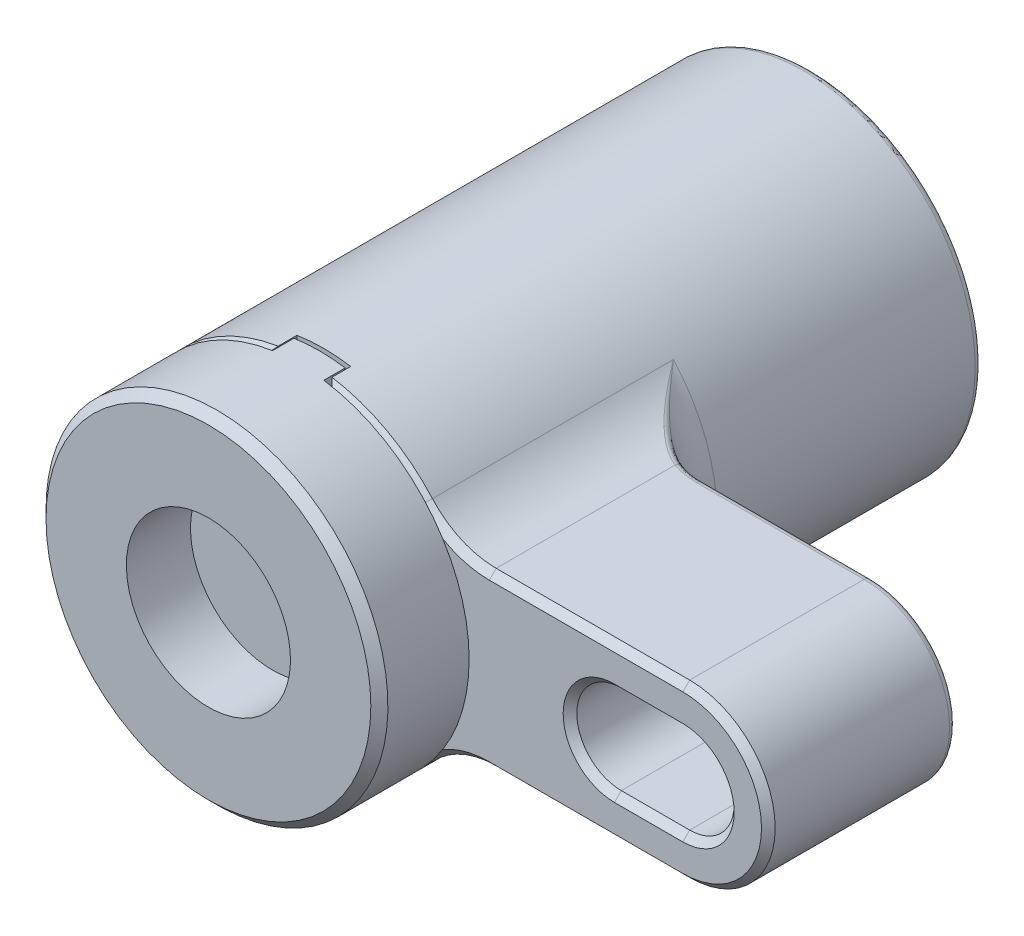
ISO-10303-21;
HEADER;
FILE_DESCRIPTION(('STEP AP214'),'2;1');
FILE_NAME('part.step','',(''),(''),'','','');
FILE_SCHEMA(('AUTOMOTIVE_DESIGN { 1 0 10303 214 1 1 1 1 }'));
ENDSEC;
DATA;
#1=APPLICATION_CONTEXT('core data for automotive mechanical design processes');
#2=APPLICATION_PROTOCOL_DEFINITION('international standard','automotive_design',2000,#1);
#3=PRODUCT_CONTEXT('',#1,'mechanical');
#4=PRODUCT('Part','Part','',(#3));
#5=PRODUCT_RELATED_PRODUCT_CATEGORY('part','',(#4));
#6=PRODUCT_DEFINITION_FORMATION('','',#4);
#7=PRODUCT_DEFINITION_CONTEXT('part definition',#1,'design');
#8=PRODUCT_DEFINITION('design','',#6,#7);
#9=PRODUCT_DEFINITION_SHAPE('','',#8);
#10=(LENGTH_UNIT() NAMED_UNIT(*) SI_UNIT(.MILLI.,.METRE.));
#11=(NAMED_UNIT(*) PLANE_ANGLE_UNIT() SI_UNIT($,.RADIAN.));
#12=(NAMED_UNIT(*) SI_UNIT($,.STERADIAN.) SOLID_ANGLE_UNIT());
#13=UNCERTAINTY_MEASURE_WITH_UNIT(LENGTH_MEASURE(1.E-05),#10,'distance_accuracy_value','');
#14=(GEOMETRIC_REPRESENTATION_CONTEXT(3) GLOBAL_UNCERTAINTY_ASSIGNED_CONTEXT((#13)) GLOBAL_UNIT_ASSIGNED_CONTEXT((#10,
#11,#12)) REPRESENTATION_CONTEXT('',''));
#15=CARTESIAN_POINT('',(0.,0.,0.));
#16=DIRECTION('',(0.,0.,1.));
#17=DIRECTION('',(1.,0.,0.));
#18=AXIS2_PLACEMENT_3D('',#15,#16,#17);
#19=CARTESIAN_POINT('',(3.14999999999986,-19.7503797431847,57.));
#20=DIRECTION('',(1.,0.,0.));
#21=DIRECTION('',(0.,1.,0.));
#22=AXIS2_PLACEMENT_3D('',#19,#20,#21);
#23=PLANE('',#22);
#24=DIRECTION('',(0.,0.,-1.));
#25=VECTOR('',#24,1.);
#26=CARTESIAN_POINT('',(3.14999999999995,-6.88187363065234,20.0377427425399));
#27=LINE('',#26,#25);
#28=CARTESIAN_POINT('',(3.14999999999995,-6.88187363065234,57.));
#29=VERTEX_POINT('',#28);
#30=CARTESIAN_POINT('',(3.14999999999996,-6.88187363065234,59.2));
#31=VERTEX_POINT('',#30);
#32=EDGE_CURVE('E1770',#29,#31,#27,.F.);
#33=ORIENTED_EDGE('',*,*,#32,.F.);
#34=DIRECTION('',(0.,1.,0.));
#35=VECTOR('',#34,1.);
#36=CARTESIAN_POINT('',(3.14999999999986,-19.7503797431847,57.));
#37=LINE('',#36,#35);
#38=CARTESIAN_POINT('',(3.14999999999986,-19.7503797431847,57.));
#39=VERTEX_POINT('',#38);
#40=EDGE_CURVE('E1969',#39,#29,#37,.T.);
#41=ORIENTED_EDGE('',*,*,#40,.F.);
#42=DIRECTION('',(0.,0.,1.));
#43=VECTOR('',#42,1.);
#44=CARTESIAN_POINT('',(3.14999999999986,-19.7503797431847,57.));
#45=LINE('',#44,#43);
#46=CARTESIAN_POINT('',(3.14999999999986,-19.7503797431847,59.2));
#47=VERTEX_POINT('',#46);
#48=EDGE_CURVE('E1968',#39,#47,#45,.T.);
#49=ORIENTED_EDGE('',*,*,#48,.T.);
#50=DIRECTION('',(0.,1.,0.));
#51=VECTOR('',#50,1.);
#52=CARTESIAN_POINT('',(3.14999999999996,-5.96992462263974,59.2));
#53=LINE('',#52,#51);
#54=EDGE_CURVE('E394',#47,#31,#53,.T.);
#55=ORIENTED_EDGE('',*,*,#54,.T.);
#56=EDGE_LOOP('',(#33,#41,#49,#55));
#57=FACE_BOUND('',#56,.T.);
#58=ADVANCED_FACE('F14',(#57),#23,.F.);
#59=CARTESIAN_POINT('',(-3.15000000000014,-19.7503797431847,57.));
#60=DIRECTION('',(-1.,0.,0.));
#61=DIRECTION('',(0.,-1.,0.));
#62=AXIS2_PLACEMENT_3D('',#59,#60,#61);
#63=PLANE('',#62);
#64=DIRECTION('',(0.,0.,-1.));
#65=VECTOR('',#64,1.);
#66=CARTESIAN_POINT('',(-3.15000000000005,-6.8818736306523,20.0377427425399));
#67=LINE('',#66,#65);
#68=CARTESIAN_POINT('',(-3.15000000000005,-6.8818736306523,59.2));
#69=VERTEX_POINT('',#68);
#70=CARTESIAN_POINT('',(-3.15000000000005,-6.8818736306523,57.));
#71=VERTEX_POINT('',#70);
#72=EDGE_CURVE('E1781',#69,#71,#67,.T.);
#73=ORIENTED_EDGE('',*,*,#72,.F.);
#74=DIRECTION('',(0.,-1.,0.));
#75=VECTOR('',#74,1.);
#76=CARTESIAN_POINT('',(-3.15000000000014,-19.7503797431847,59.2));
#77=LINE('',#76,#75);
#78=CARTESIAN_POINT('',(-3.15000000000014,-19.7503797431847,59.2));
#79=VERTEX_POINT('',#78);
#80=EDGE_CURVE('E396',#69,#79,#77,.T.);
#81=ORIENTED_EDGE('',*,*,#80,.T.);
#82=DIRECTION('',(0.,0.,1.));
#83=VECTOR('',#82,1.);
#84=CARTESIAN_POINT('',(-3.15000000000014,-19.7503797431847,57.));
#85=LINE('',#84,#83);
#86=CARTESIAN_POINT('',(-3.15000000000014,-19.7503797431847,57.));
#87=VERTEX_POINT('',#86);
#88=EDGE_CURVE('E1966',#87,#79,#85,.T.);
#89=ORIENTED_EDGE('',*,*,#88,.F.);
#90=DIRECTION('',(0.,-1.,0.));
#91=VECTOR('',#90,1.);
#92=CARTESIAN_POINT('',(-3.15000000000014,-19.7503797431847,57.));
#93=LINE('',#92,#91);
#94=EDGE_CURVE('E1103',#71,#87,#93,.T.);
#95=ORIENTED_EDGE('',*,*,#94,.F.);
#96=EDGE_LOOP('',(#73,#81,#89,#95));
#97=FACE_BOUND('',#96,.T.);
#98=ADVANCED_FACE('F1235',(#97),#63,.F.);
#99=CARTESIAN_POINT('',(-3.15,19.7503797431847,57.));
#100=DIRECTION('',(-1.,0.,0.));
#101=DIRECTION('',(0.,-1.,0.));
#102=AXIS2_PLACEMENT_3D('',#99,#100,#101);
#103=PLANE('',#102);
#104=DIRECTION('',(0.,0.,-1.));
#105=VECTOR('',#104,1.);
#106=CARTESIAN_POINT('',(-3.15,6.88187363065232,20.0377427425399));
#107=LINE('',#106,#105);
#108=CARTESIAN_POINT('',(-3.15,6.88187363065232,57.));
#109=VERTEX_POINT('',#108);
#110=CARTESIAN_POINT('',(-3.15,6.88187363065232,59.2));
#111=VERTEX_POINT('',#110);
#112=EDGE_CURVE('E1755',#109,#111,#107,.F.);
#113=ORIENTED_EDGE('',*,*,#112,.F.);
#114=DIRECTION('',(0.,-1.,0.));
#115=VECTOR('',#114,1.);
#116=CARTESIAN_POINT('',(-3.15,19.7503797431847,57.));
#117=LINE('',#116,#115);
#118=CARTESIAN_POINT('',(-3.15,19.7503797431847,57.));
#119=VERTEX_POINT('',#118);
#120=EDGE_CURVE('E1128',#119,#109,#117,.T.);
#121=ORIENTED_EDGE('',*,*,#120,.F.);
#122=DIRECTION('',(0.,0.,1.));
#123=VECTOR('',#122,1.);
#124=CARTESIAN_POINT('',(-3.15,19.7503797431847,57.));
#125=LINE('',#124,#123);
#126=CARTESIAN_POINT('',(-3.15,19.7503797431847,59.2));
#127=VERTEX_POINT('',#126);
#128=EDGE_CURVE('E1127',#119,#127,#125,.T.);
#129=ORIENTED_EDGE('',*,*,#128,.T.);
#130=DIRECTION('',(0.,-1.,0.));
#131=VECTOR('',#130,1.);
#132=CARTESIAN_POINT('',(-3.15,5.96992462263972,59.2));
#133=LINE('',#132,#131);
#134=EDGE_CURVE('E409',#127,#111,#133,.T.);
#135=ORIENTED_EDGE('',*,*,#134,.T.);
#136=EDGE_LOOP('',(#113,#121,#129,#135));
#137=FACE_BOUND('',#136,.T.);
#138=ADVANCED_FACE('F1241',(#137),#103,.F.);
#139=CARTESIAN_POINT('',(3.15,19.7503797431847,57.));
#140=DIRECTION('',(1.,0.,0.));
#141=DIRECTION('',(0.,1.,0.));
#142=AXIS2_PLACEMENT_3D('',#139,#140,#141);
#143=PLANE('',#142);
#144=DIRECTION('',(0.,0.,-1.));
#145=VECTOR('',#144,1.);
#146=CARTESIAN_POINT('',(3.15,6.88187363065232,20.0377427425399));
#147=LINE('',#146,#145);
#148=CARTESIAN_POINT('',(3.15,6.88187363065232,59.2));
#149=VERTEX_POINT('',#148);
#150=CARTESIAN_POINT('',(3.15,6.88187363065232,57.));
#151=VERTEX_POINT('',#150);
#152=EDGE_CURVE('E386',#149,#151,#147,.T.);
#153=ORIENTED_EDGE('',*,*,#152,.F.);
#154=DIRECTION('',(0.,1.,0.));
#155=VECTOR('',#154,1.);
#156=CARTESIAN_POINT('',(3.15,19.7503797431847,59.2));
#157=LINE('',#156,#155);
#158=CARTESIAN_POINT('',(3.15,19.7503797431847,59.2));
#159=VERTEX_POINT('',#158);
#160=EDGE_CURVE('E385',#149,#159,#157,.T.);
#161=ORIENTED_EDGE('',*,*,#160,.T.);
#162=DIRECTION('',(0.,0.,1.));
#163=VECTOR('',#162,1.);
#164=CARTESIAN_POINT('',(3.15,19.7503797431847,57.));
#165=LINE('',#164,#163);
#166=CARTESIAN_POINT('',(3.15,19.7503797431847,57.));
#167=VERTEX_POINT('',#166);
#168=EDGE_CURVE('E1122',#167,#159,#165,.T.);
#169=ORIENTED_EDGE('',*,*,#168,.F.);
#170=DIRECTION('',(0.,1.,0.));
#171=VECTOR('',#170,1.);
#172=CARTESIAN_POINT('',(3.15,19.7503797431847,57.));
#173=LINE('',#172,#171);
#174=EDGE_CURVE('E1978',#151,#167,#173,.T.);
#175=ORIENTED_EDGE('',*,*,#174,.F.);
#176=EDGE_LOOP('',(#153,#161,#169,#175));
#177=FACE_BOUND('',#176,.T.);
#178=ADVANCED_FACE('F1252',(#177),#143,.F.);
#179=CARTESIAN_POINT('',(3.,19.7737199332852,57.5));
#180=DIRECTION('',(-1.,0.,0.));
#181=DIRECTION('',(0.,-1.,0.));
#182=AXIS2_PLACEMENT_3D('',#179,#180,#181);
#183=PLANE('',#182);
#184=DIRECTION('',(0.,0.,-1.));
#185=VECTOR('',#184,1.);
#186=CARTESIAN_POINT('',(3.,6.94857429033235,20.0377427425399));
#187=LINE('',#186,#185);
#188=CARTESIAN_POINT('',(3.,6.94857429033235,57.5));
#189=VERTEX_POINT('',#188);
#190=CARTESIAN_POINT('',(3.,6.94857429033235,60.));
#191=VERTEX_POINT('',#190);
#192=EDGE_CURVE('E37',#189,#191,#187,.F.);
#193=ORIENTED_EDGE('',*,*,#192,.F.);
#194=DIRECTION('',(0.,-1.,0.));
#195=VECTOR('',#194,1.);
#196=CARTESIAN_POINT('',(3.,19.7737199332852,57.5));
#197=LINE('',#196,#195);
#198=CARTESIAN_POINT('',(3.,19.7737199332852,57.5));
#199=VERTEX_POINT('',#198);
#200=EDGE_CURVE('E765',#199,#189,#197,.T.);
#201=ORIENTED_EDGE('',*,*,#200,.F.);
#202=DIRECTION('',(0.,0.,1.));
#203=VECTOR('',#202,1.);
#204=CARTESIAN_POINT('',(3.,19.7737199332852,57.5));
#205=LINE('',#204,#203);
#206=CARTESIAN_POINT('',(3.,19.7737199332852,60.));
#207=VERTEX_POINT('',#206);
#208=EDGE_CURVE('E798',#199,#207,#205,.T.);
#209=ORIENTED_EDGE('',*,*,#208,.T.);
#210=DIRECTION('',(0.,-1.,0.));
#211=VECTOR('',#210,1.);
#212=CARTESIAN_POINT('',(3.,19.7737199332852,60.));
#213=LINE('',#212,#211);
#214=EDGE_CURVE('E781',#207,#191,#213,.T.);
#215=ORIENTED_EDGE('',*,*,#214,.T.);
#216=EDGE_LOOP('',(#193,#201,#209,#215));
#217=FACE_BOUND('',#216,.T.);
#218=ADVANCED_FACE('F796',(#217),#183,.F.);
#219=DIRECTION('',(0.,0.,-1.));
#220=VECTOR('',#219,1.);
#221=CARTESIAN_POINT('',(3.,-6.94857429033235,20.0377427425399));
#222=LINE('',#221,#220);
#223=CARTESIAN_POINT('',(3.,-6.94857429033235,60.));
#224=VERTEX_POINT('',#223);
#225=CARTESIAN_POINT('',(3.,-6.94857429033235,57.5));
#226=VERTEX_POINT('',#225);
#227=EDGE_CURVE('E847',#224,#226,#222,.T.);
#228=ORIENTED_EDGE('',*,*,#227,.F.);
#229=CARTESIAN_POINT('',(3.,-19.7737199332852,60.));
#230=VERTEX_POINT('',#229);
#231=EDGE_CURVE('E758',#224,#230,#213,.T.);
#232=ORIENTED_EDGE('',*,*,#231,.T.);
#233=DIRECTION('',(0.,0.,1.));
#234=VECTOR('',#233,1.);
#235=CARTESIAN_POINT('',(3.,-19.7737199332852,57.5));
#236=LINE('',#235,#234);
#237=CARTESIAN_POINT('',(3.,-19.7737199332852,57.5));
#238=VERTEX_POINT('',#237);
#239=EDGE_CURVE('E828',#238,#230,#236,.T.);
#240=ORIENTED_EDGE('',*,*,#239,.F.);
#241=EDGE_CURVE('E763',#226,#238,#197,.T.);
#242=ORIENTED_EDGE('',*,*,#241,.F.);
#243=EDGE_LOOP('',(#228,#232,#240,#242));
#244=FACE_BOUND('',#243,.T.);
#245=ADVANCED_FACE('F845',(#244),#183,.F.);
#246=CARTESIAN_POINT('',(-3.,19.7737199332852,57.5));
#247=DIRECTION('',(1.,0.,0.));
#248=DIRECTION('',(0.,1.,0.));
#249=AXIS2_PLACEMENT_3D('',#246,#247,#248);
#250=PLANE('',#249);
#251=DIRECTION('',(0.,0.,-1.));
#252=VECTOR('',#251,1.);
#253=CARTESIAN_POINT('',(-3.,6.94857429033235,20.0377427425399));
#254=LINE('',#253,#252);
#255=CARTESIAN_POINT('',(-3.,6.94857429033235,60.));
#256=VERTEX_POINT('',#255);
#257=CARTESIAN_POINT('',(-3.,6.94857429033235,57.5));
#258=VERTEX_POINT('',#257);
#259=EDGE_CURVE('E1754',#256,#258,#254,.T.);
#260=ORIENTED_EDGE('',*,*,#259,.F.);
#261=DIRECTION('',(0.,1.,0.));
#262=VECTOR('',#261,1.);
#263=CARTESIAN_POINT('',(-3.,19.7737199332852,60.));
#264=LINE('',#263,#262);
#265=CARTESIAN_POINT('',(-3.,19.7737199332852,60.));
#266=VERTEX_POINT('',#265);
#267=EDGE_CURVE('E786',#256,#266,#264,.T.);
#268=ORIENTED_EDGE('',*,*,#267,.T.);
#269=DIRECTION('',(0.,0.,1.));
#270=VECTOR('',#269,1.);
#271=CARTESIAN_POINT('',(-3.,19.7737199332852,57.5));
#272=LINE('',#271,#270);
#273=CARTESIAN_POINT('',(-3.,19.7737199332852,57.5));
#274=VERTEX_POINT('',#273);
#275=EDGE_CURVE('E774',#274,#266,#272,.T.);
#276=ORIENTED_EDGE('',*,*,#275,.F.);
#277=DIRECTION('',(0.,1.,0.));
#278=VECTOR('',#277,1.);
#279=CARTESIAN_POINT('',(-3.,19.7737199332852,57.5));
#280=LINE('',#279,#278);
#281=EDGE_CURVE('E770',#258,#274,#280,.T.);
#282=ORIENTED_EDGE('',*,*,#281,.F.);
#283=EDGE_LOOP('',(#260,#268,#276,#282));
#284=FACE_BOUND('',#283,.T.);
#285=ADVANCED_FACE('F1722',(#284),#250,.F.);
#286=DIRECTION('',(0.,0.,-1.));
#287=VECTOR('',#286,1.);
#288=CARTESIAN_POINT('',(-3.,-6.94857429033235,20.0377427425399));
#289=LINE('',#288,#287);
#290=CARTESIAN_POINT('',(-3.,-6.94857429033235,57.5));
#291=VERTEX_POINT('',#290);
#292=CARTESIAN_POINT('',(-3.,-6.94857429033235,60.));
#293=VERTEX_POINT('',#292);
#294=EDGE_CURVE('E1766',#291,#293,#289,.F.);
#295=ORIENTED_EDGE('',*,*,#294,.F.);
#296=CARTESIAN_POINT('',(-3.,-19.7737199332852,57.5));
#297=VERTEX_POINT('',#296);
#298=EDGE_CURVE('E771',#297,#291,#280,.T.);
#299=ORIENTED_EDGE('',*,*,#298,.F.);
#300=DIRECTION('',(0.,0.,1.));
#301=VECTOR('',#300,1.);
#302=CARTESIAN_POINT('',(-3.,-19.7737199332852,57.5));
#303=LINE('',#302,#301);
#304=CARTESIAN_POINT('',(-3.,-19.7737199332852,60.));
#305=VERTEX_POINT('',#304);
#306=EDGE_CURVE('E825',#297,#305,#303,.T.);
#307=ORIENTED_EDGE('',*,*,#306,.T.);
#308=EDGE_CURVE('E764',#305,#293,#264,.T.);
#309=ORIENTED_EDGE('',*,*,#308,.T.);
#310=EDGE_LOOP('',(#295,#299,#307,#309));
#311=FACE_BOUND('',#310,.T.);
#312=ADVANCED_FACE('F1725',(#311),#250,.F.);
#313=CARTESIAN_POINT('',(0.,0.,60.));
#314=DIRECTION('',(0.,0.,-1.));
#315=DIRECTION('',(0.,-1.,0.));
#316=AXIS2_PLACEMENT_3D('',#313,#314,#315);
#317=CYLINDRICAL_SURFACE('',#316,20.);
#318=CARTESIAN_POINT('',(0.,0.,47.25));
#319=DIRECTION('',(0.,0.,-1.));
#320=DIRECTION('',(0.,-1.,0.));
#321=AXIS2_PLACEMENT_3D('',#318,#319,#320);
#322=CIRCLE('',#321,20.);
#323=CARTESIAN_POINT('',(-19.9436706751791,-1.5,47.25));
#324=VERTEX_POINT('',#323);
#325=CARTESIAN_POINT('',(-19.0787840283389,6.,47.25));
#326=VERTEX_POINT('',#325);
#327=EDGE_CURVE('E820',#324,#326,#322,.T.);
#328=ORIENTED_EDGE('',*,*,#327,.F.);
#329=DIRECTION('',(0.,0.,-1.));
#330=VECTOR('',#329,1.);
#331=CARTESIAN_POINT('',(-19.9436706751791,-1.5,60.));
#332=LINE('',#331,#330);
#333=CARTESIAN_POINT('',(-19.9436706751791,-1.5,46.25));
#334=VERTEX_POINT('',#333);
#335=EDGE_CURVE('E1812',#324,#334,#332,.T.);
#336=ORIENTED_EDGE('',*,*,#335,.T.);
#337=CARTESIAN_POINT('',(-18.9940275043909,-6.26313972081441,49.));
#338=CARTESIAN_POINT('',(-19.3758491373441,-5.10501653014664,48.3313572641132));
#339=CARTESIAN_POINT('',(-19.6139735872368,-3.91050381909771,47.6417050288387));
#340=CARTESIAN_POINT('',(-19.8521907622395,-2.71552596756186,46.9517842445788));
#341=CARTESIAN_POINT('',(-19.9436706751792,-1.5,46.25));
#342=B_SPLINE_CURVE_WITH_KNOTS('',2,(#337,#338,#339,#340,#341),.UNSPECIFIED.,.F.,.F.,(3,2,3),
(0.,0.5,1.),.UNSPECIFIED.);
#343=CARTESIAN_POINT('',(-18.9940275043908,-6.2631397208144,49.));
#344=VERTEX_POINT('',#343);
#345=EDGE_CURVE('E2012',#344,#334,#342,.T.);
#346=ORIENTED_EDGE('',*,*,#345,.F.);
#347=CARTESIAN_POINT('',(-19.9436706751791,-1.5,51.75));
#348=CARTESIAN_POINT('',(-19.8521549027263,-2.71600244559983,51.0479406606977));
#349=CARTESIAN_POINT('',(-19.6139735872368,-3.91050381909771,50.3582949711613));
#350=CARTESIAN_POINT('',(-19.3756995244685,-5.10547032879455,49.6683807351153));
#351=CARTESIAN_POINT('',(-18.9940275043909,-6.26313972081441,49.));
#352=B_SPLINE_CURVE_WITH_KNOTS('',2,(#347,#348,#349,#350,#351),.UNSPECIFIED.,.F.,.F.,(3,2,3),
(0.,0.5,1.),.UNSPECIFIED.);
#353=CARTESIAN_POINT('',(-19.9436706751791,-1.5,51.75));
#354=VERTEX_POINT('',#353);
#355=EDGE_CURVE('E1824',#354,#344,#352,.T.);
#356=ORIENTED_EDGE('',*,*,#355,.F.);
#357=DIRECTION('',(0.,0.,-1.));
#358=VECTOR('',#357,1.);
#359=CARTESIAN_POINT('',(-19.9436706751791,-1.5,60.));
#360=LINE('',#359,#358);
#361=CARTESIAN_POINT('',(-19.9436706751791,-1.5,50.75));
#362=VERTEX_POINT('',#361);
#363=EDGE_CURVE('E1829',#354,#362,#360,.T.);
#364=ORIENTED_EDGE('',*,*,#363,.T.);
#365=CARTESIAN_POINT('',(0.,0.,50.75));
#366=DIRECTION('',(0.,0.,1.));
#367=DIRECTION('',(0.,1.,0.));
#368=AXIS2_PLACEMENT_3D('',#365,#366,#367);
#369=CIRCLE('',#368,20.);
#370=CARTESIAN_POINT('',(-19.0787840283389,6.,50.75));
#371=VERTEX_POINT('',#370);
#372=EDGE_CURVE('E1890',#371,#362,#369,.T.);
#373=ORIENTED_EDGE('',*,*,#372,.F.);
#374=DIRECTION('',(0.,0.,-1.));
#375=VECTOR('',#374,1.);
#376=CARTESIAN_POINT('',(-19.0787840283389,6.,60.));
#377=LINE('',#376,#375);
#378=EDGE_CURVE('E1901',#371,#326,#377,.T.);
#379=ORIENTED_EDGE('',*,*,#378,.T.);
#380=EDGE_LOOP('',(#328,#336,#346,#356,#364,#373,#379));
#381=FACE_BOUND('',#380,.T.);
#382=ADVANCED_FACE('F1739',(#381),#317,.T.);
#383=CARTESIAN_POINT('',(-19.6436706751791,-1.5,60.));
#384=DIRECTION('',(0.,1.,0.));
#385=DIRECTION('',(-1.,0.,0.));
#386=AXIS2_PLACEMENT_3D('',#383,#384,#385);
#387=PLANE('',#386);
#388=ORIENTED_EDGE('',*,*,#363,.F.);
#389=DIRECTION('',(-1.,0.,0.));
#390=VECTOR('',#389,1.);
#391=CARTESIAN_POINT('',(-19.6436706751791,-1.5,51.75));
#392=LINE('',#391,#390);
#393=CARTESIAN_POINT('',(-19.6436706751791,-1.5,51.75));
#394=VERTEX_POINT('',#393);
#395=EDGE_CURVE('E1831',#394,#354,#392,.T.);
#396=ORIENTED_EDGE('',*,*,#395,.F.);
#397=DIRECTION('',(0.,0.,-1.));
#398=VECTOR('',#397,1.);
#399=CARTESIAN_POINT('',(-19.6436706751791,-1.5,60.));
#400=LINE('',#399,#398);
#401=CARTESIAN_POINT('',(-19.6436706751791,-1.5,50.75));
#402=VERTEX_POINT('',#401);
#403=EDGE_CURVE('E1872',#394,#402,#400,.T.);
#404=ORIENTED_EDGE('',*,*,#403,.T.);
#405=DIRECTION('',(-1.,0.,0.));
#406=VECTOR('',#405,1.);
#407=CARTESIAN_POINT('',(-19.6436706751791,-1.5,50.75));
#408=LINE('',#407,#406);
#409=EDGE_CURVE('E1832',#402,#362,#408,.T.);
#410=ORIENTED_EDGE('',*,*,#409,.T.);
#411=EDGE_LOOP('',(#388,#396,#404,#410));
#412=FACE_BOUND('',#411,.T.);
#413=ADVANCED_FACE('F1800',(#412),#387,.T.);
#414=CARTESIAN_POINT('',(-19.6436706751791,-1.5,50.75));
#415=DIRECTION('',(0.,0.,-1.));
#416=DIRECTION('',(0.,-1.,0.));
#417=AXIS2_PLACEMENT_3D('',#414,#415,#416);
#418=PLANE('',#417);
#419=ORIENTED_EDGE('',*,*,#372,.T.);
#420=ORIENTED_EDGE('',*,*,#409,.F.);
#421=CARTESIAN_POINT('',(0.3,0.,50.75));
#422=DIRECTION('',(0.,0.,1.));
#423=DIRECTION('',(0.,1.,0.));
#424=AXIS2_PLACEMENT_3D('',#421,#422,#423);
#425=CIRCLE('',#424,20.);
#426=CARTESIAN_POINT('',(-18.7787840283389,6.,50.75));
#427=VERTEX_POINT('',#426);
#428=EDGE_CURVE('E1885',#427,#402,#425,.T.);
#429=ORIENTED_EDGE('',*,*,#428,.F.);
#430=DIRECTION('',(-1.,0.,0.));
#431=VECTOR('',#430,1.);
#432=CARTESIAN_POINT('',(-18.7787840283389,6.,50.75));
#433=LINE('',#432,#431);
#434=EDGE_CURVE('E1899',#427,#371,#433,.T.);
#435=ORIENTED_EDGE('',*,*,#434,.T.);
#436=EDGE_LOOP('',(#419,#420,#429,#435));
#437=FACE_BOUND('',#436,.T.);
#438=ADVANCED_FACE('F1937',(#437),#418,.F.);
#439=CARTESIAN_POINT('',(-18.7787840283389,6.,60.));
#440=DIRECTION('',(0.,1.,0.));
#441=DIRECTION('',(-1.,0.,0.));
#442=AXIS2_PLACEMENT_3D('',#439,#440,#441);
#443=PLANE('',#442);
#444=ORIENTED_EDGE('',*,*,#378,.F.);
#445=ORIENTED_EDGE('',*,*,#434,.F.);
#446=DIRECTION('',(0.,0.,-1.));
#447=VECTOR('',#446,1.);
#448=CARTESIAN_POINT('',(-18.7787840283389,6.,60.));
#449=LINE('',#448,#447);
#450=CARTESIAN_POINT('',(-18.7787840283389,6.,47.25));
#451=VERTEX_POINT('',#450);
#452=EDGE_CURVE('E1887',#427,#451,#449,.T.);
#453=ORIENTED_EDGE('',*,*,#452,.T.);
#454=DIRECTION('',(-1.,0.,0.));
#455=VECTOR('',#454,1.);
#456=CARTESIAN_POINT('',(-18.7787840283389,6.,47.25));
#457=LINE('',#456,#455);
#458=EDGE_CURVE('E1909',#451,#326,#457,.T.);
#459=ORIENTED_EDGE('',*,*,#458,.T.);
#460=EDGE_LOOP('',(#444,#445,#453,#459));
#461=FACE_BOUND('',#460,.T.);
#462=ADVANCED_FACE('F1936',(#461),#443,.T.);
#463=CARTESIAN_POINT('',(-18.7787840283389,6.,47.25));
#464=DIRECTION('',(0.,0.,1.));
#465=DIRECTION('',(0.,1.,0.));
#466=AXIS2_PLACEMENT_3D('',#463,#464,#465);
#467=PLANE('',#466);
#468=ORIENTED_EDGE('',*,*,#327,.T.);
#469=ORIENTED_EDGE('',*,*,#458,.F.);
#470=CARTESIAN_POINT('',(0.3,0.,47.25));
#471=DIRECTION('',(0.,0.,-1.));
#472=DIRECTION('',(0.,-1.,0.));
#473=AXIS2_PLACEMENT_3D('',#470,#471,#472);
#474=CIRCLE('',#473,20.);
#475=CARTESIAN_POINT('',(-19.6436706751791,-1.5,47.25));
#476=VERTEX_POINT('',#475);
#477=EDGE_CURVE('E1914',#476,#451,#474,.T.);
#478=ORIENTED_EDGE('',*,*,#477,.F.);
#479=DIRECTION('',(-1.,0.,0.));
#480=VECTOR('',#479,1.);
#481=CARTESIAN_POINT('',(-19.6436706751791,-1.5,47.25));
#482=LINE('',#481,#480);
#483=EDGE_CURVE('E1918',#476,#324,#482,.T.);
#484=ORIENTED_EDGE('',*,*,#483,.T.);
#485=EDGE_LOOP('',(#468,#469,#478,#484));
#486=FACE_BOUND('',#485,.T.);
#487=ADVANCED_FACE('F1929',(#486),#467,.F.);
#488=CARTESIAN_POINT('',(-19.6436706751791,-1.5,60.));
#489=DIRECTION('',(0.,1.,0.));
#490=DIRECTION('',(-1.,0.,0.));
#491=AXIS2_PLACEMENT_3D('',#488,#489,#490);
#492=PLANE('',#491);
#493=ORIENTED_EDGE('',*,*,#335,.F.);
#494=ORIENTED_EDGE('',*,*,#483,.F.);
#495=DIRECTION('',(0.,0.,-1.));
#496=VECTOR('',#495,1.);
#497=CARTESIAN_POINT('',(-19.6436706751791,-1.5,60.));
#498=LINE('',#497,#496);
#499=CARTESIAN_POINT('',(-19.6436706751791,-1.5,46.25));
#500=VERTEX_POINT('',#499);
#501=EDGE_CURVE('E1789',#476,#500,#498,.T.);
#502=ORIENTED_EDGE('',*,*,#501,.T.);
#503=DIRECTION('',(-1.,0.,0.));
#504=VECTOR('',#503,1.);
#505=CARTESIAN_POINT('',(-19.6436706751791,-1.5,46.25));
#506=LINE('',#505,#504);
#507=EDGE_CURVE('E2009',#500,#334,#506,.T.);
#508=ORIENTED_EDGE('',*,*,#507,.T.);
#509=EDGE_LOOP('',(#493,#494,#502,#508));
#510=FACE_BOUND('',#509,.T.);
#511=ADVANCED_FACE('F1802',(#510),#492,.T.);
#512=CARTESIAN_POINT('',(-19.6436706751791,-1.5,46.25));
#513=DIRECTION('',(0.,0.5,0.866025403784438));
#514=DIRECTION('',(0.,0.866025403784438,-0.5));
#515=AXIS2_PLACEMENT_3D('',#512,#513,#514);
#516=PLANE('',#515);
#517=ORIENTED_EDGE('',*,*,#345,.T.);
#518=ORIENTED_EDGE('',*,*,#507,.F.);
#519=CARTESIAN_POINT('',(-18.6940275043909,-6.26313972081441,49.));
#520=CARTESIAN_POINT('',(-18.7539544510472,-6.08140094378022,48.8950685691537));
#521=CARTESIAN_POINT('',(-18.8112067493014,-5.89900350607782,48.7897516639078));
#522=CARTESIAN_POINT('',(-18.9227055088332,-5.52514803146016,48.5738878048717));
#523=CARTESIAN_POINT('',(-18.9767171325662,-5.3336374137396,48.4633105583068));
#524=CARTESIAN_POINT('',(-19.0810240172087,-4.94153247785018,48.2369266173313));
#525=CARTESIAN_POINT('',(-19.1310744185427,-4.74088904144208,48.1210921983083));
#526=CARTESIAN_POINT('',(-19.2267163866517,-4.33052773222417,47.8841940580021));
#527=CARTESIAN_POINT('',(-19.2720530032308,-4.12076506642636,47.7631048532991));
#528=CARTESIAN_POINT('',(-19.3492496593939,-3.73356947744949,47.5395473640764));
#529=CARTESIAN_POINT('',(-19.3821067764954,-3.55628208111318,47.4371697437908));
#530=CARTESIAN_POINT('',(-19.4455661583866,-3.18603501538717,47.2233699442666));
#531=CARTESIAN_POINT('',(-19.4757415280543,-2.99302012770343,47.1119163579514));
#532=CARTESIAN_POINT('',(-19.5325391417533,-2.59127344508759,46.8799651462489));
#533=CARTESIAN_POINT('',(-19.5586997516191,-2.38249160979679,46.7594410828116));
#534=CARTESIAN_POINT('',(-19.6060631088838,-1.94923637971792,46.509339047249));
#535=CARTESIAN_POINT('',(-19.6267693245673,-1.72472205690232,46.379737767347));
#536=CARTESIAN_POINT('',(-19.6436706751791,-1.5,46.25));
#537=B_SPLINE_CURVE_WITH_KNOTS('',3,(#519,#520,#521,#522,#523,#524,#525,#526,#527,#528,#529,
#530,#531,#532,#533,#534,#535,#536),.UNSPECIFIED.,.F.,.F.,(4,2,2,2,2,2,2,2,4),(0.,
0.65471650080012,1.33756326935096,2.04854867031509,2.78768008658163,3.40965742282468,
4.08433128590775,4.81170346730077,5.5917752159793),.UNSPECIFIED.);
#538=CARTESIAN_POINT('',(-18.6940275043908,-6.2631397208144,49.));
#539=VERTEX_POINT('',#538);
#540=EDGE_CURVE('E2010',#539,#500,#537,.T.);
#541=ORIENTED_EDGE('',*,*,#540,.F.);
#542=DIRECTION('',(-1.,0.,0.));
#543=VECTOR('',#542,1.);
#544=CARTESIAN_POINT('',(-18.6940275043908,-6.26313972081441,49.));
#545=LINE('',#544,#543);
#546=EDGE_CURVE('E1878',#539,#344,#545,.T.);
#547=ORIENTED_EDGE('',*,*,#546,.T.);
#548=EDGE_LOOP('',(#517,#518,#541,#547));
#549=FACE_BOUND('',#548,.T.);
#550=ADVANCED_FACE('F1851',(#549),#516,.F.);
#551=CARTESIAN_POINT('',(-18.6940275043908,-6.26313972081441,49.));
#552=DIRECTION('',(0.,0.5,-0.866025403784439));
#553=DIRECTION('',(0.,-0.866025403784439,-0.5));
#554=AXIS2_PLACEMENT_3D('',#551,#552,#553);
#555=PLANE('',#554);
#556=ORIENTED_EDGE('',*,*,#355,.T.);
#557=ORIENTED_EDGE('',*,*,#546,.F.);
#558=CARTESIAN_POINT('',(-19.6436706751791,-1.5,51.75));
#559=CARTESIAN_POINT('',(-19.6267688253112,-1.7247286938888,51.6202584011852));
#560=CARTESIAN_POINT('',(-19.6060618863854,-1.9492496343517,51.4906532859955));
#561=CARTESIAN_POINT('',(-19.5586971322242,-2.38251363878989,51.2405461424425));
#562=CARTESIAN_POINT('',(-19.532536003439,-2.59129764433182,51.1200207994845));
#563=CARTESIAN_POINT('',(-19.4757378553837,-2.99304424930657,50.8880695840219));
#564=CARTESIAN_POINT('',(-19.445562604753,-3.18605690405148,50.7766172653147));
#565=CARTESIAN_POINT('',(-19.3821043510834,-3.55629516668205,50.5628225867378));
#566=CARTESIAN_POINT('',(-19.3492483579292,-3.73357600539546,50.4604488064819));
#567=CARTESIAN_POINT('',(-19.2720521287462,-4.12076945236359,50.2368926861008));
#568=CARTESIAN_POINT('',(-19.2267144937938,-4.3305364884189,50.1158010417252));
#569=CARTESIAN_POINT('',(-19.1310708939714,-4.74090355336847,49.8788996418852));
#570=CARTESIAN_POINT('',(-19.0810199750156,-4.94154839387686,49.7630643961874));
#571=CARTESIAN_POINT('',(-18.9767127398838,-5.33365323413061,49.5366804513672));
#572=CARTESIAN_POINT('',(-18.9227013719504,-5.52516237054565,49.426104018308));
#573=CARTESIAN_POINT('',(-18.8112040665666,-5.89901205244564,49.2102434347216));
#574=CARTESIAN_POINT('',(-18.7539530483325,-6.08140519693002,49.1049289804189));
#575=CARTESIAN_POINT('',(-18.6940275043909,-6.26313972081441,49.));
#576=B_SPLINE_CURVE_WITH_KNOTS('',3,(#558,#559,#560,#561,#562,#563,#564,#565,#566,#567,#568,
#569,#570,#571,#572,#573,#574,#575),.UNSPECIFIED.,.F.,.F.,(4,2,2,2,2,2,2,2,4),(0.,
0.780094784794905,1.50747464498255,2.18214082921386,2.80409512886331,3.54324185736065,
4.25423236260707,4.93707402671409,5.59177521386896),.UNSPECIFIED.);
#577=EDGE_CURVE('E744',#394,#539,#576,.T.);
#578=ORIENTED_EDGE('',*,*,#577,.F.);
#579=ORIENTED_EDGE('',*,*,#395,.T.);
#580=EDGE_LOOP('',(#556,#557,#578,#579));
#581=FACE_BOUND('',#580,.T.);
#582=ADVANCED_FACE('F982',(#581),#555,.F.);
#583=CARTESIAN_POINT('',(45.,0.,38.8));
#584=DIRECTION('',(0.,0.,1.));
#585=DIRECTION('',(0.,1.,0.));
#586=AXIS2_PLACEMENT_3D('',#583,#584,#585);
#587=TOROIDAL_SURFACE('',#586,9.2,0.8);
#588=CARTESIAN_POINT('',(45.,9.2,38.8));
#589=DIRECTION('',(1.,0.,0.));
#590=DIRECTION('',(0.,1.,0.));
#591=AXIS2_PLACEMENT_3D('',#588,#589,#590);
#592=CIRCLE('',#591,0.8);
#593=CARTESIAN_POINT('',(45.,9.2,38.));
#594=VERTEX_POINT('',#593);
#595=CARTESIAN_POINT('',(45.,10.,38.8));
#596=VERTEX_POINT('',#595);
#597=EDGE_CURVE('E1107',#594,#596,#592,.T.);
#598=ORIENTED_EDGE('',*,*,#597,.T.);
#599=CARTESIAN_POINT('',(45.,0.,38.8));
#600=DIRECTION('',(0.,0.,1.));
#601=DIRECTION('',(0.,1.,0.));
#602=AXIS2_PLACEMENT_3D('',#599,#600,#601);
#603=CIRCLE('',#602,10.);
#604=CARTESIAN_POINT('',(45.,-10.,38.8));
#605=VERTEX_POINT('',#604);
#606=EDGE_CURVE('E872',#605,#596,#603,.T.);
#607=ORIENTED_EDGE('',*,*,#606,.F.);
#608=CARTESIAN_POINT('',(45.,-9.2,38.8));
#609=DIRECTION('',(-1.,0.,0.));
#610=DIRECTION('',(0.,-1.,0.));
#611=AXIS2_PLACEMENT_3D('',#608,#609,#610);
#612=CIRCLE('',#611,0.8);
#613=CARTESIAN_POINT('',(45.,-9.2,38.));
#614=VERTEX_POINT('',#613);
#615=EDGE_CURVE('E968',#614,#605,#612,.T.);
#616=ORIENTED_EDGE('',*,*,#615,.F.);
#617=CARTESIAN_POINT('',(45.,0.,38.));
#618=DIRECTION('',(0.,0.,1.));
#619=DIRECTION('',(0.,1.,0.));
#620=AXIS2_PLACEMENT_3D('',#617,#618,#619);
#621=CIRCLE('',#620,9.2);
#622=EDGE_CURVE('E1055',#594,#614,#621,.F.);
#623=ORIENTED_EDGE('',*,*,#622,.F.);
#624=EDGE_LOOP('',(#598,#607,#616,#623));
#625=FACE_BOUND('',#624,.T.);
#626=ADVANCED_FACE('F978',(#625),#587,.T.);
#627=CARTESIAN_POINT('',(0.,-6.,38.8));
#628=DIRECTION('',(1.,0.,0.));
#629=DIRECTION('',(0.,1.,0.));
#630=AXIS2_PLACEMENT_3D('',#627,#628,#629);
#631=CYLINDRICAL_SURFACE('',#630,0.8);
#632=CARTESIAN_POINT('',(37.,-6.,38.8));
#633=DIRECTION('',(1.,0.,0.));
#634=DIRECTION('',(0.,1.,0.));
#635=AXIS2_PLACEMENT_3D('',#632,#633,#634);
#636=CIRCLE('',#635,0.8);
#637=CARTESIAN_POINT('',(37.,-6.,38.));
#638=VERTEX_POINT('',#637);
#639=CARTESIAN_POINT('',(37.,-5.2,38.8));
#640=VERTEX_POINT('',#639);
#641=EDGE_CURVE('E1191',#638,#640,#636,.T.);
#642=ORIENTED_EDGE('',*,*,#641,.T.);
#643=DIRECTION('',(1.,0.,0.));
#644=VECTOR('',#643,1.);
#645=CARTESIAN_POINT('',(37.,-5.2,38.8));
#646=LINE('',#645,#644);
#647=CARTESIAN_POINT('',(45.,-5.2,38.8));
#648=VERTEX_POINT('',#647);
#649=EDGE_CURVE('E1151',#648,#640,#646,.F.);
#650=ORIENTED_EDGE('',*,*,#649,.F.);
#651=CARTESIAN_POINT('',(45.,-6.,38.8));
#652=DIRECTION('',(-1.,0.,0.));
#653=DIRECTION('',(0.,-1.,0.));
#654=AXIS2_PLACEMENT_3D('',#651,#652,#653);
#655=CIRCLE('',#654,0.8);
#656=CARTESIAN_POINT('',(45.,-6.,38.));
#657=VERTEX_POINT('',#656);
#658=EDGE_CURVE('E530',#648,#657,#655,.T.);
#659=ORIENTED_EDGE('',*,*,#658,.T.);
#660=DIRECTION('',(1.,0.,0.));
#661=VECTOR('',#660,1.);
#662=CARTESIAN_POINT('',(0.,-6.,38.));
#663=LINE('',#662,#661);
#664=EDGE_CURVE('E1285',#638,#657,#663,.T.);
#665=ORIENTED_EDGE('',*,*,#664,.F.);
#666=EDGE_LOOP('',(#642,#650,#659,#665));
#667=FACE_BOUND('',#666,.T.);
#668=ADVANCED_FACE('F981',(#667),#631,.T.);
#669=CARTESIAN_POINT('',(45.,0.,38.8));
#670=DIRECTION('',(0.,0.,1.));
#671=DIRECTION('',(0.,1.,0.));
#672=AXIS2_PLACEMENT_3D('',#669,#670,#671);
#673=TOROIDAL_SURFACE('',#672,6.,0.8);
#674=CARTESIAN_POINT('',(45.,6.,38.8));
#675=DIRECTION('',(1.,0.,0.));
#676=DIRECTION('',(0.,1.,0.));
#677=AXIS2_PLACEMENT_3D('',#674,#675,#676);
#678=CIRCLE('',#677,0.8);
#679=CARTESIAN_POINT('',(45.,5.2,38.8));
#680=VERTEX_POINT('',#679);
#681=CARTESIAN_POINT('',(45.,6.,38.));
#682=VERTEX_POINT('',#681);
#683=EDGE_CURVE('E1193',#680,#682,#678,.T.);
#684=ORIENTED_EDGE('',*,*,#683,.T.);
#685=CARTESIAN_POINT('',(45.,0.,38.));
#686=DIRECTION('',(0.,0.,1.));
#687=DIRECTION('',(0.,1.,0.));
#688=AXIS2_PLACEMENT_3D('',#685,#686,#687);
#689=CIRCLE('',#688,6.);
#690=EDGE_CURVE('E1109',#657,#682,#689,.T.);
#691=ORIENTED_EDGE('',*,*,#690,.F.);
#692=ORIENTED_EDGE('',*,*,#658,.F.);
#693=CARTESIAN_POINT('',(45.,0.,38.8));
#694=DIRECTION('',(0.,0.,1.));
#695=DIRECTION('',(0.,1.,0.));
#696=AXIS2_PLACEMENT_3D('',#693,#694,#695);
#697=CIRCLE('',#696,5.2);
#698=EDGE_CURVE('E399',#680,#648,#697,.F.);
#699=ORIENTED_EDGE('',*,*,#698,.F.);
#700=EDGE_LOOP('',(#684,#691,#692,#699));
#701=FACE_BOUND('',#700,.T.);
#702=ADVANCED_FACE('F1296',(#701),#673,.T.);
#703=CARTESIAN_POINT('',(0.,6.,38.8));
#704=DIRECTION('',(-1.,0.,0.));
#705=DIRECTION('',(0.,-1.,0.));
#706=AXIS2_PLACEMENT_3D('',#703,#704,#705);
#707=CYLINDRICAL_SURFACE('',#706,0.8);
#708=ORIENTED_EDGE('',*,*,#683,.F.);
#709=DIRECTION('',(-1.,0.,0.));
#710=VECTOR('',#709,1.);
#711=CARTESIAN_POINT('',(37.,5.2,38.8));
#712=LINE('',#711,#710);
#713=CARTESIAN_POINT('',(37.,5.2,38.8));
#714=VERTEX_POINT('',#713);
#715=EDGE_CURVE('E1180',#714,#680,#712,.F.);
#716=ORIENTED_EDGE('',*,*,#715,.F.);
#717=CARTESIAN_POINT('',(37.,6.,38.8));
#718=DIRECTION('',(-1.,0.,0.));
#719=DIRECTION('',(0.,-1.,0.));
#720=AXIS2_PLACEMENT_3D('',#717,#718,#719);
#721=CIRCLE('',#720,0.8);
#722=CARTESIAN_POINT('',(37.,6.,38.));
#723=VERTEX_POINT('',#722);
#724=EDGE_CURVE('E1195',#723,#714,#721,.T.);
#725=ORIENTED_EDGE('',*,*,#724,.F.);
#726=DIRECTION('',(-1.,0.,0.));
#727=VECTOR('',#726,1.);
#728=CARTESIAN_POINT('',(0.,6.,38.));
#729=LINE('',#728,#727);
#730=EDGE_CURVE('E1110',#682,#723,#729,.T.);
#731=ORIENTED_EDGE('',*,*,#730,.F.);
#732=EDGE_LOOP('',(#708,#716,#725,#731));
#733=FACE_BOUND('',#732,.T.);
#734=ADVANCED_FACE('F1297',(#733),#707,.T.);
#735=CARTESIAN_POINT('',(37.,0.,38.8));
#736=DIRECTION('',(0.,0.,1.));
#737=DIRECTION('',(0.,1.,0.));
#738=AXIS2_PLACEMENT_3D('',#735,#736,#737);
#739=TOROIDAL_SURFACE('',#738,6.,0.8);
#740=ORIENTED_EDGE('',*,*,#724,.T.);
#741=CARTESIAN_POINT('',(37.,0.,38.8));
#742=DIRECTION('',(0.,0.,1.));
#743=DIRECTION('',(0.,1.,0.));
#744=AXIS2_PLACEMENT_3D('',#741,#742,#743);
#745=CIRCLE('',#744,5.2);
#746=EDGE_CURVE('E1184',#640,#714,#745,.F.);
#747=ORIENTED_EDGE('',*,*,#746,.F.);
#748=ORIENTED_EDGE('',*,*,#641,.F.);
#749=CARTESIAN_POINT('',(37.,0.,38.));
#750=DIRECTION('',(0.,0.,1.));
#751=DIRECTION('',(0.,1.,0.));
#752=AXIS2_PLACEMENT_3D('',#749,#750,#751);
#753=CIRCLE('',#752,6.);
#754=EDGE_CURVE('E1282',#723,#638,#753,.T.);
#755=ORIENTED_EDGE('',*,*,#754,.F.);
#756=EDGE_LOOP('',(#740,#747,#748,#755));
#757=FACE_BOUND('',#756,.T.);
#758=ADVANCED_FACE('F1288',(#757),#739,.T.);
#759=CARTESIAN_POINT('',(0.,0.,2.));
#760=DIRECTION('',(0.,0.,1.));
#761=DIRECTION('',(0.,1.,0.));
#762=AXIS2_PLACEMENT_3D('',#759,#760,#761);
#763=TOROIDAL_SURFACE('',#762,16.,2.);
#764=CARTESIAN_POINT('',(0.,0.,2.));
#765=DIRECTION('',(0.,0.,1.));
#766=DIRECTION('',(0.,1.,0.));
#767=AXIS2_PLACEMENT_3D('',#764,#765,#766);
#768=CIRCLE('',#767,14.);
#769=CARTESIAN_POINT('',(0.,14.,2.));
#770=VERTEX_POINT('',#769);
#771=EDGE_CURVE('E561',#770,#770,#768,.F.);
#772=ORIENTED_EDGE('',*,*,#771,.F.);
#773=EDGE_LOOP('',(#772));
#774=FACE_BOUND('',#773,.T.);
#775=CARTESIAN_POINT('',(0.,0.,0.));
#776=DIRECTION('',(0.,0.,1.));
#777=DIRECTION('',(0.,1.,0.));
#778=AXIS2_PLACEMENT_3D('',#775,#776,#777);
#779=CIRCLE('',#778,16.);
#780=CARTESIAN_POINT('',(0.,16.,0.));
#781=VERTEX_POINT('',#780);
#782=EDGE_CURVE('E548',#781,#781,#779,.T.);
#783=ORIENTED_EDGE('',*,*,#782,.F.);
#784=EDGE_LOOP('',(#783));
#785=FACE_BOUND('',#784,.T.);
#786=ADVANCED_FACE('F985',(#774,#785),#763,.T.);
#787=CARTESIAN_POINT('',(17.3205080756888,9.2,38.8));
#788=DIRECTION('',(-1.,0.,0.));
#789=DIRECTION('',(0.,-1.,0.));
#790=AXIS2_PLACEMENT_3D('',#787,#788,#789);
#791=CYLINDRICAL_SURFACE('',#790,0.8);
#792=CARTESIAN_POINT('',(25.3842470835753,9.2,38.8));
#793=DIRECTION('',(1.,0.,0.));
#794=DIRECTION('',(0.,1.,0.));
#795=AXIS2_PLACEMENT_3D('',#792,#793,#794);
#796=CIRCLE('',#795,0.8);
#797=CARTESIAN_POINT('',(25.3842470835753,9.2,38.));
#798=VERTEX_POINT('',#797);
#799=CARTESIAN_POINT('',(25.3842470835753,10.,38.8));
#800=VERTEX_POINT('',#799);
#801=EDGE_CURVE('E1104',#798,#800,#796,.T.);
#802=ORIENTED_EDGE('',*,*,#801,.T.);
#803=DIRECTION('',(-1.,0.,0.));
#804=VECTOR('',#803,1.);
#805=CARTESIAN_POINT('',(17.3205080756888,10.,38.8));
#806=LINE('',#805,#804);
#807=EDGE_CURVE('E1038',#596,#800,#806,.T.);
#808=ORIENTED_EDGE('',*,*,#807,.F.);
#809=ORIENTED_EDGE('',*,*,#597,.F.);
#810=DIRECTION('',(-1.,0.,0.));
#811=VECTOR('',#810,1.);
#812=CARTESIAN_POINT('',(0.,9.2,38.));
#813=LINE('',#812,#811);
#814=EDGE_CURVE('E1058',#798,#594,#813,.F.);
#815=ORIENTED_EDGE('',*,*,#814,.F.);
#816=EDGE_LOOP('',(#802,#808,#809,#815));
#817=FACE_BOUND('',#816,.T.);
#818=ADVANCED_FACE('F976',(#817),#791,.T.);
#819=CARTESIAN_POINT('',(17.3205080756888,-9.2,38.8));
#820=DIRECTION('',(1.,0.,0.));
#821=DIRECTION('',(0.,1.,0.));
#822=AXIS2_PLACEMENT_3D('',#819,#820,#821);
#823=CYLINDRICAL_SURFACE('',#822,0.8);
#824=ORIENTED_EDGE('',*,*,#615,.T.);
#825=DIRECTION('',(1.,0.,0.));
#826=VECTOR('',#825,1.);
#827=CARTESIAN_POINT('',(17.3205080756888,-10.,38.8));
#828=LINE('',#827,#826);
#829=CARTESIAN_POINT('',(25.3842470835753,-10.,38.8));
#830=VERTEX_POINT('',#829);
#831=EDGE_CURVE('E1056',#830,#605,#828,.T.);
#832=ORIENTED_EDGE('',*,*,#831,.F.);
#833=CARTESIAN_POINT('',(25.3842470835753,-9.2,38.8));
#834=DIRECTION('',(-1.,0.,0.));
#835=DIRECTION('',(0.,-1.,0.));
#836=AXIS2_PLACEMENT_3D('',#833,#834,#835);
#837=CIRCLE('',#836,0.8);
#838=CARTESIAN_POINT('',(25.3842470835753,-9.2,38.));
#839=VERTEX_POINT('',#838);
#840=EDGE_CURVE('E948',#839,#830,#837,.T.);
#841=ORIENTED_EDGE('',*,*,#840,.F.);
#842=DIRECTION('',(1.,0.,0.));
#843=VECTOR('',#842,1.);
#844=CARTESIAN_POINT('',(0.,-9.2,38.));
#845=LINE('',#844,#843);
#846=EDGE_CURVE('E1039',#614,#839,#845,.F.);
#847=ORIENTED_EDGE('',*,*,#846,.F.);
#848=EDGE_LOOP('',(#824,#832,#841,#847));
#849=FACE_BOUND('',#848,.T.);
#850=ADVANCED_FACE('F972',(#849),#823,.T.);
#851=CARTESIAN_POINT('',(0.,0.,38.));
#852=DIRECTION('',(0.,0.,1.));
#853=DIRECTION('',(0.,1.,0.));
#854=AXIS2_PLACEMENT_3D('',#851,#852,#853);
#855=PLANE('',#854);
#856=ORIENTED_EDGE('',*,*,#754,.T.);
#857=ORIENTED_EDGE('',*,*,#664,.T.);
#858=ORIENTED_EDGE('',*,*,#690,.T.);
#859=ORIENTED_EDGE('',*,*,#730,.T.);
#860=EDGE_LOOP('',(#856,#857,#858,#859));
#861=FACE_BOUND('',#860,.T.);
#862=ORIENTED_EDGE('',*,*,#622,.T.);
#863=ORIENTED_EDGE('',*,*,#846,.T.);
#864=CARTESIAN_POINT('',(0.,0.,38.));
#865=DIRECTION('',(0.,0.,1.));
#866=DIRECTION('',(0.,1.,0.));
#867=AXIS2_PLACEMENT_3D('',#864,#865,#866);
#868=CIRCLE('',#867,27.);
#869=EDGE_CURVE('E897',#839,#798,#868,.T.);
#870=ORIENTED_EDGE('',*,*,#869,.T.);
#871=ORIENTED_EDGE('',*,*,#814,.T.);
#872=EDGE_LOOP('',(#862,#863,#870,#871));
#873=FACE_BOUND('',#872,.T.);
#874=ADVANCED_FACE('F975',(#861,#873),#855,.F.);
#875=CARTESIAN_POINT('',(27.9506998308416,9.11498190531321,37.5759331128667));
#876=CARTESIAN_POINT('',(27.9196996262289,10.,37.4865684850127));
#877=CARTESIAN_POINT('',(28.2114041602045,10.,38.3274683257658));
#878=CARTESIAN_POINT('',(27.7449456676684,9.1212255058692,37.6466211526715));
#879=CARTESIAN_POINT('',(27.7199160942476,10.,37.5632843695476));
#880=CARTESIAN_POINT('',(27.9844041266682,10.,38.4062349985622));
#881=CARTESIAN_POINT('',(27.5360848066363,9.12769179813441,37.7085370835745));
#882=CARTESIAN_POINT('',(27.5156145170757,10.,37.6320831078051));
#883=CARTESIAN_POINT('',(27.7540504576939,10.,38.475227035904));
#884=CARTESIAN_POINT('',(27.1137409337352,9.14105345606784,37.8146881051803));
#885=CARTESIAN_POINT('',(27.1010087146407,10.,37.7524794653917));
#886=CARTESIAN_POINT('',(27.2884157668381,10.,38.5935096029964));
#887=CARTESIAN_POINT('',(26.9002594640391,9.14794867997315,37.858929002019));
#888=CARTESIAN_POINT('',(26.8908568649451,10.,37.8042097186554));
#889=CARTESIAN_POINT('',(27.0531363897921,10.,38.6428066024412));
#890=CARTESIAN_POINT('',(26.4705315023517,9.1621426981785,37.9295736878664));
#891=CARTESIAN_POINT('',(26.4663261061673,10.,37.8900669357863));
#892=CARTESIAN_POINT('',(26.5797228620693,10.,38.7215249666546));
#893=CARTESIAN_POINT('',(26.2542909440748,9.16944071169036,37.9560107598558));
#894=CARTESIAN_POINT('',(26.2520902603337,10.,37.9243707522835));
#895=CARTESIAN_POINT('',(26.3415948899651,10.,38.7509834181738));
#896=CARTESIAN_POINT('',(25.820188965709,9.18442915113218,37.9912305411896));
#897=CARTESIAN_POINT('',(25.8205852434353,10.,37.9753042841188));
#898=CARTESIAN_POINT('',(25.8637676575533,10.,38.7902283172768));
#899=CARTESIAN_POINT('',(25.602327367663,9.19211962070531,38.0000112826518));
#900=CARTESIAN_POINT('',(25.6034221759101,10.,37.9920917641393));
#901=CARTESIAN_POINT('',(25.6240682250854,10.,38.8000125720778));
#902=CARTESIAN_POINT('',(24.9172108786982,9.21687645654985,37.9999758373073));
#903=CARTESIAN_POINT('',(24.922053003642,10.,38.0166768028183));
#904=CARTESIAN_POINT('',(24.8706511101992,10.,38.7999730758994));
#905=CARTESIAN_POINT('',(24.4491717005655,9.23462390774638,37.9596282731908));
#906=CARTESIAN_POINT('',(24.4512669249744,10.,37.9938628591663));
#907=CARTESIAN_POINT('',(24.3564969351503,10.,38.7550143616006));
#908=CARTESIAN_POINT('',(23.5258606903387,9.27146899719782,37.8007042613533));
#909=CARTESIAN_POINT('',(23.5167537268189,10.,37.8656464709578));
#910=CARTESIAN_POINT('',(23.3435011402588,10.,38.5779276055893));
#911=CARTESIAN_POINT('',(23.0705964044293,9.29056741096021,37.6820825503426));
#912=CARTESIAN_POINT('',(23.0532664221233,10.,37.7619966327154));
#913=CARTESIAN_POINT('',(22.8446685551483,10.,38.4457491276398));
#914=CARTESIAN_POINT('',(22.2036058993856,9.32880054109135,37.376708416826));
#915=CARTESIAN_POINT('',(22.165947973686,10.,37.479711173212));
#916=CARTESIAN_POINT('',(21.8961250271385,10.,38.1054750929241));
#917=CARTESIAN_POINT('',(21.7908654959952,9.34790300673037,37.1928829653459));
#918=CARTESIAN_POINT('',(21.74130344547,10.,37.3059244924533));
#919=CARTESIAN_POINT('',(21.4452459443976,10.,37.9006410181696));
#920=CARTESIAN_POINT('',(21.0006973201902,9.38610046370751,36.7610261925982));
#921=CARTESIAN_POINT('',(20.9265505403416,10.,36.8880490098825));
#922=CARTESIAN_POINT('',(20.5833976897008,10.,37.4194291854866));
#923=CARTESIAN_POINT('',(20.6232756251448,9.40519545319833,36.5129838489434));
#924=CARTESIAN_POINT('',(20.5355406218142,10.,36.6451885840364));
#925=CARTESIAN_POINT('',(20.1724353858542,10.,37.1430391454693));
#926=CARTESIAN_POINT('',(20.2693702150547,9.4239019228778,36.2350295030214));
#927=CARTESIAN_POINT('',(20.1640609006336,10.,36.3658604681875));
#928=CARTESIAN_POINT('',(19.7877914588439,10.,36.833318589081));
#929=(BOUNDED_SURFACE() B_SPLINE_SURFACE(3,2,((#875,#876,#877),(#878,#879,#880),(#881,#882,
#883),(#884,#885,#886),(#887,#888,#889),(#890,#891,#892),(#893,#894,#895),(#896,#897,#898),
(#899,#900,#901),(#902,#903,#904),(#905,#906,#907),(#908,#909,#910),(#911,#912,#913),(#914,#915,
#916),(#917,#918,#919),(#920,#921,#922),(#923,#924,#925),(#926,#927,#928)),.UNSPECIFIED.,.F.,
.F.,.F.) B_SPLINE_SURFACE_WITH_KNOTS((4,2,2,2,2,2,2,2,4),(3,3),(0.,0.720555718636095,
1.44087454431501,2.15984301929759,2.8788916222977,4.41879116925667,5.95958196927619,
7.43850402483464,8.91768009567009),(0.,1.),
.UNSPECIFIED.) GEOMETRIC_REPRESENTATION_ITEM() RATIONAL_B_SPLINE_SURFACE(((1.,0.668478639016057,
1.),(1.,0.671397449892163,1.),(1.,0.674401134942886,1.),(1.,0.680564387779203,1.),(1.,
0.683723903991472,1.),(1.,0.690180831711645,1.),(1.,0.693477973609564,1.),(1.,0.700199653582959,
1.),(1.,0.703624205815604,1.),(1.,0.714564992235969,1.),(1.,0.72228931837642,1.),(1.,
0.738058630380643,1.),(1.,0.746103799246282,1.),(1.,0.761944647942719,1.),(1.,0.769737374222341,
1.),(1.,0.785095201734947,1.),(1.,0.792660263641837,1.),(1.,0.799961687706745,1.))) REPRESENTATION_ITEM('') SURFACE());
#930=CARTESIAN_POINT('',(22.3606797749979,9.2,38.2721262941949));
#931=DIRECTION('',(0.941276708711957,0.,0.33763613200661));
#932=DIRECTION('',(0.33763613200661,0.,-0.941276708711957));
#933=AXIS2_PLACEMENT_3D('',#930,#931,#932);
#934=CIRCLE('',#933,0.8);
#935=CARTESIAN_POINT('',(22.6282195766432,9.31007564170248,37.526267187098));
#936=VERTEX_POINT('',#935);
#937=CARTESIAN_POINT('',(22.3606797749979,10.,38.2721262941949));
#938=VERTEX_POINT('',#937);
#939=EDGE_CURVE('E1005',#936,#938,#934,.T.);
#940=ORIENTED_EDGE('',*,*,#939,.T.);
#941=CARTESIAN_POINT('',(28.2114041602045,10.,38.3274683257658));
#942=CARTESIAN_POINT('',(27.9844041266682,10.,38.4062349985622));
#943=CARTESIAN_POINT('',(27.7540504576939,10.,38.475227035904));
#944=CARTESIAN_POINT('',(27.2884157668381,10.,38.5935096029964));
#945=CARTESIAN_POINT('',(27.0531363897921,10.,38.6428066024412));
#946=CARTESIAN_POINT('',(26.5797228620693,10.,38.7215249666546));
#947=CARTESIAN_POINT('',(26.3415948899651,10.,38.7509834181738));
#948=CARTESIAN_POINT('',(25.8637676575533,10.,38.7902283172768));
#949=CARTESIAN_POINT('',(25.6240682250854,10.,38.8000125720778));
#950=CARTESIAN_POINT('',(24.8706511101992,10.,38.7999730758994));
#951=CARTESIAN_POINT('',(24.3564969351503,10.,38.7550143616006));
#952=CARTESIAN_POINT('',(23.3435011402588,10.,38.5779276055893));
#953=CARTESIAN_POINT('',(22.8446685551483,10.,38.4457491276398));
#954=CARTESIAN_POINT('',(21.8961250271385,10.,38.1054750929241));
#955=CARTESIAN_POINT('',(21.4452459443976,10.,37.9006410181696));
#956=CARTESIAN_POINT('',(20.5833976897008,10.,37.4194291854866));
#957=CARTESIAN_POINT('',(20.1724353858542,10.,37.1430391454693));
#958=CARTESIAN_POINT('',(19.7877914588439,10.,36.833318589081));
#959=B_SPLINE_CURVE_WITH_KNOTS('',3,(#941,#942,#943,#944,#945,#946,#947,#948,#949,#950,#951,
#952,#953,#954,#955,#956,#957,#958),.UNSPECIFIED.,.F.,.F.,(4,2,2,2,2,2,2,2,4),(0.,
0.720555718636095,1.44087454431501,2.15984301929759,2.8788916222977,4.41879116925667,
5.95958196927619,7.43850402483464,8.91768009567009),.UNSPECIFIED.);
#960=EDGE_CURVE('E1106',#800,#938,#959,.T.);
#961=ORIENTED_EDGE('',*,*,#960,.F.);
#962=ORIENTED_EDGE('',*,*,#801,.F.);
#963=CARTESIAN_POINT('',(20.2693702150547,9.4239019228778,36.2350295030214));
#964=CARTESIAN_POINT('',(20.6232756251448,9.40519545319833,36.5129838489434));
#965=CARTESIAN_POINT('',(21.0006973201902,9.38610046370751,36.7610261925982));
#966=CARTESIAN_POINT('',(21.7908654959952,9.34790300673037,37.1928829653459));
#967=CARTESIAN_POINT('',(22.2036058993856,9.32880054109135,37.376708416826));
#968=CARTESIAN_POINT('',(23.0705964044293,9.29056741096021,37.6820825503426));
#969=CARTESIAN_POINT('',(23.5258606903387,9.27146899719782,37.8007042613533));
#970=CARTESIAN_POINT('',(24.4491717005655,9.23462390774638,37.9596282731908));
#971=CARTESIAN_POINT('',(24.9172108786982,9.21687645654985,37.9999758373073));
#972=CARTESIAN_POINT('',(25.602327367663,9.19211962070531,38.0000112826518));
#973=CARTESIAN_POINT('',(25.820188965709,9.18442915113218,37.9912305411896));
#974=CARTESIAN_POINT('',(26.2542909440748,9.16944071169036,37.9560107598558));
#975=CARTESIAN_POINT('',(26.4705315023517,9.1621426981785,37.9295736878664));
#976=CARTESIAN_POINT('',(26.9002594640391,9.14794867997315,37.858929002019));
#977=CARTESIAN_POINT('',(27.1137409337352,9.14105345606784,37.8146881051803));
#978=CARTESIAN_POINT('',(27.5360848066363,9.12769179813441,37.7085370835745));
#979=CARTESIAN_POINT('',(27.7449456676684,9.1212255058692,37.6466211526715));
#980=CARTESIAN_POINT('',(27.9506998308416,9.11498190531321,37.5759331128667));
#981=B_SPLINE_CURVE_WITH_KNOTS('',3,(#963,#964,#965,#966,#967,#968,#969,#970,#971,#972,#973,
#974,#975,#976,#977,#978,#979,#980),.UNSPECIFIED.,.F.,.F.,(4,2,2,2,2,2,2,2,4),(0.,
1.47917607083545,2.9580981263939,4.49888892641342,6.03878847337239,6.7578370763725,
7.47680555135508,8.19712437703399,8.91768009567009),.UNSPECIFIED.);
#982=EDGE_CURVE('E911',#936,#798,#981,.T.);
#983=ORIENTED_EDGE('',*,*,#982,.F.);
#984=EDGE_LOOP('',(#940,#961,#962,#983));
#985=FACE_BOUND('',#984,.T.);
#986=ADVANCED_FACE('F956',(#985),#929,.T.);
#987=CARTESIAN_POINT('',(20.2693702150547,-9.4239019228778,36.2350295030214));
#988=CARTESIAN_POINT('',(20.1640609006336,-10.,36.3658604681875));
#989=CARTESIAN_POINT('',(19.7877914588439,-10.,36.833318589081));
#990=CARTESIAN_POINT('',(20.6232756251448,-9.40519545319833,36.5129838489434));
#991=CARTESIAN_POINT('',(20.5355406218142,-10.,36.6451885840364));
#992=CARTESIAN_POINT('',(20.1724353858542,-10.,37.1430391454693));
#993=CARTESIAN_POINT('',(21.0006973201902,-9.38610046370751,36.7610261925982));
#994=CARTESIAN_POINT('',(20.9265505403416,-10.,36.8880490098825));
#995=CARTESIAN_POINT('',(20.5833976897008,-10.,37.4194291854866));
#996=CARTESIAN_POINT('',(21.7908654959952,-9.34790300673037,37.1928829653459));
#997=CARTESIAN_POINT('',(21.74130344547,-10.,37.3059244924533));
#998=CARTESIAN_POINT('',(21.4452459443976,-10.,37.9006410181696));
#999=CARTESIAN_POINT('',(22.2036058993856,-9.32880054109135,37.376708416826));
#1000=CARTESIAN_POINT('',(22.165947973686,-10.,37.479711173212));
#1001=CARTESIAN_POINT('',(21.8961250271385,-10.,38.1054750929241));
#1002=CARTESIAN_POINT('',(23.0705964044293,-9.29056741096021,37.6820825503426));
#1003=CARTESIAN_POINT('',(23.0532664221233,-10.,37.7619966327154));
#1004=CARTESIAN_POINT('',(22.8446685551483,-10.,38.4457491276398));
#1005=CARTESIAN_POINT('',(23.5258606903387,-9.27146899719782,37.8007042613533));
#1006=CARTESIAN_POINT('',(23.5167537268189,-10.,37.8656464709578));
#1007=CARTESIAN_POINT('',(23.3435011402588,-10.,38.5779276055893));
#1008=CARTESIAN_POINT('',(24.4491717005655,-9.23462390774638,37.9596282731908));
#1009=CARTESIAN_POINT('',(24.4512669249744,-10.,37.9938628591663));
#1010=CARTESIAN_POINT('',(24.3564969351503,-10.,38.7550143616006));
#1011=CARTESIAN_POINT('',(24.9172108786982,-9.21687645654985,37.9999758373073));
#1012=CARTESIAN_POINT('',(24.922053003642,-10.,38.0166768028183));
#1013=CARTESIAN_POINT('',(24.8706511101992,-10.,38.7999730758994));
#1014=CARTESIAN_POINT('',(25.602327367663,-9.19211962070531,38.0000112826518));
#1015=CARTESIAN_POINT('',(25.6034221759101,-10.,37.9920917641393));
#1016=CARTESIAN_POINT('',(25.6240682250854,-10.,38.8000125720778));
#1017=CARTESIAN_POINT('',(25.820188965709,-9.18442915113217,37.9912305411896));
#1018=CARTESIAN_POINT('',(25.8205852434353,-10.,37.9753042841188));
#1019=CARTESIAN_POINT('',(25.8637676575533,-10.,38.7902283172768));
#1020=CARTESIAN_POINT('',(26.2542909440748,-9.16944071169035,37.9560107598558));
#1021=CARTESIAN_POINT('',(26.2520902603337,-10.,37.9243707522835));
#1022=CARTESIAN_POINT('',(26.3415948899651,-10.,38.7509834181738));
#1023=CARTESIAN_POINT('',(26.4705315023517,-9.1621426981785,37.9295736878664));
#1024=CARTESIAN_POINT('',(26.4663261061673,-10.,37.8900669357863));
#1025=CARTESIAN_POINT('',(26.5797228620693,-10.,38.7215249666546));
#1026=CARTESIAN_POINT('',(26.9002594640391,-9.14794867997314,37.858929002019));
#1027=CARTESIAN_POINT('',(26.8908568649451,-10.,37.8042097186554));
#1028=CARTESIAN_POINT('',(27.0531363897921,-10.,38.6428066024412));
#1029=CARTESIAN_POINT('',(27.1137409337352,-9.14105345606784,37.8146881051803));
#1030=CARTESIAN_POINT('',(27.1010087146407,-10.,37.7524794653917));
#1031=CARTESIAN_POINT('',(27.2884157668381,-10.,38.5935096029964));
#1032=CARTESIAN_POINT('',(27.5360848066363,-9.12769179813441,37.7085370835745));
#1033=CARTESIAN_POINT('',(27.5156145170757,-10.,37.6320831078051));
#1034=CARTESIAN_POINT('',(27.7540504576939,-10.,38.475227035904));
#1035=CARTESIAN_POINT('',(27.7449456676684,-9.1212255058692,37.6466211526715));
#1036=CARTESIAN_POINT('',(27.7199160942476,-10.,37.5632843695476));
#1037=CARTESIAN_POINT('',(27.9844041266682,-10.,38.4062349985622));
#1038=CARTESIAN_POINT('',(27.9506998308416,-9.11498190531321,37.5759331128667));
#1039=CARTESIAN_POINT('',(27.9196996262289,-10.,37.4865684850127));
#1040=CARTESIAN_POINT('',(28.2114041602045,-10.,38.3274683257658));
#1041=(BOUNDED_SURFACE() B_SPLINE_SURFACE(3,2,((#987,#988,#989),(#990,#991,#992),(#993,#994,
#995),(#996,#997,#998),(#999,#1000,#1001),(#1002,#1003,#1004),(#1005,#1006,#1007),(#1008,#1009,
#1010),(#1011,#1012,#1013),(#1014,#1015,#1016),(#1017,#1018,#1019),(#1020,#1021,#1022),(#1023,
#1024,#1025),(#1026,#1027,#1028),(#1029,#1030,#1031),(#1032,#1033,#1034),(#1035,#1036,#1037),
(#1038,#1039,#1040)),.UNSPECIFIED.,.F.,.F.,.F.) B_SPLINE_SURFACE_WITH_KNOTS((4,2,2,2,2,2,2,2,4),
(3,3),(0.,1.47917607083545,2.9580981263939,4.49888892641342,6.03878847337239,6.7578370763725,
7.47680555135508,8.197124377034,8.91768009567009),(0.,1.),
.UNSPECIFIED.) GEOMETRIC_REPRESENTATION_ITEM() RATIONAL_B_SPLINE_SURFACE(((1.,0.799961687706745,
1.),(1.,0.792660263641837,1.),(1.,0.785095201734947,1.),(1.,0.769737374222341,1.),(1.,
0.761944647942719,1.),(1.,0.746103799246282,1.),(1.,0.738058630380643,1.),(1.,0.72228931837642,
1.),(1.,0.714564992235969,1.),(1.,0.703624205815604,1.),(1.,0.700199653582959,1.),(1.,
0.693477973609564,1.),(1.,0.690180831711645,1.),(1.,0.683723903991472,1.),(1.,0.680564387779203,
1.),(1.,0.674401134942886,1.),(1.,0.671397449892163,1.),(1.,0.668478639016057,1.))) REPRESENTATION_ITEM('') SURFACE());
#1042=ORIENTED_EDGE('',*,*,#840,.T.);
#1043=CARTESIAN_POINT('',(19.7877914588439,-10.,36.833318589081));
#1044=CARTESIAN_POINT('',(20.1724353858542,-10.,37.1430391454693));
#1045=CARTESIAN_POINT('',(20.5833976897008,-10.,37.4194291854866));
#1046=CARTESIAN_POINT('',(21.4452459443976,-10.,37.9006410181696));
#1047=CARTESIAN_POINT('',(21.8961250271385,-10.,38.1054750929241));
#1048=CARTESIAN_POINT('',(22.8446685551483,-10.,38.4457491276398));
#1049=CARTESIAN_POINT('',(23.3435011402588,-10.,38.5779276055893));
#1050=CARTESIAN_POINT('',(24.3564969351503,-10.,38.7550143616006));
#1051=CARTESIAN_POINT('',(24.8706511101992,-10.,38.7999730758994));
#1052=CARTESIAN_POINT('',(25.6240682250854,-10.,38.8000125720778));
#1053=CARTESIAN_POINT('',(25.8637676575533,-10.,38.7902283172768));
#1054=CARTESIAN_POINT('',(26.3415948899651,-10.,38.7509834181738));
#1055=CARTESIAN_POINT('',(26.5797228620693,-10.,38.7215249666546));
#1056=CARTESIAN_POINT('',(27.0531363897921,-10.,38.6428066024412));
#1057=CARTESIAN_POINT('',(27.2884157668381,-10.,38.5935096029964));
#1058=CARTESIAN_POINT('',(27.7540504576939,-10.,38.475227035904));
#1059=CARTESIAN_POINT('',(27.9844041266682,-10.,38.4062349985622));
#1060=CARTESIAN_POINT('',(28.2114041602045,-10.,38.3274683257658));
#1061=B_SPLINE_CURVE_WITH_KNOTS('',3,(#1043,#1044,#1045,#1046,#1047,#1048,#1049,#1050,#1051,
#1052,#1053,#1054,#1055,#1056,#1057,#1058,#1059,#1060),.UNSPECIFIED.,.F.,.F.,(4,2,2,2,2,2,2,2,
4),(0.,1.47917607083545,2.9580981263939,4.49888892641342,6.03878847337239,6.7578370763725,
7.47680555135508,8.197124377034,8.91768009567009),.UNSPECIFIED.);
#1062=CARTESIAN_POINT('',(22.3606797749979,-10.,38.2721262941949));
#1063=VERTEX_POINT('',#1062);
#1064=EDGE_CURVE('E1048',#1063,#830,#1061,.T.);
#1065=ORIENTED_EDGE('',*,*,#1064,.F.);
#1066=CARTESIAN_POINT('',(22.3606797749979,-9.2,38.2721262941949));
#1067=DIRECTION('',(-0.941276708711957,0.,-0.33763613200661));
#1068=DIRECTION('',(-0.33763613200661,0.,0.941276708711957));
#1069=AXIS2_PLACEMENT_3D('',#1066,#1067,#1068);
#1070=CIRCLE('',#1069,0.8);
#1071=CARTESIAN_POINT('',(22.6282195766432,-9.31007564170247,37.526267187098));
#1072=VERTEX_POINT('',#1071);
#1073=EDGE_CURVE('E946',#1072,#1063,#1070,.T.);
#1074=ORIENTED_EDGE('',*,*,#1073,.F.);
#1075=CARTESIAN_POINT('',(27.9506998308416,-9.11498190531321,37.5759331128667));
#1076=CARTESIAN_POINT('',(27.7449456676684,-9.1212255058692,37.6466211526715));
#1077=CARTESIAN_POINT('',(27.5360848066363,-9.12769179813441,37.7085370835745));
#1078=CARTESIAN_POINT('',(27.1137409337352,-9.14105345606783,37.8146881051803));
#1079=CARTESIAN_POINT('',(26.9002594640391,-9.14794867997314,37.858929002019));
#1080=CARTESIAN_POINT('',(26.4705315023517,-9.1621426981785,37.9295736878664));
#1081=CARTESIAN_POINT('',(26.2542909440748,-9.16944071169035,37.9560107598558));
#1082=CARTESIAN_POINT('',(25.820188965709,-9.18442915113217,37.9912305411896));
#1083=CARTESIAN_POINT('',(25.602327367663,-9.19211962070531,38.0000112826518));
#1084=CARTESIAN_POINT('',(24.9172108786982,-9.21687645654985,37.9999758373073));
#1085=CARTESIAN_POINT('',(24.4491717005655,-9.23462390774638,37.9596282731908));
#1086=CARTESIAN_POINT('',(23.5258606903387,-9.27146899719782,37.8007042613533));
#1087=CARTESIAN_POINT('',(23.0705964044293,-9.29056741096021,37.6820825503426));
#1088=CARTESIAN_POINT('',(22.2036058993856,-9.32880054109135,37.376708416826));
#1089=CARTESIAN_POINT('',(21.7908654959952,-9.34790300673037,37.1928829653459));
#1090=CARTESIAN_POINT('',(21.0006973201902,-9.38610046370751,36.7610261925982));
#1091=CARTESIAN_POINT('',(20.6232756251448,-9.40519545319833,36.5129838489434));
#1092=CARTESIAN_POINT('',(20.2693702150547,-9.4239019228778,36.2350295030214));
#1093=B_SPLINE_CURVE_WITH_KNOTS('',3,(#1075,#1076,#1077,#1078,#1079,#1080,#1081,#1082,#1083,
#1084,#1085,#1086,#1087,#1088,#1089,#1090,#1091,#1092),.UNSPECIFIED.,.F.,.F.,(4,2,2,2,2,2,2,2,
4),(0.,0.720555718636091,1.44087454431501,2.15984301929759,2.8788916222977,4.41879116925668,
5.95958196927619,7.43850402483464,8.91768009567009),.UNSPECIFIED.);
#1094=EDGE_CURVE('E1071',#839,#1072,#1093,.T.);
#1095=ORIENTED_EDGE('',*,*,#1094,.F.);
#1096=EDGE_LOOP('',(#1042,#1065,#1074,#1095));
#1097=FACE_BOUND('',#1096,.T.);
#1098=ADVANCED_FACE('F952',(#1097),#1041,.T.);
#1099=CARTESIAN_POINT('',(0.,0.,0.));
#1100=DIRECTION('',(0.,0.,1.));
#1101=DIRECTION('',(0.,1.,0.));
#1102=AXIS2_PLACEMENT_3D('',#1099,#1100,#1101);
#1103=PLANE('',#1102);
#1104=ORIENTED_EDGE('',*,*,#782,.T.);
#1105=EDGE_LOOP('',(#1104));
#1106=FACE_BOUND('',#1105,.T.);
#1107=CARTESIAN_POINT('',(0.,0.,0.));
#1108=DIRECTION('',(0.,0.,1.));
#1109=DIRECTION('',(0.,1.,0.));
#1110=AXIS2_PLACEMENT_3D('',#1107,#1108,#1109);
#1111=CIRCLE('',#1110,19.2);
#1112=CARTESIAN_POINT('',(0.,19.2,0.));
#1113=VERTEX_POINT('',#1112);
#1114=EDGE_CURVE('E894',#1113,#1113,#1111,.F.);
#1115=ORIENTED_EDGE('',*,*,#1114,.T.);
#1116=EDGE_LOOP('',(#1115));
#1117=FACE_BOUND('',#1116,.T.);
#1118=ADVANCED_FACE('F707',(#1106,#1117),#1103,.F.);
#1119=CARTESIAN_POINT('',(0.3,0.,60.));
#1120=DIRECTION('',(0.,0.,-1.));
#1121=DIRECTION('',(0.,-1.,0.));
#1122=AXIS2_PLACEMENT_3D('',#1119,#1120,#1121);
#1123=CYLINDRICAL_SURFACE('',#1122,20.);
#1124=DIRECTION('',(0.,0.,-1.));
#1125=VECTOR('',#1124,1.);
#1126=CARTESIAN_POINT('',(-18.2404962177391,-7.5,60.));
#1127=LINE('',#1126,#1125);
#1128=CARTESIAN_POINT('',(-18.2404962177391,-7.5,51.5));
#1129=VERTEX_POINT('',#1128);
#1130=CARTESIAN_POINT('',(-18.2404962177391,-7.5,46.5));
#1131=VERTEX_POINT('',#1130);
#1132=EDGE_CURVE('E2154',#1129,#1131,#1127,.T.);
#1133=ORIENTED_EDGE('',*,*,#1132,.F.);
#1134=CARTESIAN_POINT('',(-18.6142803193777,-6.5,52.5));
#1135=CARTESIAN_POINT('',(-18.5736800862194,-6.61814218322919,52.5));
#1136=CARTESIAN_POINT('',(-18.5313546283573,-6.73750645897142,52.4785528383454));
#1137=CARTESIAN_POINT('',(-18.4909692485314,-6.84831911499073,52.4373760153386));
#1138=CARTESIAN_POINT('',(-18.450562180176,-6.95919128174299,52.3961770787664));
#1139=CARTESIAN_POINT('',(-18.4109485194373,-7.06468941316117,52.333991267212));
#1140=CARTESIAN_POINT('',(-18.3762044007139,-7.15537484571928,52.2553037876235));
#1141=CARTESIAN_POINT('',(-18.3421920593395,-7.24415027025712,52.1782736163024));
#1142=CARTESIAN_POINT('',(-18.3118719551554,-7.32134100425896,52.0829679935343));
#1143=CARTESIAN_POINT('',(-18.2890939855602,-7.37872514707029,51.9773281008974));
#1144=CARTESIAN_POINT('',(-18.2677437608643,-7.43251239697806,51.8783098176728));
#1145=CARTESIAN_POINT('',(-18.2524401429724,-7.47043013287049,51.7671482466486));
#1146=CARTESIAN_POINT('',(-18.2453202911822,-7.48806352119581,51.6540469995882));
#1147=CARTESIAN_POINT('',(-18.2421214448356,-7.49598594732,51.60323224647));
#1148=CARTESIAN_POINT('',(-18.2404962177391,-7.5,51.5515280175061));
#1149=CARTESIAN_POINT('',(-18.2404962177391,-7.5,51.5));
#1150=B_SPLINE_CURVE_WITH_KNOTS('',3,(#1134,#1135,#1136,#1137,#1138,#1139,#1140,#1141,#1142,
#1143,#1144,#1145,#1146,#1147,#1148,#1149),.UNSPECIFIED.,.F.,.F.,(4,3,3,3,3,4),(0.,
0.23214297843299,0.464531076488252,0.692191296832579,0.905453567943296,1.),.UNSPECIFIED.);
#1151=CARTESIAN_POINT('',(-18.6142803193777,-6.5,52.5));
#1152=VERTEX_POINT('',#1151);
#1153=EDGE_CURVE('E1990',#1152,#1129,#1150,.T.);
#1154=ORIENTED_EDGE('',*,*,#1153,.F.);
#1155=CARTESIAN_POINT('',(0.3,0.,52.5));
#1156=DIRECTION('',(0.,0.,1.));
#1157=DIRECTION('',(0.,1.,0.));
#1158=AXIS2_PLACEMENT_3D('',#1155,#1156,#1157);
#1159=CIRCLE('',#1158,20.);
#1160=CARTESIAN_POINT('',(-18.6142803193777,6.5,52.5));
#1161=VERTEX_POINT('',#1160);
#1162=EDGE_CURVE('E670',#1161,#1152,#1159,.T.);
#1163=ORIENTED_EDGE('',*,*,#1162,.F.);
#1164=CARTESIAN_POINT('',(-18.2404962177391,7.5,51.5));
#1165=CARTESIAN_POINT('',(-18.2404962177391,7.5,51.6061337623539));
#1166=CARTESIAN_POINT('',(-18.2475788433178,7.48255211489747,51.7137286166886));
#1167=CARTESIAN_POINT('',(-18.2608376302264,7.44951719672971,51.8137149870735));
#1168=CARTESIAN_POINT('',(-18.2740802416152,7.41652258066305,51.9135793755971));
#1169=CARTESIAN_POINT('',(-18.293779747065,7.36720188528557,52.0085496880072));
#1170=CARTESIAN_POINT('',(-18.3177591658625,7.30609633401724,52.0917843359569));
#1171=CARTESIAN_POINT('',(-18.342538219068,7.24295311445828,52.1777945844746));
#1172=CARTESIAN_POINT('',(-18.3724701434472,7.16569365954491,52.2535314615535));
#1173=CARTESIAN_POINT('',(-18.404736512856,7.0804542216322,52.3142928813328));
#1174=CARTESIAN_POINT('',(-18.4392034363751,6.98940148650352,52.37919820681));
#1175=CARTESIAN_POINT('',(-18.4771957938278,6.88691841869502,52.4287208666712));
#1176=CARTESIAN_POINT('',(-18.5154444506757,6.78078536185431,52.4597705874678));
#1177=CARTESIAN_POINT('',(-18.5481741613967,6.68996637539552,52.4863401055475));
#1178=CARTESIAN_POINT('',(-18.5817392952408,6.59469077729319,52.5));
#1179=CARTESIAN_POINT('',(-18.6142803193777,6.5,52.5));
#1180=B_SPLINE_CURVE_WITH_KNOTS('',3,(#1164,#1165,#1166,#1167,#1168,#1169,#1170,#1171,#1172,
#1173,#1174,#1175,#1176,#1177,#1178,#1179),.UNSPECIFIED.,.F.,.F.,(4,3,3,3,3,4),(0.,
0.197234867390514,0.394041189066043,0.59734683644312,0.814689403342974,1.),.UNSPECIFIED.);
#1181=CARTESIAN_POINT('',(-18.2404962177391,7.5,51.5));
#1182=VERTEX_POINT('',#1181);
#1183=EDGE_CURVE('E687',#1182,#1161,#1180,.T.);
#1184=ORIENTED_EDGE('',*,*,#1183,.F.);
#1185=DIRECTION('',(0.,0.,-1.));
#1186=VECTOR('',#1185,1.);
#1187=CARTESIAN_POINT('',(-18.2404962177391,7.5,60.));
#1188=LINE('',#1187,#1186);
#1189=CARTESIAN_POINT('',(-18.2404962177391,7.5,46.5));
#1190=VERTEX_POINT('',#1189);
#1191=EDGE_CURVE('E2215',#1182,#1190,#1188,.T.);
#1192=ORIENTED_EDGE('',*,*,#1191,.T.);
#1193=CARTESIAN_POINT('',(-18.6142803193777,6.5,45.5));
#1194=CARTESIAN_POINT('',(-18.5736800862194,6.61814218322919,45.5));
#1195=CARTESIAN_POINT('',(-18.5313546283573,6.73750645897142,45.5214471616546));
#1196=CARTESIAN_POINT('',(-18.4909692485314,6.84831911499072,45.5626239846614));
#1197=CARTESIAN_POINT('',(-18.450562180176,6.95919128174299,45.6038229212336));
#1198=CARTESIAN_POINT('',(-18.4109485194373,7.06468941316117,45.666008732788));
#1199=CARTESIAN_POINT('',(-18.3762044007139,7.15537484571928,45.7446962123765));
#1200=CARTESIAN_POINT('',(-18.3421920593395,7.24415027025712,45.8217263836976));
#1201=CARTESIAN_POINT('',(-18.3118719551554,7.32134100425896,45.9170320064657));
#1202=CARTESIAN_POINT('',(-18.2890939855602,7.37872514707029,46.0226718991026));
#1203=CARTESIAN_POINT('',(-18.2677437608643,7.43251239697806,46.1216901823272));
#1204=CARTESIAN_POINT('',(-18.2524401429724,7.47043013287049,46.2328517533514));
#1205=CARTESIAN_POINT('',(-18.2453202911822,7.48806352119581,46.3459530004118));
#1206=CARTESIAN_POINT('',(-18.2421214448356,7.49598594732,46.39676775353));
#1207=CARTESIAN_POINT('',(-18.2404962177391,7.5,46.4484719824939));
#1208=CARTESIAN_POINT('',(-18.2404962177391,7.5,46.5));
#1209=B_SPLINE_CURVE_WITH_KNOTS('',3,(#1193,#1194,#1195,#1196,#1197,#1198,#1199,#1200,#1201,
#1202,#1203,#1204,#1205,#1206,#1207,#1208),.UNSPECIFIED.,.F.,.F.,(4,3,3,3,3,4),(0.,
0.232142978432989,0.464531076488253,0.692191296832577,0.905453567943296,1.),.UNSPECIFIED.);
#1210=CARTESIAN_POINT('',(-18.6142803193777,6.5,45.5));
#1211=VERTEX_POINT('',#1210);
#1212=EDGE_CURVE('E2203',#1211,#1190,#1209,.T.);
#1213=ORIENTED_EDGE('',*,*,#1212,.F.);
#1214=CARTESIAN_POINT('',(0.3,0.,45.5));
#1215=DIRECTION('',(0.,0.,-1.));
#1216=DIRECTION('',(0.,-1.,0.));
#1217=AXIS2_PLACEMENT_3D('',#1214,#1215,#1216);
#1218=CIRCLE('',#1217,20.);
#1219=CARTESIAN_POINT('',(-18.6142803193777,-6.5,45.5));
#1220=VERTEX_POINT('',#1219);
#1221=EDGE_CURVE('E607',#1220,#1211,#1218,.T.);
#1222=ORIENTED_EDGE('',*,*,#1221,.F.);
#1223=CARTESIAN_POINT('',(-18.2404962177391,-7.5,46.5));
#1224=CARTESIAN_POINT('',(-18.2404962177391,-7.5,46.3938662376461));
#1225=CARTESIAN_POINT('',(-18.2475788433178,-7.48255211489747,46.2862713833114));
#1226=CARTESIAN_POINT('',(-18.2608376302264,-7.44951719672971,46.1862850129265));
#1227=CARTESIAN_POINT('',(-18.2740802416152,-7.41652258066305,46.0864206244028));
#1228=CARTESIAN_POINT('',(-18.293779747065,-7.36720188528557,45.9914503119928));
#1229=CARTESIAN_POINT('',(-18.3177591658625,-7.30609633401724,45.9082156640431));
#1230=CARTESIAN_POINT('',(-18.342538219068,-7.24295311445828,45.8222054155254));
#1231=CARTESIAN_POINT('',(-18.3724701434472,-7.16569365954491,45.7464685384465));
#1232=CARTESIAN_POINT('',(-18.404736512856,-7.0804542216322,45.6857071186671));
#1233=CARTESIAN_POINT('',(-18.4392034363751,-6.98940148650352,45.62080179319));
#1234=CARTESIAN_POINT('',(-18.4771957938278,-6.88691841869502,45.5712791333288));
#1235=CARTESIAN_POINT('',(-18.5154444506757,-6.78078536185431,45.5402294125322));
#1236=CARTESIAN_POINT('',(-18.5481741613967,-6.68996637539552,45.5136598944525));
#1237=CARTESIAN_POINT('',(-18.5817392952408,-6.59469077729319,45.5));
#1238=CARTESIAN_POINT('',(-18.6142803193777,-6.5,45.5));
#1239=B_SPLINE_CURVE_WITH_KNOTS('',3,(#1223,#1224,#1225,#1226,#1227,#1228,#1229,#1230,#1231,
#1232,#1233,#1234,#1235,#1236,#1237,#1238),.UNSPECIFIED.,.F.,.F.,(4,3,3,3,3,4),(0.,
0.197234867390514,0.394041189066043,0.59734683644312,0.814689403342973,1.),.UNSPECIFIED.);
#1240=EDGE_CURVE('E2156',#1131,#1220,#1239,.T.);
#1241=ORIENTED_EDGE('',*,*,#1240,.F.);
#1242=EDGE_LOOP('',(#1133,#1154,#1163,#1184,#1192,#1213,#1222,#1241));
#1243=FACE_BOUND('',#1242,.T.);
#1244=ORIENTED_EDGE('',*,*,#577,.T.);
#1245=ORIENTED_EDGE('',*,*,#540,.T.);
#1246=ORIENTED_EDGE('',*,*,#501,.F.);
#1247=ORIENTED_EDGE('',*,*,#477,.T.);
#1248=ORIENTED_EDGE('',*,*,#452,.F.);
#1249=ORIENTED_EDGE('',*,*,#428,.T.);
#1250=ORIENTED_EDGE('',*,*,#403,.F.);
#1251=EDGE_LOOP('',(#1244,#1245,#1246,#1247,#1248,#1249,#1250));
#1252=FACE_BOUND('',#1251,.T.);
#1253=ADVANCED_FACE('F696',(#1243,#1252),#1123,.T.);
#1254=CARTESIAN_POINT('',(45.,0.,60.));
#1255=DIRECTION('',(0.,0.,-1.));
#1256=DIRECTION('',(0.,-1.,0.));
#1257=AXIS2_PLACEMENT_3D('',#1254,#1255,#1256);
#1258=CYLINDRICAL_SURFACE('',#1257,10.);
#1259=DIRECTION('',(0.,0.,-1.));
#1260=VECTOR('',#1259,1.);
#1261=CARTESIAN_POINT('',(45.,10.,60.));
#1262=LINE('',#1261,#1260);
#1263=CARTESIAN_POINT('',(45.,10.,59.2));
#1264=VERTEX_POINT('',#1263);
#1265=EDGE_CURVE('E865',#1264,#596,#1262,.T.);
#1266=ORIENTED_EDGE('',*,*,#1265,.F.);
#1267=CARTESIAN_POINT('',(45.,0.,59.2));
#1268=DIRECTION('',(0.,0.,1.));
#1269=DIRECTION('',(0.,1.,0.));
#1270=AXIS2_PLACEMENT_3D('',#1267,#1268,#1269);
#1271=CIRCLE('',#1270,10.);
#1272=CARTESIAN_POINT('',(45.,-10.,59.2));
#1273=VERTEX_POINT('',#1272);
#1274=EDGE_CURVE('E502',#1264,#1273,#1271,.F.);
#1275=ORIENTED_EDGE('',*,*,#1274,.T.);
#1276=DIRECTION('',(0.,0.,-1.));
#1277=VECTOR('',#1276,1.);
#1278=CARTESIAN_POINT('',(45.,-10.,60.));
#1279=LINE('',#1278,#1277);
#1280=EDGE_CURVE('E874',#1273,#605,#1279,.T.);
#1281=ORIENTED_EDGE('',*,*,#1280,.T.);
#1282=ORIENTED_EDGE('',*,*,#606,.T.);
#1283=EDGE_LOOP('',(#1266,#1275,#1281,#1282));
#1284=FACE_BOUND('',#1283,.T.);
#1285=ADVANCED_FACE('F706',(#1284),#1258,.T.);
#1286=CARTESIAN_POINT('',(37.,-5.2,0.));
#1287=DIRECTION('',(0.,-1.,0.));
#1288=DIRECTION('',(1.,0.,0.));
#1289=AXIS2_PLACEMENT_3D('',#1286,#1287,#1288);
#1290=PLANE('',#1289);
#1291=DIRECTION('',(0.,0.,1.));
#1292=VECTOR('',#1291,1.);
#1293=CARTESIAN_POINT('',(37.,-5.2,0.));
#1294=LINE('',#1293,#1292);
#1295=CARTESIAN_POINT('',(37.,-5.2,59.2));
#1296=VERTEX_POINT('',#1295);
#1297=EDGE_CURVE('E1131',#640,#1296,#1294,.T.);
#1298=ORIENTED_EDGE('',*,*,#1297,.T.);
#1299=DIRECTION('',(1.,0.,0.));
#1300=VECTOR('',#1299,1.);
#1301=CARTESIAN_POINT('',(45.,-5.2,59.2));
#1302=LINE('',#1301,#1300);
#1303=CARTESIAN_POINT('',(45.,-5.2,59.2));
#1304=VERTEX_POINT('',#1303);
#1305=EDGE_CURVE('E546',#1296,#1304,#1302,.T.);
#1306=ORIENTED_EDGE('',*,*,#1305,.T.);
#1307=DIRECTION('',(0.,0.,1.));
#1308=VECTOR('',#1307,1.);
#1309=CARTESIAN_POINT('',(45.,-5.2,0.));
#1310=LINE('',#1309,#1308);
#1311=EDGE_CURVE('E1141',#648,#1304,#1310,.T.);
#1312=ORIENTED_EDGE('',*,*,#1311,.F.);
#1313=ORIENTED_EDGE('',*,*,#649,.T.);
#1314=EDGE_LOOP('',(#1298,#1306,#1312,#1313));
#1315=FACE_BOUND('',#1314,.T.);
#1316=ADVANCED_FACE('F1148',(#1315),#1290,.F.);
#1317=CARTESIAN_POINT('',(45.,0.,0.));
#1318=DIRECTION('',(0.,0.,1.));
#1319=DIRECTION('',(0.,1.,0.));
#1320=AXIS2_PLACEMENT_3D('',#1317,#1318,#1319);
#1321=CYLINDRICAL_SURFACE('',#1320,5.2);
#1322=ORIENTED_EDGE('',*,*,#1311,.T.);
#1323=CARTESIAN_POINT('',(45.,0.,59.2));
#1324=DIRECTION('',(0.,0.,1.));
#1325=DIRECTION('',(0.,1.,0.));
#1326=AXIS2_PLACEMENT_3D('',#1323,#1324,#1325);
#1327=CIRCLE('',#1326,5.2);
#1328=CARTESIAN_POINT('',(45.,5.2,59.2));
#1329=VERTEX_POINT('',#1328);
#1330=EDGE_CURVE('E544',#1304,#1329,#1327,.T.);
#1331=ORIENTED_EDGE('',*,*,#1330,.T.);
#1332=DIRECTION('',(0.,0.,1.));
#1333=VECTOR('',#1332,1.);
#1334=CARTESIAN_POINT('',(45.,5.2,0.));
#1335=LINE('',#1334,#1333);
#1336=EDGE_CURVE('E1138',#680,#1329,#1335,.T.);
#1337=ORIENTED_EDGE('',*,*,#1336,.F.);
#1338=ORIENTED_EDGE('',*,*,#698,.T.);
#1339=EDGE_LOOP('',(#1322,#1331,#1337,#1338));
#1340=FACE_BOUND('',#1339,.T.);
#1341=ADVANCED_FACE('F1174',(#1340),#1321,.F.);
#1342=CARTESIAN_POINT('',(37.,5.2,0.));
#1343=DIRECTION('',(0.,1.,0.));
#1344=DIRECTION('',(-1.,0.,0.));
#1345=AXIS2_PLACEMENT_3D('',#1342,#1343,#1344);
#1346=PLANE('',#1345);
#1347=ORIENTED_EDGE('',*,*,#1336,.T.);
#1348=DIRECTION('',(-1.,0.,0.));
#1349=VECTOR('',#1348,1.);
#1350=CARTESIAN_POINT('',(37.,5.2,59.2));
#1351=LINE('',#1350,#1349);
#1352=CARTESIAN_POINT('',(37.,5.2,59.2));
#1353=VERTEX_POINT('',#1352);
#1354=EDGE_CURVE('E510',#1329,#1353,#1351,.T.);
#1355=ORIENTED_EDGE('',*,*,#1354,.T.);
#1356=DIRECTION('',(0.,0.,1.));
#1357=VECTOR('',#1356,1.);
#1358=CARTESIAN_POINT('',(37.,5.2,0.));
#1359=LINE('',#1358,#1357);
#1360=EDGE_CURVE('E880',#714,#1353,#1359,.T.);
#1361=ORIENTED_EDGE('',*,*,#1360,.F.);
#1362=ORIENTED_EDGE('',*,*,#715,.T.);
#1363=EDGE_LOOP('',(#1347,#1355,#1361,#1362));
#1364=FACE_BOUND('',#1363,.T.);
#1365=ADVANCED_FACE('F1177',(#1364),#1346,.F.);
#1366=CARTESIAN_POINT('',(37.,0.,0.));
#1367=DIRECTION('',(0.,0.,1.));
#1368=DIRECTION('',(0.,1.,0.));
#1369=AXIS2_PLACEMENT_3D('',#1366,#1367,#1368);
#1370=CYLINDRICAL_SURFACE('',#1369,5.2);
#1371=ORIENTED_EDGE('',*,*,#1360,.T.);
#1372=CARTESIAN_POINT('',(37.,0.,59.2));
#1373=DIRECTION('',(0.,0.,1.));
#1374=DIRECTION('',(0.,1.,0.));
#1375=AXIS2_PLACEMENT_3D('',#1372,#1373,#1374);
#1376=CIRCLE('',#1375,5.2);
#1377=EDGE_CURVE('E542',#1353,#1296,#1376,.T.);
#1378=ORIENTED_EDGE('',*,*,#1377,.T.);
#1379=ORIENTED_EDGE('',*,*,#1297,.F.);
#1380=ORIENTED_EDGE('',*,*,#746,.T.);
#1381=EDGE_LOOP('',(#1371,#1378,#1379,#1380));
#1382=FACE_BOUND('',#1381,.T.);
#1383=ADVANCED_FACE('F1258',(#1382),#1370,.F.);
#1384=CARTESIAN_POINT('',(0.,0.,38.));
#1385=DIRECTION('',(0.,0.,1.));
#1386=DIRECTION('',(0.,1.,0.));
#1387=AXIS2_PLACEMENT_3D('',#1384,#1385,#1386);
#1388=CYLINDRICAL_SURFACE('',#1387,14.);
#1389=ORIENTED_EDGE('',*,*,#771,.T.);
#1390=EDGE_LOOP('',(#1389));
#1391=FACE_BOUND('',#1390,.T.);
#1392=CARTESIAN_POINT('',(0.,0.,36.));
#1393=DIRECTION('',(0.,0.,1.));
#1394=DIRECTION('',(0.,1.,0.));
#1395=AXIS2_PLACEMENT_3D('',#1392,#1393,#1394);
#1396=CIRCLE('',#1395,14.);
#1397=CARTESIAN_POINT('',(0.,14.,36.));
#1398=VERTEX_POINT('',#1397);
#1399=EDGE_CURVE('E875',#1398,#1398,#1396,.T.);
#1400=ORIENTED_EDGE('',*,*,#1399,.T.);
#1401=EDGE_LOOP('',(#1400));
#1402=FACE_BOUND('',#1401,.T.);
#1403=ADVANCED_FACE('F1020',(#1391,#1402),#1388,.F.);
#1404=CARTESIAN_POINT('',(24.6144014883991,9.449530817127,37.9712235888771));
#1405=CARTESIAN_POINT('',(24.453833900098,10.2212642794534,37.9827464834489));
#1406=CARTESIAN_POINT('',(24.3848194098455,10.2069995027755,38.7679348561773));
#1407=CARTESIAN_POINT('',(24.4472500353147,9.41819659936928,37.956039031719));
#1408=CARTESIAN_POINT('',(24.3009272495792,10.1884210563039,37.9718028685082));
#1409=CARTESIAN_POINT('',(24.2135525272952,10.171570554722,38.7510149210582));
#1410=CARTESIAN_POINT('',(24.2795557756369,9.39193105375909,37.9348497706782));
#1411=CARTESIAN_POINT('',(24.1467457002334,10.1589801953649,37.9558631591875));
#1412=CARTESIAN_POINT('',(24.0419441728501,10.1408135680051,38.7274040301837));
#1413=CARTESIAN_POINT('',(23.9443818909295,9.34939494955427,37.8811488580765));
#1414=CARTESIAN_POINT('',(23.8368226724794,10.1073588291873,37.9138730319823));
#1415=CARTESIAN_POINT('',(23.6994009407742,10.0885089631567,38.6675658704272));
#1416=CARTESIAN_POINT('',(23.7769022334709,9.33311337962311,37.8486497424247));
#1417=CARTESIAN_POINT('',(23.6814494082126,10.0851732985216,37.8879598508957));
#1418=CARTESIAN_POINT('',(23.5284655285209,10.0669512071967,38.6313525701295));
#1419=CARTESIAN_POINT('',(23.4446968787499,9.31044446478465,37.7733453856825));
#1420=CARTESIAN_POINT('',(23.3710363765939,10.0483343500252,37.8264622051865));
#1421=CARTESIAN_POINT('',(23.1898853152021,10.0329978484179,38.5474420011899));
#1422=CARTESIAN_POINT('',(23.2799602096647,9.30396300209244,37.7306428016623));
#1423=CARTESIAN_POINT('',(23.2163369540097,10.0335781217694,37.7911312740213));
#1424=CARTESIAN_POINT('',(23.0222246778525,10.0205156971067,38.4998591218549));
#1425=CARTESIAN_POINT('',(22.9524397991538,9.30021715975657,37.6355348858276));
#1426=CARTESIAN_POINT('',(22.906489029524,10.0113762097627,37.7108968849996));
#1427=CARTESIAN_POINT('',(22.6893917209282,10.004014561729,38.3938817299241));
#1428=CARTESIAN_POINT('',(22.7896568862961,9.30295656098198,37.5831255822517));
#1429=CARTESIAN_POINT('',(22.7515950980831,10.0038691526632,37.6661618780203));
#1430=CARTESIAN_POINT('',(22.5242204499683,9.99999905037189,38.3354827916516));
#1431=CARTESIAN_POINT('',(22.3920085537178,9.32049210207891,37.4430734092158));
#1432=CARTESIAN_POINT('',(22.3715041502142,9.99442599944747,37.5449081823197));
#1433=CARTESIAN_POINT('',(22.1213911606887,10.000001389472,38.1794246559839));
#1434=CARTESIAN_POINT('',(22.1586783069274,9.34028493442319,37.3503546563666));
#1435=CARTESIAN_POINT('',(22.1458575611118,9.99641106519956,37.46321827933));
#1436=CARTESIAN_POINT('',(21.8855934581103,10.0086015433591,38.0761094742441));
#1437=CARTESIAN_POINT('',(21.6993434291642,9.39688974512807,37.1484388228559));
#1438=CARTESIAN_POINT('',(21.6972967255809,10.0158085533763,37.2812303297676));
#1439=CARTESIAN_POINT('',(21.4226211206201,10.041385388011,37.8511175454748));
#1440=CARTESIAN_POINT('',(21.4733458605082,9.4337176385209,37.0392263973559));
#1441=CARTESIAN_POINT('',(21.4746991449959,10.0329141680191,37.1814325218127));
#1442=CARTESIAN_POINT('',(21.1954547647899,10.0655836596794,37.729423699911));
#1443=CARTESIAN_POINT('',(21.0286209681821,9.52277158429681,36.8062531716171));
#1444=CARTESIAN_POINT('',(21.0334223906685,10.0819312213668,36.9645747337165));
#1445=CARTESIAN_POINT('',(20.7497391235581,10.1280308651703,37.4698249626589));
#1446=CARTESIAN_POINT('',(20.8099372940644,9.57507629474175,36.6824200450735));
#1447=CARTESIAN_POINT('',(20.8148140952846,10.113599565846,36.8478457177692));
#1448=CARTESIAN_POINT('',(20.531240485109,10.1663518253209,37.3318394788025));
#1449=CARTESIAN_POINT('',(20.3815669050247,9.69318512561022,36.4229864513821));
#1450=CARTESIAN_POINT('',(20.384457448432,10.1906910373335,36.5996559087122));
#1451=CARTESIAN_POINT('',(20.1046304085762,10.2553749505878,37.0427563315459));
#1452=CARTESIAN_POINT('',(20.1718774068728,9.75898503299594,36.2873896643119));
#1453=CARTESIAN_POINT('',(20.1725776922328,10.2358301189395,36.4685029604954));
#1454=CARTESIAN_POINT('',(19.8965157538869,10.3060732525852,36.8916627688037));
#1455=CARTESIAN_POINT('',(19.6713017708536,9.93396705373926,35.9446643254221));
#1456=CARTESIAN_POINT('',(19.6675768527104,10.3607811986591,36.1345207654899));
#1457=CARTESIAN_POINT('',(19.4014909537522,10.4430614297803,36.5097688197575));
#1458=CARTESIAN_POINT('',(19.3851674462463,10.0495149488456,35.7322590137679));
#1459=CARTESIAN_POINT('',(19.3757940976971,10.4473553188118,35.9238400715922));
#1460=CARTESIAN_POINT('',(19.1200830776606,10.5352066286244,36.2730886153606));
#1461=CARTESIAN_POINT('',(18.8305630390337,10.3011390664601,35.2919385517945));
#1462=CARTESIAN_POINT('',(18.8107506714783,10.6433646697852,35.4818710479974));
#1463=CARTESIAN_POINT('',(18.5778200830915,10.7385801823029,35.7824458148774));
#1464=CARTESIAN_POINT('',(18.5621028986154,10.4372267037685,35.0640148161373));
#1465=CARTESIAN_POINT('',(18.5363574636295,10.752478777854,35.2505524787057));
#1466=CARTESIAN_POINT('',(18.3169765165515,10.8498191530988,35.5284736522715));
#1467=CARTESIAN_POINT('',(18.0416857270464,10.726751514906,34.5965324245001));
#1468=CARTESIAN_POINT('',(18.0067577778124,10.9905100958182,34.7725330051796));
#1469=CARTESIAN_POINT('',(17.8146155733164,11.0887330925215,35.0075647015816));
#1470=CARTESIAN_POINT('',(17.7897325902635,10.8801927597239,34.3569710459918));
#1471=CARTESIAN_POINT('',(17.7503016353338,11.1193870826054,34.5253965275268));
#1472=CARTESIAN_POINT('',(17.5731027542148,11.2164119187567,34.7406248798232));
#1473=CARTESIAN_POINT('',(17.301221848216,11.2019682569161,33.8694368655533));
#1474=CARTESIAN_POINT('',(17.256504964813,11.3944598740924,34.0202405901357));
#1475=CARTESIAN_POINT('',(17.1081728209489,11.4862844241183,34.1973725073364));
#1476=CARTESIAN_POINT('',(17.0646603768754,11.3702987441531,33.6214661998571));
#1477=CARTESIAN_POINT('',(17.0179173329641,11.5408551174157,33.7614843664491));
#1478=CARTESIAN_POINT('',(16.8847511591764,11.6284744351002,33.9210623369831));
#1479=CARTESIAN_POINT('',(16.483609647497,11.8132036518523,32.9861025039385));
#1480=CARTESIAN_POINT('',(16.4392603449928,11.9299288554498,33.0993579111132));
#1481=CARTESIAN_POINT('',(16.3401855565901,12.0053466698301,33.2130856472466));
#1482=CARTESIAN_POINT('',(16.1486109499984,12.096680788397,32.5946799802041));
#1483=CARTESIAN_POINT('',(16.1060898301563,12.1857891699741,32.6857789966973));
#1484=CARTESIAN_POINT('',(16.0302437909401,12.249009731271,32.7769291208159));
#1485=CARTESIAN_POINT('',(15.5093836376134,12.6904777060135,31.8059656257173));
#1486=CARTESIAN_POINT('',(15.4826111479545,12.7292999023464,31.8541909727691));
#1487=CARTESIAN_POINT('',(15.446213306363,12.7652450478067,31.898075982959));
#1488=CARTESIAN_POINT('',(15.2051059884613,13.0007531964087,31.4086843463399));
#1489=CARTESIAN_POINT('',(15.1886619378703,13.0193014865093,31.4320584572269));
#1490=CARTESIAN_POINT('',(15.1720672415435,13.037769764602,31.455391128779));
#1491=CARTESIAN_POINT('',(14.9127264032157,13.3270678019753,31.0076948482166));
#1492=CARTESIAN_POINT('',(14.9124153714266,13.3274162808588,31.0081345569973));
#1493=CARTESIAN_POINT('',(14.9121037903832,13.3277642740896,31.0085742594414));
#1494=CARTESIAN_POINT('',(14.9099224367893,13.330199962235,31.0038474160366));
#1495=CARTESIAN_POINT('',(14.9097667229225,13.3303740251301,31.004067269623));
#1496=CARTESIAN_POINT('',(14.9096110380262,13.3305481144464,31.0042871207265));
#1497=CARTESIAN_POINT('',(14.9071198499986,13.3333333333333,31.));
#1498=CARTESIAN_POINT('',(14.9071198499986,13.3333333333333,31.));
#1499=CARTESIAN_POINT('',(14.9071198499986,13.3333333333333,31.));
#1500=(BOUNDED_SURFACE() B_SPLINE_SURFACE(3,2,((#1404,#1405,#1406),(#1407,#1408,#1409),(#1410,
#1411,#1412),(#1413,#1414,#1415),(#1416,#1417,#1418),(#1419,#1420,#1421),(#1422,#1423,#1424),
(#1425,#1426,#1427),(#1428,#1429,#1430),(#1431,#1432,#1433),(#1434,#1435,#1436),(#1437,#1438,
#1439),(#1440,#1441,#1442),(#1443,#1444,#1445),(#1446,#1447,#1448),(#1449,#1450,#1451),(#1452,
#1453,#1454),(#1455,#1456,#1457),(#1458,#1459,#1460),(#1461,#1462,#1463),(#1464,#1465,#1466),
(#1467,#1468,#1469),(#1470,#1471,#1472),(#1473,#1474,#1475),(#1476,#1477,#1478),(#1479,#1480,
#1481),(#1482,#1483,#1484),(#1485,#1486,#1487),(#1488,#1489,#1490),(#1491,#1492,#1493),(#1494,
#1495,#1496),(#1497,#1498,#1499)),.UNSPECIFIED.,.F.,.F.,.F.) B_SPLINE_SURFACE_WITH_KNOTS((4,2,2,
2,2,2,2,2,2,2,2,2,2,2,2,4),(3,3),(0.,0.568648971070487,1.13666964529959,1.69919974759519,
2.26196053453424,3.08537800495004,3.90956631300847,4.73801753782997,5.56621052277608,
6.75786405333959,7.95018229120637,9.14278081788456,10.3350786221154,12.1613102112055,
13.9845792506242,14.0022427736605),(0.,1.),
.UNSPECIFIED.) GEOMETRIC_REPRESENTATION_ITEM() RATIONAL_B_SPLINE_SURFACE(((1.,0.712276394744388,
1.),(1.,0.714214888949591,1.),(1.,0.716610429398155,1.),(1.,0.722223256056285,1.),(1.,
0.725439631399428,1.),(1.,0.732571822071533,1.),(1.,0.736480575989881,1.),(1.,0.744906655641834,
1.),(1.,0.749424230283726,1.),(1.,0.761154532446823,1.),(1.,0.768646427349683,1.),(1.,
0.784301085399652,1.),(1.,0.792464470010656,1.),(1.,0.809150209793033,1.),(1.,0.817674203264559,
1.),(1.,0.8347326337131,1.),(1.,0.843267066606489,1.),(1.,0.863789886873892,1.),(1.,
0.875650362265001,1.),(1.,0.898295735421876,1.),(1.,0.909080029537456,1.),(1.,0.929161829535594,
1.),(1.,0.938458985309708,1.),(1.,0.955274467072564,1.),(1.,0.962793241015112,1.),(1.,
0.979327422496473,1.),(1.,0.987013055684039,1.),(1.,0.997319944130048,1.),(1.,0.999949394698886,
1.),(1.,0.999999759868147,1.),(1.,1.00000000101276,1.),(1.,1.,1.))) REPRESENTATION_ITEM('') SURFACE());
#1501=CARTESIAN_POINT('',(24.6144014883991,9.449530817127,37.9712235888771));
#1502=CARTESIAN_POINT('',(24.4472500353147,9.41819659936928,37.956039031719));
#1503=CARTESIAN_POINT('',(24.2795557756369,9.39193105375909,37.9348497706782));
#1504=CARTESIAN_POINT('',(23.9443818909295,9.34939494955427,37.8811488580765));
#1505=CARTESIAN_POINT('',(23.7769022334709,9.33311337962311,37.8486497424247));
#1506=CARTESIAN_POINT('',(23.4446968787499,9.31044446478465,37.7733453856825));
#1507=CARTESIAN_POINT('',(23.2799602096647,9.30396300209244,37.7306428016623));
#1508=CARTESIAN_POINT('',(22.9524397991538,9.30021715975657,37.6355348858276));
#1509=CARTESIAN_POINT('',(22.7896568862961,9.30295656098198,37.5831255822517));
#1510=CARTESIAN_POINT('',(22.3920085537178,9.32049210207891,37.4430734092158));
#1511=CARTESIAN_POINT('',(22.1586783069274,9.34028493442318,37.3503546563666));
#1512=CARTESIAN_POINT('',(21.6993434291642,9.39688974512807,37.1484388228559));
#1513=CARTESIAN_POINT('',(21.4733458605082,9.4337176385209,37.0392263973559));
#1514=CARTESIAN_POINT('',(21.0286209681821,9.52277158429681,36.8062531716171));
#1515=CARTESIAN_POINT('',(20.8099372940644,9.57507629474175,36.6824200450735));
#1516=CARTESIAN_POINT('',(20.3815669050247,9.69318512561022,36.4229864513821));
#1517=CARTESIAN_POINT('',(20.1718774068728,9.75898503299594,36.2873896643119));
#1518=CARTESIAN_POINT('',(19.6713017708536,9.93396705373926,35.9446643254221));
#1519=CARTESIAN_POINT('',(19.3851674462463,10.0495149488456,35.7322590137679));
#1520=CARTESIAN_POINT('',(18.8305630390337,10.3011390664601,35.2919385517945));
#1521=CARTESIAN_POINT('',(18.5621028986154,10.4372267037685,35.0640148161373));
#1522=CARTESIAN_POINT('',(18.0416857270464,10.726751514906,34.5965324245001));
#1523=CARTESIAN_POINT('',(17.7897325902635,10.8801927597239,34.3569710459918));
#1524=CARTESIAN_POINT('',(17.301221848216,11.2019682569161,33.8694368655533));
#1525=CARTESIAN_POINT('',(17.0646603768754,11.3702987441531,33.6214661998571));
#1526=CARTESIAN_POINT('',(16.483609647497,11.8132036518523,32.9861025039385));
#1527=CARTESIAN_POINT('',(16.1486109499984,12.096680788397,32.594679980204));
#1528=CARTESIAN_POINT('',(15.5093836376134,12.6904777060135,31.8059656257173));
#1529=CARTESIAN_POINT('',(15.2051059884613,13.0007531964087,31.4086843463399));
#1530=CARTESIAN_POINT('',(14.9127264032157,13.3270678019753,31.0076948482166));
#1531=CARTESIAN_POINT('',(14.9099224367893,13.330199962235,31.0038474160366));
#1532=CARTESIAN_POINT('',(14.9071198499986,13.3333333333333,31.));
#1533=B_SPLINE_CURVE_WITH_KNOTS('',3,(#1501,#1502,#1503,#1504,#1505,#1506,#1507,#1508,#1509,
#1510,#1511,#1512,#1513,#1514,#1515,#1516,#1517,#1518,#1519,#1520,#1521,#1522,#1523,#1524,#1525,
#1526,#1527,#1528,#1529,#1530,#1531,#1532),.UNSPECIFIED.,.F.,.F.,(4,2,2,2,2,2,2,2,2,2,2,2,2,2,2,
4),(0.,0.568648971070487,1.13666964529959,1.69919974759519,2.26196053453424,3.08537800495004,
3.90956631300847,4.73801753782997,5.56621052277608,6.75786405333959,7.95018229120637,
9.14278081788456,10.3350786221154,12.1613102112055,13.9845792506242,14.0022427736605),.UNSPECIFIED.);
#1534=CARTESIAN_POINT('',(14.9071198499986,13.3333333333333,31.));
#1535=VERTEX_POINT('',#1534);
#1536=EDGE_CURVE('E1081',#1535,#936,#1533,.F.);
#1537=ORIENTED_EDGE('',*,*,#1536,.F.);
#1538=CARTESIAN_POINT('',(24.3848194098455,10.2069995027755,38.7679348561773));
#1539=CARTESIAN_POINT('',(24.2135525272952,10.171570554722,38.7510149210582));
#1540=CARTESIAN_POINT('',(24.0419441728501,10.1408135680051,38.7274040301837));
#1541=CARTESIAN_POINT('',(23.6994009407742,10.0885089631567,38.6675658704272));
#1542=CARTESIAN_POINT('',(23.5284655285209,10.0669512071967,38.6313525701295));
#1543=CARTESIAN_POINT('',(23.1898853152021,10.0329978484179,38.5474420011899));
#1544=CARTESIAN_POINT('',(23.0222246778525,10.0205156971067,38.4998591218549));
#1545=CARTESIAN_POINT('',(22.6893917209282,10.004014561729,38.3938817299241));
#1546=CARTESIAN_POINT('',(22.5242204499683,9.99999905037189,38.3354827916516));
#1547=CARTESIAN_POINT('',(22.1213911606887,10.000001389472,38.1794246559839));
#1548=CARTESIAN_POINT('',(21.8855934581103,10.0086015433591,38.0761094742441));
#1549=CARTESIAN_POINT('',(21.4226211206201,10.041385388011,37.8511175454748));
#1550=CARTESIAN_POINT('',(21.1954547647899,10.0655836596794,37.729423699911));
#1551=CARTESIAN_POINT('',(20.7497391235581,10.1280308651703,37.469824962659));
#1552=CARTESIAN_POINT('',(20.531240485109,10.1663518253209,37.3318394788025));
#1553=CARTESIAN_POINT('',(20.1046304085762,10.2553749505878,37.0427563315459));
#1554=CARTESIAN_POINT('',(19.8965157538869,10.3060732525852,36.8916627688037));
#1555=CARTESIAN_POINT('',(19.4014909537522,10.4430614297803,36.5097688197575));
#1556=CARTESIAN_POINT('',(19.1200830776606,10.5352066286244,36.2730886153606));
#1557=CARTESIAN_POINT('',(18.5778200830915,10.7385801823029,35.7824458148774));
#1558=CARTESIAN_POINT('',(18.3169765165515,10.8498191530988,35.5284736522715));
#1559=CARTESIAN_POINT('',(17.8146155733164,11.0887330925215,35.0075647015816));
#1560=CARTESIAN_POINT('',(17.5731027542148,11.2164119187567,34.7406248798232));
#1561=CARTESIAN_POINT('',(17.1081728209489,11.4862844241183,34.1973725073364));
#1562=CARTESIAN_POINT('',(16.8847511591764,11.6284744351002,33.9210623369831));
#1563=CARTESIAN_POINT('',(16.3401855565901,12.0053466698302,33.2130856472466));
#1564=CARTESIAN_POINT('',(16.0302437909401,12.249009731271,32.7769291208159));
#1565=CARTESIAN_POINT('',(15.446213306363,12.7652450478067,31.898075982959));
#1566=CARTESIAN_POINT('',(15.1720672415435,13.037769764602,31.455391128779));
#1567=CARTESIAN_POINT('',(14.9121037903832,13.3277642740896,31.0085742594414));
#1568=CARTESIAN_POINT('',(14.9096110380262,13.3305481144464,31.0042871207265));
#1569=CARTESIAN_POINT('',(14.9071198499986,13.3333333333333,31.));
#1570=B_SPLINE_CURVE_WITH_KNOTS('',3,(#1538,#1539,#1540,#1541,#1542,#1543,#1544,#1545,#1546,
#1547,#1548,#1549,#1550,#1551,#1552,#1553,#1554,#1555,#1556,#1557,#1558,#1559,#1560,#1561,#1562,
#1563,#1564,#1565,#1566,#1567,#1568,#1569),.UNSPECIFIED.,.F.,.F.,(4,2,2,2,2,2,2,2,2,2,2,2,2,2,2,
4),(0.,0.568648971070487,1.13666964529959,1.69919974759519,2.26196053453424,3.08537800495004,
3.90956631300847,4.73801753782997,5.56621052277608,6.75786405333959,7.95018229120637,
9.14278081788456,10.3350786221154,12.1613102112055,13.9845792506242,14.0022427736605),.UNSPECIFIED.);
#1571=EDGE_CURVE('E1030',#938,#1535,#1570,.T.);
#1572=ORIENTED_EDGE('',*,*,#1571,.F.);
#1573=ORIENTED_EDGE('',*,*,#939,.F.);
#1574=EDGE_LOOP('',(#1537,#1572,#1573));
#1575=FACE_BOUND('',#1574,.T.);
#1576=ADVANCED_FACE('F1017',(#1575),#1500,.T.);
#1577=CARTESIAN_POINT('',(17.3205080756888,10.,60.));
#1578=DIRECTION('',(0.,-1.,0.));
#1579=DIRECTION('',(1.,0.,0.));
#1580=AXIS2_PLACEMENT_3D('',#1577,#1578,#1579);
#1581=PLANE('',#1580);
#1582=DIRECTION('',(0.,0.,1.));
#1583=VECTOR('',#1582,1.);
#1584=CARTESIAN_POINT('',(22.3606797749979,10.,60.));
#1585=LINE('',#1584,#1583);
#1586=CARTESIAN_POINT('',(22.3606797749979,10.,59.2));
#1587=VERTEX_POINT('',#1586);
#1588=EDGE_CURVE('E868',#938,#1587,#1585,.T.);
#1589=ORIENTED_EDGE('',*,*,#1588,.T.);
#1590=DIRECTION('',(1.,0.,0.));
#1591=VECTOR('',#1590,1.);
#1592=CARTESIAN_POINT('',(45.,10.,59.2));
#1593=LINE('',#1592,#1591);
#1594=EDGE_CURVE('E508',#1587,#1264,#1593,.T.);
#1595=ORIENTED_EDGE('',*,*,#1594,.T.);
#1596=ORIENTED_EDGE('',*,*,#1265,.T.);
#1597=ORIENTED_EDGE('',*,*,#807,.T.);
#1598=ORIENTED_EDGE('',*,*,#960,.T.);
#1599=EDGE_LOOP('',(#1589,#1595,#1596,#1597,#1598));
#1600=FACE_BOUND('',#1599,.T.);
#1601=ADVANCED_FACE('F864',(#1600),#1581,.F.);
#1602=CARTESIAN_POINT('',(24.3848194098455,-10.2069995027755,38.7679348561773));
#1603=CARTESIAN_POINT('',(24.453833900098,-10.2212642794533,37.9827464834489));
#1604=CARTESIAN_POINT('',(24.6144014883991,-9.449530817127,37.9712235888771));
#1605=CARTESIAN_POINT('',(24.2135525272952,-10.171570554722,38.7510149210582));
#1606=CARTESIAN_POINT('',(24.3009272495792,-10.1884210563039,37.9718028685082));
#1607=CARTESIAN_POINT('',(24.4472500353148,-9.41819659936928,37.956039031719));
#1608=CARTESIAN_POINT('',(24.0419441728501,-10.1408135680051,38.7274040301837));
#1609=CARTESIAN_POINT('',(24.1467457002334,-10.1589801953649,37.9558631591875));
#1610=CARTESIAN_POINT('',(24.279555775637,-9.39193105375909,37.9348497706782));
#1611=CARTESIAN_POINT('',(23.6994009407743,-10.0885089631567,38.6675658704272));
#1612=CARTESIAN_POINT('',(23.8368226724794,-10.1073588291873,37.9138730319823));
#1613=CARTESIAN_POINT('',(23.9443818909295,-9.34939494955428,37.8811488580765));
#1614=CARTESIAN_POINT('',(23.5284655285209,-10.0669512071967,38.6313525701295));
#1615=CARTESIAN_POINT('',(23.6814494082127,-10.0851732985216,37.8879598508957));
#1616=CARTESIAN_POINT('',(23.776902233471,-9.33311337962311,37.8486497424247));
#1617=CARTESIAN_POINT('',(23.1898853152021,-10.0329978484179,38.5474420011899));
#1618=CARTESIAN_POINT('',(23.3710363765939,-10.0483343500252,37.8264622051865));
#1619=CARTESIAN_POINT('',(23.4446968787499,-9.31044446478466,37.7733453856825));
#1620=CARTESIAN_POINT('',(23.0222246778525,-10.0205156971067,38.4998591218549));
#1621=CARTESIAN_POINT('',(23.2163369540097,-10.0335781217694,37.7911312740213));
#1622=CARTESIAN_POINT('',(23.2799602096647,-9.30396300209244,37.7306428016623));
#1623=CARTESIAN_POINT('',(22.6893917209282,-10.004014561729,38.3938817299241));
#1624=CARTESIAN_POINT('',(22.906489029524,-10.0113762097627,37.7108968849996));
#1625=CARTESIAN_POINT('',(22.9524397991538,-9.30021715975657,37.6355348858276));
#1626=CARTESIAN_POINT('',(22.5242204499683,-9.99999905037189,38.3354827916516));
#1627=CARTESIAN_POINT('',(22.7515950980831,-10.0038691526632,37.6661618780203));
#1628=CARTESIAN_POINT('',(22.7896568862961,-9.30295656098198,37.5831255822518));
#1629=CARTESIAN_POINT('',(22.1213911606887,-10.000001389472,38.1794246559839));
#1630=CARTESIAN_POINT('',(22.3715041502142,-9.99442599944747,37.5449081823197));
#1631=CARTESIAN_POINT('',(22.3920085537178,-9.32049210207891,37.4430734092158));
#1632=CARTESIAN_POINT('',(21.8855934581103,-10.0086015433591,38.0761094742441));
#1633=CARTESIAN_POINT('',(22.1458575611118,-9.99641106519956,37.46321827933));
#1634=CARTESIAN_POINT('',(22.1586783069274,-9.34028493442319,37.3503546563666));
#1635=CARTESIAN_POINT('',(21.4226211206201,-10.041385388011,37.8511175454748));
#1636=CARTESIAN_POINT('',(21.6972967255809,-10.0158085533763,37.2812303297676));
#1637=CARTESIAN_POINT('',(21.6993434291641,-9.39688974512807,37.1484388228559));
#1638=CARTESIAN_POINT('',(21.1954547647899,-10.0655836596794,37.7294236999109));
#1639=CARTESIAN_POINT('',(21.4746991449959,-10.0329141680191,37.1814325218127));
#1640=CARTESIAN_POINT('',(21.4733458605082,-9.4337176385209,37.0392263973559));
#1641=CARTESIAN_POINT('',(20.7497391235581,-10.1280308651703,37.4698249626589));
#1642=CARTESIAN_POINT('',(21.0334223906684,-10.0819312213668,36.9645747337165));
#1643=CARTESIAN_POINT('',(21.0286209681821,-9.52277158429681,36.8062531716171));
#1644=CARTESIAN_POINT('',(20.5312404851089,-10.1663518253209,37.3318394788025));
#1645=CARTESIAN_POINT('',(20.8148140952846,-10.113599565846,36.8478457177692));
#1646=CARTESIAN_POINT('',(20.8099372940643,-9.57507629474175,36.6824200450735));
#1647=CARTESIAN_POINT('',(20.1046304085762,-10.2553749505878,37.0427563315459));
#1648=CARTESIAN_POINT('',(20.3844574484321,-10.1906910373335,36.5996559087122));
#1649=CARTESIAN_POINT('',(20.3815669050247,-9.69318512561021,36.4229864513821));
#1650=CARTESIAN_POINT('',(19.896515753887,-10.3060732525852,36.8916627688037));
#1651=CARTESIAN_POINT('',(20.1725776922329,-10.2358301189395,36.4685029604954));
#1652=CARTESIAN_POINT('',(20.1718774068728,-9.75898503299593,36.2873896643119));
#1653=CARTESIAN_POINT('',(19.4014909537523,-10.4430614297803,36.5097688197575));
#1654=CARTESIAN_POINT('',(19.6675768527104,-10.3607811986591,36.1345207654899));
#1655=CARTESIAN_POINT('',(19.6713017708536,-9.93396705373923,35.9446643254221));
#1656=CARTESIAN_POINT('',(19.1200830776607,-10.5352066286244,36.2730886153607));
#1657=CARTESIAN_POINT('',(19.3757940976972,-10.4473553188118,35.9238400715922));
#1658=CARTESIAN_POINT('',(19.3851674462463,-10.0495149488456,35.732259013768));
#1659=CARTESIAN_POINT('',(18.5778200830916,-10.7385801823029,35.7824458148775));
#1660=CARTESIAN_POINT('',(18.8107506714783,-10.6433646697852,35.4818710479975));
#1661=CARTESIAN_POINT('',(18.8305630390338,-10.3011390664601,35.2919385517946));
#1662=CARTESIAN_POINT('',(18.3169765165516,-10.8498191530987,35.5284736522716));
#1663=CARTESIAN_POINT('',(18.5363574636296,-10.7524787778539,35.2505524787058));
#1664=CARTESIAN_POINT('',(18.5621028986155,-10.4372267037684,35.0640148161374));
#1665=CARTESIAN_POINT('',(17.8146155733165,-11.0887330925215,35.0075647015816));
#1666=CARTESIAN_POINT('',(18.0067577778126,-10.9905100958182,34.7725330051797));
#1667=CARTESIAN_POINT('',(18.0416857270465,-10.7267515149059,34.5965324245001));
#1668=CARTESIAN_POINT('',(17.5731027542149,-11.2164119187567,34.7406248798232));
#1669=CARTESIAN_POINT('',(17.7503016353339,-11.1193870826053,34.5253965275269));
#1670=CARTESIAN_POINT('',(17.7897325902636,-10.8801927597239,34.3569710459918));
#1671=CARTESIAN_POINT('',(17.1081728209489,-11.4862844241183,34.1973725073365));
#1672=CARTESIAN_POINT('',(17.256504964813,-11.3944598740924,34.0202405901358));
#1673=CARTESIAN_POINT('',(17.301221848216,-11.2019682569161,33.8694368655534));
#1674=CARTESIAN_POINT('',(16.8847511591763,-11.6284744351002,33.9210623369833));
#1675=CARTESIAN_POINT('',(17.017917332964,-11.5408551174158,33.7614843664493));
#1676=CARTESIAN_POINT('',(17.0646603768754,-11.3702987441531,33.6214661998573));
#1677=CARTESIAN_POINT('',(16.3401855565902,-12.00534666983,33.2130856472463));
#1678=CARTESIAN_POINT('',(16.439260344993,-11.9299288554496,33.0993579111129));
#1679=CARTESIAN_POINT('',(16.4836096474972,-11.8132036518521,32.9861025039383));
#1680=CARTESIAN_POINT('',(16.0302437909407,-12.2490097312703,32.776929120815));
#1681=CARTESIAN_POINT('',(16.1060898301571,-12.1857891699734,32.6857789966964));
#1682=CARTESIAN_POINT('',(16.148610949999,-12.0966807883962,32.5946799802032));
#1683=CARTESIAN_POINT('',(15.4462133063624,-12.7652450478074,31.8980759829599));
#1684=CARTESIAN_POINT('',(15.4826111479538,-12.7292999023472,31.85419097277));
#1685=CARTESIAN_POINT('',(15.5093836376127,-12.6904777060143,31.8059656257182));
#1686=CARTESIAN_POINT('',(15.1720672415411,-13.0377697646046,31.4553911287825));
#1687=CARTESIAN_POINT('',(15.1886619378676,-13.019301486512,31.4320584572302));
#1688=CARTESIAN_POINT('',(15.2051059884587,-13.0007531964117,31.4086843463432));
#1689=CARTESIAN_POINT('',(14.9121037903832,-13.3277642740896,31.0085742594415));
#1690=CARTESIAN_POINT('',(14.9124153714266,-13.3274162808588,31.0081345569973));
#1691=CARTESIAN_POINT('',(14.9127264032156,-13.3270678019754,31.0076948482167));
#1692=CARTESIAN_POINT('',(14.9096110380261,-13.3305481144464,31.0042871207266));
#1693=CARTESIAN_POINT('',(14.9097667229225,-13.3303740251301,31.004067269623));
#1694=CARTESIAN_POINT('',(14.9099224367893,-13.3301999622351,31.0038474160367));
#1695=CARTESIAN_POINT('',(14.9071198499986,-13.3333333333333,31.));
#1696=CARTESIAN_POINT('',(14.9071198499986,-13.3333333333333,31.));
#1697=CARTESIAN_POINT('',(14.9071198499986,-13.3333333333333,31.));
#1698=(BOUNDED_SURFACE() B_SPLINE_SURFACE(3,2,((#1602,#1603,#1604),(#1605,#1606,#1607),(#1608,
#1609,#1610),(#1611,#1612,#1613),(#1614,#1615,#1616),(#1617,#1618,#1619),(#1620,#1621,#1622),
(#1623,#1624,#1625),(#1626,#1627,#1628),(#1629,#1630,#1631),(#1632,#1633,#1634),(#1635,#1636,
#1637),(#1638,#1639,#1640),(#1641,#1642,#1643),(#1644,#1645,#1646),(#1647,#1648,#1649),(#1650,
#1651,#1652),(#1653,#1654,#1655),(#1656,#1657,#1658),(#1659,#1660,#1661),(#1662,#1663,#1664),
(#1665,#1666,#1667),(#1668,#1669,#1670),(#1671,#1672,#1673),(#1674,#1675,#1676),(#1677,#1678,
#1679),(#1680,#1681,#1682),(#1683,#1684,#1685),(#1686,#1687,#1688),(#1689,#1690,#1691),(#1692,
#1693,#1694),(#1695,#1696,#1697)),.UNSPECIFIED.,.F.,.F.,.F.) B_SPLINE_SURFACE_WITH_KNOTS((4,2,2,
2,2,2,2,2,2,2,2,2,2,2,2,4),(3,3),(0.,0.568648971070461,1.13666964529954,1.69919974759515,
2.26196053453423,3.08537800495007,3.90956631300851,4.73801753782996,5.56621052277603,
6.75786405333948,7.9501822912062,9.14278081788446,10.3350786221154,12.1613102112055,
13.9845792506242,14.0022427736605),(0.,1.),
.UNSPECIFIED.) GEOMETRIC_REPRESENTATION_ITEM() RATIONAL_B_SPLINE_SURFACE(((1.,0.712276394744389,
1.),(1.,0.714214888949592,1.),(1.,0.716610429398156,1.),(1.,0.722223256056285,1.),(1.,
0.725439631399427,1.),(1.,0.732571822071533,1.),(1.,0.736480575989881,1.),(1.,0.744906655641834,
1.),(1.,0.749424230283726,1.),(1.,0.761154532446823,1.),(1.,0.768646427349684,1.),(1.,
0.784301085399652,1.),(1.,0.792464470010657,1.),(1.,0.809150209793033,1.),(1.,0.81767420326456,
1.),(1.,0.8347326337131,1.),(1.,0.843267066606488,1.),(1.,0.863789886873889,1.),(1.,
0.875650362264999,1.),(1.,0.898295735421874,1.),(1.,0.909080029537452,1.),(1.,0.929161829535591,
1.),(1.,0.938458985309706,1.),(1.,0.955274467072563,1.),(1.,0.962793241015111,1.),(1.,
0.979327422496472,1.),(1.,0.987013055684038,1.),(1.,0.997319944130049,1.),(1.,0.999949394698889,
1.),(1.,0.999999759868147,1.),(1.,1.00000000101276,1.),(1.,1.,1.))) REPRESENTATION_ITEM('') SURFACE());
#1699=CARTESIAN_POINT('',(24.3848194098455,-10.2069995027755,38.7679348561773));
#1700=CARTESIAN_POINT('',(24.2135525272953,-10.171570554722,38.7510149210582));
#1701=CARTESIAN_POINT('',(24.0419441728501,-10.1408135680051,38.7274040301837));
#1702=CARTESIAN_POINT('',(23.6994009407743,-10.0885089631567,38.6675658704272));
#1703=CARTESIAN_POINT('',(23.5284655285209,-10.0669512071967,38.6313525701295));
#1704=CARTESIAN_POINT('',(23.1898853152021,-10.0329978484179,38.5474420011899));
#1705=CARTESIAN_POINT('',(23.0222246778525,-10.0205156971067,38.4998591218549));
#1706=CARTESIAN_POINT('',(22.6893917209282,-10.004014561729,38.3938817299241));
#1707=CARTESIAN_POINT('',(22.5242204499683,-9.99999905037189,38.3354827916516));
#1708=CARTESIAN_POINT('',(22.1213911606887,-10.000001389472,38.1794246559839));
#1709=CARTESIAN_POINT('',(21.8855934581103,-10.0086015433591,38.0761094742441));
#1710=CARTESIAN_POINT('',(21.4226211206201,-10.041385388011,37.8511175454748));
#1711=CARTESIAN_POINT('',(21.1954547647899,-10.0655836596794,37.729423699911));
#1712=CARTESIAN_POINT('',(20.7497391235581,-10.1280308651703,37.4698249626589));
#1713=CARTESIAN_POINT('',(20.5312404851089,-10.1663518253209,37.3318394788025));
#1714=CARTESIAN_POINT('',(20.1046304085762,-10.2553749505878,37.0427563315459));
#1715=CARTESIAN_POINT('',(19.896515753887,-10.3060732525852,36.8916627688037));
#1716=CARTESIAN_POINT('',(19.4014909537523,-10.4430614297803,36.5097688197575));
#1717=CARTESIAN_POINT('',(19.1200830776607,-10.5352066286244,36.2730886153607));
#1718=CARTESIAN_POINT('',(18.5778200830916,-10.7385801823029,35.7824458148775));
#1719=CARTESIAN_POINT('',(18.3169765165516,-10.8498191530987,35.5284736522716));
#1720=CARTESIAN_POINT('',(17.8146155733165,-11.0887330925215,35.0075647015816));
#1721=CARTESIAN_POINT('',(17.5731027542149,-11.2164119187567,34.7406248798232));
#1722=CARTESIAN_POINT('',(17.1081728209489,-11.4862844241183,34.1973725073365));
#1723=CARTESIAN_POINT('',(16.8847511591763,-11.6284744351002,33.9210623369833));
#1724=CARTESIAN_POINT('',(16.3401855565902,-12.00534666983,33.2130856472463));
#1725=CARTESIAN_POINT('',(16.0302437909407,-12.2490097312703,32.776929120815));
#1726=CARTESIAN_POINT('',(15.4462133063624,-12.7652450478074,31.8980759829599));
#1727=CARTESIAN_POINT('',(15.1720672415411,-13.0377697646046,31.4553911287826));
#1728=CARTESIAN_POINT('',(14.9121037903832,-13.3277642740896,31.0085742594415));
#1729=CARTESIAN_POINT('',(14.9096110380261,-13.3305481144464,31.0042871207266));
#1730=CARTESIAN_POINT('',(14.9071198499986,-13.3333333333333,31.));
#1731=B_SPLINE_CURVE_WITH_KNOTS('',3,(#1699,#1700,#1701,#1702,#1703,#1704,#1705,#1706,#1707,
#1708,#1709,#1710,#1711,#1712,#1713,#1714,#1715,#1716,#1717,#1718,#1719,#1720,#1721,#1722,#1723,
#1724,#1725,#1726,#1727,#1728,#1729,#1730),.UNSPECIFIED.,.F.,.F.,(4,2,2,2,2,2,2,2,2,2,2,2,2,2,2,
4),(0.,0.568648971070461,1.13666964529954,1.69919974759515,2.26196053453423,3.08537800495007,
3.90956631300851,4.73801753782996,5.56621052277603,6.75786405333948,7.9501822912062,
9.14278081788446,10.3350786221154,12.1613102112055,13.9845792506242,14.0022427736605),.UNSPECIFIED.);
#1732=CARTESIAN_POINT('',(14.9071198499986,-13.3333333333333,31.));
#1733=VERTEX_POINT('',#1732);
#1734=EDGE_CURVE('E903',#1733,#1063,#1731,.F.);
#1735=ORIENTED_EDGE('',*,*,#1734,.F.);
#1736=CARTESIAN_POINT('',(24.6144014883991,-9.449530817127,37.9712235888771));
#1737=CARTESIAN_POINT('',(24.4472500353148,-9.41819659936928,37.956039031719));
#1738=CARTESIAN_POINT('',(24.279555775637,-9.39193105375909,37.9348497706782));
#1739=CARTESIAN_POINT('',(23.9443818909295,-9.34939494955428,37.8811488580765));
#1740=CARTESIAN_POINT('',(23.776902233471,-9.33311337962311,37.8486497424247));
#1741=CARTESIAN_POINT('',(23.4446968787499,-9.31044446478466,37.7733453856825));
#1742=CARTESIAN_POINT('',(23.2799602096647,-9.30396300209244,37.7306428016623));
#1743=CARTESIAN_POINT('',(22.9524397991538,-9.30021715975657,37.6355348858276));
#1744=CARTESIAN_POINT('',(22.7896568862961,-9.30295656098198,37.5831255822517));
#1745=CARTESIAN_POINT('',(22.3920085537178,-9.32049210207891,37.4430734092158));
#1746=CARTESIAN_POINT('',(22.1586783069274,-9.34028493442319,37.3503546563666));
#1747=CARTESIAN_POINT('',(21.6993434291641,-9.39688974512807,37.1484388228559));
#1748=CARTESIAN_POINT('',(21.4733458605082,-9.4337176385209,37.0392263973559));
#1749=CARTESIAN_POINT('',(21.0286209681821,-9.52277158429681,36.8062531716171));
#1750=CARTESIAN_POINT('',(20.8099372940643,-9.57507629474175,36.6824200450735));
#1751=CARTESIAN_POINT('',(20.3815669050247,-9.69318512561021,36.4229864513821));
#1752=CARTESIAN_POINT('',(20.1718774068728,-9.75898503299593,36.2873896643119));
#1753=CARTESIAN_POINT('',(19.6713017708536,-9.93396705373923,35.9446643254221));
#1754=CARTESIAN_POINT('',(19.3851674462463,-10.0495149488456,35.732259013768));
#1755=CARTESIAN_POINT('',(18.8305630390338,-10.3011390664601,35.2919385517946));
#1756=CARTESIAN_POINT('',(18.5621028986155,-10.4372267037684,35.0640148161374));
#1757=CARTESIAN_POINT('',(18.0416857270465,-10.7267515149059,34.5965324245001));
#1758=CARTESIAN_POINT('',(17.7897325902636,-10.8801927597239,34.3569710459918));
#1759=CARTESIAN_POINT('',(17.301221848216,-11.2019682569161,33.8694368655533));
#1760=CARTESIAN_POINT('',(17.0646603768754,-11.3702987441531,33.6214661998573));
#1761=CARTESIAN_POINT('',(16.4836096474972,-11.8132036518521,32.9861025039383));
#1762=CARTESIAN_POINT('',(16.148610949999,-12.0966807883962,32.5946799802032));
#1763=CARTESIAN_POINT('',(15.5093836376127,-12.6904777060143,31.8059656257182));
#1764=CARTESIAN_POINT('',(15.2051059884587,-13.0007531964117,31.4086843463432));
#1765=CARTESIAN_POINT('',(14.9127264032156,-13.3270678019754,31.0076948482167));
#1766=CARTESIAN_POINT('',(14.9099224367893,-13.3301999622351,31.0038474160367));
#1767=CARTESIAN_POINT('',(14.9071198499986,-13.3333333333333,31.));
#1768=B_SPLINE_CURVE_WITH_KNOTS('',3,(#1736,#1737,#1738,#1739,#1740,#1741,#1742,#1743,#1744,
#1745,#1746,#1747,#1748,#1749,#1750,#1751,#1752,#1753,#1754,#1755,#1756,#1757,#1758,#1759,#1760,
#1761,#1762,#1763,#1764,#1765,#1766,#1767),.UNSPECIFIED.,.F.,.F.,(4,2,2,2,2,2,2,2,2,2,2,2,2,2,2,
4),(0.,0.568648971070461,1.13666964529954,1.69919974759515,2.26196053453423,3.08537800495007,
3.90956631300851,4.73801753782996,5.56621052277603,6.75786405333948,7.9501822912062,
9.14278081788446,10.3350786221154,12.1613102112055,13.9845792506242,14.0022427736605),.UNSPECIFIED.);
#1769=EDGE_CURVE('E1080',#1072,#1733,#1768,.T.);
#1770=ORIENTED_EDGE('',*,*,#1769,.F.);
#1771=ORIENTED_EDGE('',*,*,#1073,.T.);
#1772=EDGE_LOOP('',(#1735,#1770,#1771));
#1773=FACE_BOUND('',#1772,.T.);
#1774=ADVANCED_FACE('F927',(#1773),#1698,.T.);
#1775=CARTESIAN_POINT('',(17.3205080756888,-10.,60.));
#1776=DIRECTION('',(0.,1.,0.));
#1777=DIRECTION('',(-1.,0.,0.));
#1778=AXIS2_PLACEMENT_3D('',#1775,#1776,#1777);
#1779=PLANE('',#1778);
#1780=ORIENTED_EDGE('',*,*,#1280,.F.);
#1781=DIRECTION('',(-1.,0.,0.));
#1782=VECTOR('',#1781,1.);
#1783=CARTESIAN_POINT('',(22.3606797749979,-10.,59.2));
#1784=LINE('',#1783,#1782);
#1785=CARTESIAN_POINT('',(22.3606797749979,-10.,59.2));
#1786=VERTEX_POINT('',#1785);
#1787=EDGE_CURVE('E503',#1273,#1786,#1784,.T.);
#1788=ORIENTED_EDGE('',*,*,#1787,.T.);
#1789=DIRECTION('',(0.,0.,1.));
#1790=VECTOR('',#1789,1.);
#1791=CARTESIAN_POINT('',(22.3606797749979,-10.,38.));
#1792=LINE('',#1791,#1790);
#1793=EDGE_CURVE('E877',#1786,#1063,#1792,.F.);
#1794=ORIENTED_EDGE('',*,*,#1793,.T.);
#1795=ORIENTED_EDGE('',*,*,#1064,.T.);
#1796=ORIENTED_EDGE('',*,*,#831,.T.);
#1797=EDGE_LOOP('',(#1780,#1788,#1794,#1795,#1796));
#1798=FACE_BOUND('',#1797,.T.);
#1799=ADVANCED_FACE('F588',(#1798),#1779,.F.);
#1800=CARTESIAN_POINT('',(0.,0.,31.));
#1801=DIRECTION('',(0.,0.,1.));
#1802=DIRECTION('',(0.,1.,0.));
#1803=AXIS2_PLACEMENT_3D('',#1800,#1801,#1802);
#1804=TOROIDAL_SURFACE('',#1803,27.,7.);
#1805=ORIENTED_EDGE('',*,*,#1094,.T.);
#1806=ORIENTED_EDGE('',*,*,#1769,.T.);
#1807=CARTESIAN_POINT('',(0.,0.,31.));
#1808=DIRECTION('',(0.,0.,1.));
#1809=DIRECTION('',(0.,1.,0.));
#1810=AXIS2_PLACEMENT_3D('',#1807,#1808,#1809);
#1811=CIRCLE('',#1810,20.);
#1812=EDGE_CURVE('E900',#1535,#1733,#1811,.F.);
#1813=ORIENTED_EDGE('',*,*,#1812,.F.);
#1814=ORIENTED_EDGE('',*,*,#1536,.T.);
#1815=ORIENTED_EDGE('',*,*,#982,.T.);
#1816=ORIENTED_EDGE('',*,*,#869,.F.);
#1817=EDGE_LOOP('',(#1805,#1806,#1813,#1814,#1815,#1816));
#1818=FACE_BOUND('',#1817,.T.);
#1819=ADVANCED_FACE('F921',(#1818),#1804,.F.);
#1820=CARTESIAN_POINT('',(0.,0.,0.8));
#1821=DIRECTION('',(0.,0.,1.));
#1822=DIRECTION('',(0.,1.,0.));
#1823=AXIS2_PLACEMENT_3D('',#1820,#1821,#1822);
#1824=TOROIDAL_SURFACE('',#1823,19.2,0.8);
#1825=ORIENTED_EDGE('',*,*,#1114,.F.);
#1826=EDGE_LOOP('',(#1825));
#1827=FACE_BOUND('',#1826,.T.);
#1828=CARTESIAN_POINT('',(0.,0.,0.8));
#1829=DIRECTION('',(0.,0.,1.));
#1830=DIRECTION('',(0.,1.,0.));
#1831=AXIS2_PLACEMENT_3D('',#1828,#1829,#1830);
#1832=CIRCLE('',#1831,20.);
#1833=CARTESIAN_POINT('',(0.,20.,0.8));
#1834=VERTEX_POINT('',#1833);
#1835=EDGE_CURVE('E891',#1834,#1834,#1832,.T.);
#1836=ORIENTED_EDGE('',*,*,#1835,.F.);
#1837=EDGE_LOOP('',(#1836));
#1838=FACE_BOUND('',#1837,.T.);
#1839=ADVANCED_FACE('F1027',(#1827,#1838),#1824,.T.);
#1840=CARTESIAN_POINT('',(-18.5404962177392,-7.5,60.));
#1841=DIRECTION('',(0.,-1.,0.));
#1842=DIRECTION('',(1.,0.,0.));
#1843=AXIS2_PLACEMENT_3D('',#1840,#1841,#1842);
#1844=PLANE('',#1843);
#1845=ORIENTED_EDGE('',*,*,#1132,.T.);
#1846=DIRECTION('',(1.,0.,0.));
#1847=VECTOR('',#1846,1.);
#1848=CARTESIAN_POINT('',(-18.5404962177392,-7.5,46.5));
#1849=LINE('',#1848,#1847);
#1850=CARTESIAN_POINT('',(-18.5404962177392,-7.5,46.5));
#1851=VERTEX_POINT('',#1850);
#1852=EDGE_CURVE('E2163',#1851,#1131,#1849,.T.);
#1853=ORIENTED_EDGE('',*,*,#1852,.F.);
#1854=DIRECTION('',(0.,0.,-1.));
#1855=VECTOR('',#1854,1.);
#1856=CARTESIAN_POINT('',(-18.5404962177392,-7.5,60.));
#1857=LINE('',#1856,#1855);
#1858=CARTESIAN_POINT('',(-18.5404962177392,-7.5,51.5));
#1859=VERTEX_POINT('',#1858);
#1860=EDGE_CURVE('E552',#1859,#1851,#1857,.T.);
#1861=ORIENTED_EDGE('',*,*,#1860,.F.);
#1862=DIRECTION('',(1.,0.,0.));
#1863=VECTOR('',#1862,1.);
#1864=CARTESIAN_POINT('',(-18.5404962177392,-7.5,51.5));
#1865=LINE('',#1864,#1863);
#1866=EDGE_CURVE('E678',#1859,#1129,#1865,.T.);
#1867=ORIENTED_EDGE('',*,*,#1866,.T.);
#1868=EDGE_LOOP('',(#1845,#1853,#1861,#1867));
#1869=FACE_BOUND('',#1868,.T.);
#1870=ADVANCED_FACE('F708',(#1869),#1844,.F.);
#1871=CARTESIAN_POINT('',(-18.9142803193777,-6.5,52.5));
#1872=CARTESIAN_POINT('',(-18.8736800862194,-6.61814218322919,52.5));
#1873=CARTESIAN_POINT('',(-18.8313546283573,-6.73750645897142,52.4785528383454));
#1874=CARTESIAN_POINT('',(-18.7909692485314,-6.84831911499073,52.4373760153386));
#1875=CARTESIAN_POINT('',(-18.750562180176,-6.95919128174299,52.3961770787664));
#1876=CARTESIAN_POINT('',(-18.7109485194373,-7.06468941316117,52.333991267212));
#1877=CARTESIAN_POINT('',(-18.6762044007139,-7.15537484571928,52.2553037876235));
#1878=CARTESIAN_POINT('',(-18.6421920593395,-7.24415027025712,52.1782736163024));
#1879=CARTESIAN_POINT('',(-18.6118719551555,-7.32134100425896,52.0829679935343));
#1880=CARTESIAN_POINT('',(-18.5890939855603,-7.37872514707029,51.9773281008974));
#1881=CARTESIAN_POINT('',(-18.5677437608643,-7.43251239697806,51.8783098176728));
#1882=CARTESIAN_POINT('',(-18.5524401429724,-7.47043013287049,51.7671482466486));
#1883=CARTESIAN_POINT('',(-18.5453202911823,-7.48806352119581,51.6540469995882));
#1884=CARTESIAN_POINT('',(-18.5421214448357,-7.49598594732,51.60323224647));
#1885=CARTESIAN_POINT('',(-18.5404962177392,-7.5,51.5515280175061));
#1886=CARTESIAN_POINT('',(-18.5404962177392,-7.5,51.5));
#1887=B_SPLINE_CURVE_WITH_KNOTS('',3,(#1871,#1872,#1873,#1874,#1875,#1876,#1877,#1878,#1879,
#1880,#1881,#1882,#1883,#1884,#1885,#1886),.UNSPECIFIED.,.F.,.F.,(4,3,3,3,3,4),(0.,
0.23214297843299,0.464531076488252,0.692191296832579,0.905453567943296,1.),.UNSPECIFIED.);
#1888=DIRECTION('',(1.,0.,0.));
#1889=VECTOR('',#1888,1.);
#1890=SURFACE_OF_LINEAR_EXTRUSION('',#1887,#1889);
#1891=ORIENTED_EDGE('',*,*,#1153,.T.);
#1892=ORIENTED_EDGE('',*,*,#1866,.F.);
#1893=CARTESIAN_POINT('',(-18.9142803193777,-6.5,52.5));
#1894=CARTESIAN_POINT('',(-18.9040976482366,-6.52963255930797,52.4999930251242));
#1895=CARTESIAN_POINT('',(-18.8938458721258,-6.55923546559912,52.4986505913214));
#1896=CARTESIAN_POINT('',(-18.873274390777,-6.61819323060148,52.493354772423));
#1897=CARTESIAN_POINT('',(-18.8629546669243,-6.64754801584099,52.4894006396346));
#1898=CARTESIAN_POINT('',(-18.8423180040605,-6.70581908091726,52.4789386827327));
#1899=CARTESIAN_POINT('',(-18.832001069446,-6.73473511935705,52.4724295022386));
#1900=CARTESIAN_POINT('',(-18.8114598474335,-6.79189972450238,52.4568759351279));
#1901=CARTESIAN_POINT('',(-18.8012355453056,-6.82014839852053,52.4478319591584));
#1902=CARTESIAN_POINT('',(-18.7708231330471,-6.90360006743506,52.4168579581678));
#1903=CARTESIAN_POINT('',(-18.7508921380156,-6.9575182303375,52.391084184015));
#1904=CARTESIAN_POINT('',(-18.7124128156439,-7.06035542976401,52.3302802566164));
#1905=CARTESIAN_POINT('',(-18.6938639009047,-7.10927659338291,52.2952540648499));
#1906=CARTESIAN_POINT('',(-18.6593225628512,-7.19944317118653,52.2171131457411));
#1907=CARTESIAN_POINT('',(-18.6432876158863,-7.24081879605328,52.1741680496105));
#1908=CARTESIAN_POINT('',(-18.6139739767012,-7.31584492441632,52.0811370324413));
#1909=CARTESIAN_POINT('',(-18.6006950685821,-7.34949603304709,52.0310516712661));
#1910=CARTESIAN_POINT('',(-18.5784807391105,-7.40546543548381,51.9281798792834));
#1911=CARTESIAN_POINT('',(-18.5693277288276,-7.42835524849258,51.8757512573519));
#1912=CARTESIAN_POINT('',(-18.554572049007,-7.46513545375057,51.7674043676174));
#1913=CARTESIAN_POINT('',(-18.5489633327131,-7.47904117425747,51.7114922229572));
#1914=CARTESIAN_POINT('',(-18.5437416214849,-7.49197324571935,51.6291587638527));
#1915=CARTESIAN_POINT('',(-18.5425275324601,-7.49497697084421,51.6034152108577));
#1916=CARTESIAN_POINT('',(-18.540908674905,-7.49898044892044,51.5517837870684));
#1917=CARTESIAN_POINT('',(-18.5405027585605,-7.49998304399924,51.5258961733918));
#1918=CARTESIAN_POINT('',(-18.5404962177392,-7.5,51.5));
#1919=B_SPLINE_CURVE_WITH_KNOTS('',3,(#1893,#1894,#1895,#1896,#1897,#1898,#1899,#1900,#1901,
#1902,#1903,#1904,#1905,#1906,#1907,#1908,#1909,#1910,#1911,#1912,#1913,#1914,#1915,#1916,#1917,
#1918),.UNSPECIFIED.,.F.,.F.,(4,2,2,2,2,2,2,2,2,2,2,2,4),(0.,0.0939632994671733,
0.187953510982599,0.281993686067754,0.376018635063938,0.564038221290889,0.75197743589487,
0.936279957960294,1.1205680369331,1.2934755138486,1.4660871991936,1.54384721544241,
1.62149671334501),.UNSPECIFIED.);
#1920=CARTESIAN_POINT('',(-18.9142803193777,-6.5,52.5));
#1921=VERTEX_POINT('',#1920);
#1922=EDGE_CURVE('E609',#1921,#1859,#1919,.T.);
#1923=ORIENTED_EDGE('',*,*,#1922,.F.);
#1924=DIRECTION('',(1.,0.,0.));
#1925=VECTOR('',#1924,1.);
#1926=CARTESIAN_POINT('',(-18.9142803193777,-6.5,52.5));
#1927=LINE('',#1926,#1925);
#1928=EDGE_CURVE('E688',#1921,#1152,#1927,.T.);
#1929=ORIENTED_EDGE('',*,*,#1928,.T.);
#1930=EDGE_LOOP('',(#1891,#1892,#1923,#1929));
#1931=FACE_BOUND('',#1930,.T.);
#1932=ADVANCED_FACE('F1649',(#1931),#1890,.F.);
#1933=CARTESIAN_POINT('',(-18.9142803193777,-6.5,52.5));
#1934=DIRECTION('',(0.,0.,1.));
#1935=DIRECTION('',(0.,1.,0.));
#1936=AXIS2_PLACEMENT_3D('',#1933,#1934,#1935);
#1937=PLANE('',#1936);
#1938=ORIENTED_EDGE('',*,*,#1162,.T.);
#1939=ORIENTED_EDGE('',*,*,#1928,.F.);
#1940=CARTESIAN_POINT('',(0.,0.,52.5));
#1941=DIRECTION('',(0.,0.,1.));
#1942=DIRECTION('',(0.,1.,0.));
#1943=AXIS2_PLACEMENT_3D('',#1940,#1941,#1942);
#1944=CIRCLE('',#1943,20.);
#1945=CARTESIAN_POINT('',(-18.9142803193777,6.5,52.5));
#1946=VERTEX_POINT('',#1945);
#1947=EDGE_CURVE('E2145',#1946,#1921,#1944,.T.);
#1948=ORIENTED_EDGE('',*,*,#1947,.F.);
#1949=DIRECTION('',(1.,0.,0.));
#1950=VECTOR('',#1949,1.);
#1951=CARTESIAN_POINT('',(-18.9142803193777,6.5,52.5));
#1952=LINE('',#1951,#1950);
#1953=EDGE_CURVE('E677',#1946,#1161,#1952,.T.);
#1954=ORIENTED_EDGE('',*,*,#1953,.T.);
#1955=EDGE_LOOP('',(#1938,#1939,#1948,#1954));
#1956=FACE_BOUND('',#1955,.T.);
#1957=ADVANCED_FACE('F656',(#1956),#1937,.F.);
#1958=CARTESIAN_POINT('',(-18.5404962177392,7.5,51.5));
#1959=CARTESIAN_POINT('',(-18.5404962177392,7.5,51.6061337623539));
#1960=CARTESIAN_POINT('',(-18.5475788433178,7.48255211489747,51.7137286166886));
#1961=CARTESIAN_POINT('',(-18.5608376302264,7.44951719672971,51.8137149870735));
#1962=CARTESIAN_POINT('',(-18.5740802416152,7.41652258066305,51.9135793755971));
#1963=CARTESIAN_POINT('',(-18.593779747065,7.36720188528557,52.0085496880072));
#1964=CARTESIAN_POINT('',(-18.6177591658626,7.30609633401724,52.0917843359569));
#1965=CARTESIAN_POINT('',(-18.642538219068,7.24295311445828,52.1777945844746));
#1966=CARTESIAN_POINT('',(-18.6724701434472,7.16569365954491,52.2535314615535));
#1967=CARTESIAN_POINT('',(-18.704736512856,7.0804542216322,52.3142928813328));
#1968=CARTESIAN_POINT('',(-18.7392034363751,6.98940148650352,52.37919820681));
#1969=CARTESIAN_POINT('',(-18.7771957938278,6.88691841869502,52.4287208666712));
#1970=CARTESIAN_POINT('',(-18.8154444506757,6.78078536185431,52.4597705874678));
#1971=CARTESIAN_POINT('',(-18.8481741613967,6.68996637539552,52.4863401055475));
#1972=CARTESIAN_POINT('',(-18.8817392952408,6.59469077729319,52.5));
#1973=CARTESIAN_POINT('',(-18.9142803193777,6.5,52.5));
#1974=B_SPLINE_CURVE_WITH_KNOTS('',3,(#1958,#1959,#1960,#1961,#1962,#1963,#1964,#1965,#1966,
#1967,#1968,#1969,#1970,#1971,#1972,#1973),.UNSPECIFIED.,.F.,.F.,(4,3,3,3,3,4),(0.,
0.197234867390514,0.394041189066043,0.59734683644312,0.814689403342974,1.),.UNSPECIFIED.);
#1975=DIRECTION('',(1.,0.,0.));
#1976=VECTOR('',#1975,1.);
#1977=SURFACE_OF_LINEAR_EXTRUSION('',#1974,#1976);
#1978=ORIENTED_EDGE('',*,*,#1183,.T.);
#1979=ORIENTED_EDGE('',*,*,#1953,.F.);
#1980=CARTESIAN_POINT('',(-18.9142803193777,6.5,52.5));
#1981=CARTESIAN_POINT('',(-18.8817392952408,6.59469077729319,52.5));
#1982=CARTESIAN_POINT('',(-18.8481741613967,6.68996637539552,52.4863401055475));
#1983=CARTESIAN_POINT('',(-18.8154444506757,6.78078536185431,52.4597705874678));
#1984=CARTESIAN_POINT('',(-18.7771957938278,6.88691841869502,52.4287208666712));
#1985=CARTESIAN_POINT('',(-18.7392034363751,6.98940148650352,52.37919820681));
#1986=CARTESIAN_POINT('',(-18.704736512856,7.0804542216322,52.3142928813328));
#1987=CARTESIAN_POINT('',(-18.6724701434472,7.16569365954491,52.2535314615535));
#1988=CARTESIAN_POINT('',(-18.642538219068,7.24295311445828,52.1777945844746));
#1989=CARTESIAN_POINT('',(-18.6177591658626,7.30609633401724,52.0917843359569));
#1990=CARTESIAN_POINT('',(-18.593779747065,7.36720188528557,52.0085496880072));
#1991=CARTESIAN_POINT('',(-18.5740802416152,7.41652258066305,51.9135793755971));
#1992=CARTESIAN_POINT('',(-18.5608376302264,7.44951719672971,51.8137149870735));
#1993=CARTESIAN_POINT('',(-18.5475788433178,7.48255211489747,51.7137286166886));
#1994=CARTESIAN_POINT('',(-18.5404962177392,7.5,51.6061337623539));
#1995=CARTESIAN_POINT('',(-18.5404962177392,7.5,51.5));
#1996=B_SPLINE_CURVE_WITH_KNOTS('',3,(#1980,#1981,#1982,#1983,#1984,#1985,#1986,#1987,#1988,
#1989,#1990,#1991,#1992,#1993,#1994,#1995),.UNSPECIFIED.,.F.,.F.,(4,3,3,3,3,4),(0.,
0.185310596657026,0.40265316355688,0.605958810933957,0.802765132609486,1.),.UNSPECIFIED.);
#1997=CARTESIAN_POINT('',(-18.5404962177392,7.5,51.5));
#1998=VERTEX_POINT('',#1997);
#1999=EDGE_CURVE('E570',#1998,#1946,#1996,.F.);
#2000=ORIENTED_EDGE('',*,*,#1999,.F.);
#2001=DIRECTION('',(1.,0.,0.));
#2002=VECTOR('',#2001,1.);
#2003=CARTESIAN_POINT('',(-18.5404962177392,7.5,51.5));
#2004=LINE('',#2003,#2002);
#2005=EDGE_CURVE('E2149',#1998,#1182,#2004,.T.);
#2006=ORIENTED_EDGE('',*,*,#2005,.T.);
#2007=EDGE_LOOP('',(#1978,#1979,#2000,#2006));
#2008=FACE_BOUND('',#2007,.T.);
#2009=ADVANCED_FACE('F652',(#2008),#1977,.F.);
#2010=CARTESIAN_POINT('',(-18.5404962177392,7.5,60.));
#2011=DIRECTION('',(0.,-1.,0.));
#2012=DIRECTION('',(1.,0.,0.));
#2013=AXIS2_PLACEMENT_3D('',#2010,#2011,#2012);
#2014=PLANE('',#2013);
#2015=ORIENTED_EDGE('',*,*,#1191,.F.);
#2016=ORIENTED_EDGE('',*,*,#2005,.F.);
#2017=DIRECTION('',(0.,0.,-1.));
#2018=VECTOR('',#2017,1.);
#2019=CARTESIAN_POINT('',(-18.5404962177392,7.5,60.));
#2020=LINE('',#2019,#2018);
#2021=CARTESIAN_POINT('',(-18.5404962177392,7.5,46.5));
#2022=VERTEX_POINT('',#2021);
#2023=EDGE_CURVE('E2213',#1998,#2022,#2020,.T.);
#2024=ORIENTED_EDGE('',*,*,#2023,.T.);
#2025=DIRECTION('',(1.,0.,0.));
#2026=VECTOR('',#2025,1.);
#2027=CARTESIAN_POINT('',(-18.5404962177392,7.5,46.5));
#2028=LINE('',#2027,#2026);
#2029=EDGE_CURVE('E2209',#2022,#1190,#2028,.T.);
#2030=ORIENTED_EDGE('',*,*,#2029,.T.);
#2031=EDGE_LOOP('',(#2015,#2016,#2024,#2030));
#2032=FACE_BOUND('',#2031,.T.);
#2033=ADVANCED_FACE('F623',(#2032),#2014,.T.);
#2034=CARTESIAN_POINT('',(-18.9142803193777,6.5,45.5));
#2035=CARTESIAN_POINT('',(-18.8736800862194,6.61814218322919,45.5));
#2036=CARTESIAN_POINT('',(-18.8313546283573,6.73750645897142,45.5214471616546));
#2037=CARTESIAN_POINT('',(-18.7909692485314,6.84831911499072,45.5626239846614));
#2038=CARTESIAN_POINT('',(-18.750562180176,6.95919128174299,45.6038229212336));
#2039=CARTESIAN_POINT('',(-18.7109485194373,7.06468941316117,45.666008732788));
#2040=CARTESIAN_POINT('',(-18.6762044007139,7.15537484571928,45.7446962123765));
#2041=CARTESIAN_POINT('',(-18.6421920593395,7.24415027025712,45.8217263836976));
#2042=CARTESIAN_POINT('',(-18.6118719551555,7.32134100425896,45.9170320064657));
#2043=CARTESIAN_POINT('',(-18.5890939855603,7.37872514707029,46.0226718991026));
#2044=CARTESIAN_POINT('',(-18.5677437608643,7.43251239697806,46.1216901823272));
#2045=CARTESIAN_POINT('',(-18.5524401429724,7.47043013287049,46.2328517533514));
#2046=CARTESIAN_POINT('',(-18.5453202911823,7.48806352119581,46.3459530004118));
#2047=CARTESIAN_POINT('',(-18.5421214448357,7.49598594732,46.39676775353));
#2048=CARTESIAN_POINT('',(-18.5404962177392,7.5,46.4484719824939));
#2049=CARTESIAN_POINT('',(-18.5404962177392,7.5,46.5));
#2050=B_SPLINE_CURVE_WITH_KNOTS('',3,(#2034,#2035,#2036,#2037,#2038,#2039,#2040,#2041,#2042,
#2043,#2044,#2045,#2046,#2047,#2048,#2049),.UNSPECIFIED.,.F.,.F.,(4,3,3,3,3,4),(0.,
0.232142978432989,0.464531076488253,0.692191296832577,0.905453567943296,1.),.UNSPECIFIED.);
#2051=DIRECTION('',(1.,0.,0.));
#2052=VECTOR('',#2051,1.);
#2053=SURFACE_OF_LINEAR_EXTRUSION('',#2050,#2052);
#2054=ORIENTED_EDGE('',*,*,#1212,.T.);
#2055=ORIENTED_EDGE('',*,*,#2029,.F.);
#2056=CARTESIAN_POINT('',(-18.9142803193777,6.5,45.5));
#2057=CARTESIAN_POINT('',(-18.9040976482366,6.52963255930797,45.5000069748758));
#2058=CARTESIAN_POINT('',(-18.8938458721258,6.55923546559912,45.5013494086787));
#2059=CARTESIAN_POINT('',(-18.873274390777,6.61819323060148,45.506645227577));
#2060=CARTESIAN_POINT('',(-18.8629546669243,6.64754801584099,45.5105993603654));
#2061=CARTESIAN_POINT('',(-18.8423180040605,6.70581908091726,45.5210613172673));
#2062=CARTESIAN_POINT('',(-18.832001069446,6.73473511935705,45.5275704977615));
#2063=CARTESIAN_POINT('',(-18.8114598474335,6.79189972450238,45.5431240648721));
#2064=CARTESIAN_POINT('',(-18.8012355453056,6.82014839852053,45.5521680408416));
#2065=CARTESIAN_POINT('',(-18.7708231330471,6.90360006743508,45.5831420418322));
#2066=CARTESIAN_POINT('',(-18.7508921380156,6.95751823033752,45.608915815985));
#2067=CARTESIAN_POINT('',(-18.7124128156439,7.06035542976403,45.6697197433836));
#2068=CARTESIAN_POINT('',(-18.6938639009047,7.10927659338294,45.7047459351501));
#2069=CARTESIAN_POINT('',(-18.6593225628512,7.19944317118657,45.7828868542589));
#2070=CARTESIAN_POINT('',(-18.6432876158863,7.24081879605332,45.8258319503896));
#2071=CARTESIAN_POINT('',(-18.6139739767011,7.31584492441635,45.9188629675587));
#2072=CARTESIAN_POINT('',(-18.600695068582,7.34949603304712,45.968948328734));
#2073=CARTESIAN_POINT('',(-18.5784807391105,7.40546543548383,46.0718201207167));
#2074=CARTESIAN_POINT('',(-18.5693277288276,7.4283552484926,46.1242487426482));
#2075=CARTESIAN_POINT('',(-18.554572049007,7.46513545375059,46.2325956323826));
#2076=CARTESIAN_POINT('',(-18.5489633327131,7.47904117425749,46.2885077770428));
#2077=CARTESIAN_POINT('',(-18.5437416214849,7.49197324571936,46.3708412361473));
#2078=CARTESIAN_POINT('',(-18.5425275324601,7.49497697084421,46.3965847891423));
#2079=CARTESIAN_POINT('',(-18.540908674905,7.49898044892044,46.4482162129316));
#2080=CARTESIAN_POINT('',(-18.5405027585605,7.49998304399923,46.4741038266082));
#2081=CARTESIAN_POINT('',(-18.5404962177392,7.5,46.5));
#2082=B_SPLINE_CURVE_WITH_KNOTS('',3,(#2056,#2057,#2058,#2059,#2060,#2061,#2062,#2063,#2064,
#2065,#2066,#2067,#2068,#2069,#2070,#2071,#2072,#2073,#2074,#2075,#2076,#2077,#2078,#2079,#2080,
#2081),.UNSPECIFIED.,.F.,.F.,(4,2,2,2,2,2,2,2,2,2,2,2,4),(0.,0.0939632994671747,
0.187953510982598,0.281993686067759,0.376018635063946,0.564038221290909,0.751977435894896,
0.936279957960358,1.12056803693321,1.29347551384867,1.4660871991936,1.54384721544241,
1.62149671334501),.UNSPECIFIED.);
#2083=CARTESIAN_POINT('',(-18.9142803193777,6.5,45.5));
#2084=VERTEX_POINT('',#2083);
#2085=EDGE_CURVE('E600',#2084,#2022,#2082,.T.);
#2086=ORIENTED_EDGE('',*,*,#2085,.F.);
#2087=DIRECTION('',(1.,0.,0.));
#2088=VECTOR('',#2087,1.);
#2089=CARTESIAN_POINT('',(-18.9142803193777,6.5,45.5));
#2090=LINE('',#2089,#2088);
#2091=EDGE_CURVE('E608',#2084,#1211,#2090,.T.);
#2092=ORIENTED_EDGE('',*,*,#2091,.T.);
#2093=EDGE_LOOP('',(#2054,#2055,#2086,#2092));
#2094=FACE_BOUND('',#2093,.T.);
#2095=ADVANCED_FACE('F616',(#2094),#2053,.F.);
#2096=CARTESIAN_POINT('',(-18.9142803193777,6.5,45.5));
#2097=DIRECTION('',(0.,0.,-1.));
#2098=DIRECTION('',(0.,-1.,0.));
#2099=AXIS2_PLACEMENT_3D('',#2096,#2097,#2098);
#2100=PLANE('',#2099);
#2101=ORIENTED_EDGE('',*,*,#1221,.T.);
#2102=ORIENTED_EDGE('',*,*,#2091,.F.);
#2103=CARTESIAN_POINT('',(0.,0.,45.5));
#2104=DIRECTION('',(0.,0.,-1.));
#2105=DIRECTION('',(0.,-1.,0.));
#2106=AXIS2_PLACEMENT_3D('',#2103,#2104,#2105);
#2107=CIRCLE('',#2106,20.);
#2108=CARTESIAN_POINT('',(-18.9142803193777,-6.5,45.5));
#2109=VERTEX_POINT('',#2108);
#2110=EDGE_CURVE('E2194',#2109,#2084,#2107,.T.);
#2111=ORIENTED_EDGE('',*,*,#2110,.F.);
#2112=DIRECTION('',(1.,0.,0.));
#2113=VECTOR('',#2112,1.);
#2114=CARTESIAN_POINT('',(-18.9142803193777,-6.5,45.5));
#2115=LINE('',#2114,#2113);
#2116=EDGE_CURVE('E2191',#2109,#1220,#2115,.T.);
#2117=ORIENTED_EDGE('',*,*,#2116,.T.);
#2118=EDGE_LOOP('',(#2101,#2102,#2111,#2117));
#2119=FACE_BOUND('',#2118,.T.);
#2120=ADVANCED_FACE('F622',(#2119),#2100,.F.);
#2121=CARTESIAN_POINT('',(-18.5404962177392,-7.5,46.5));
#2122=CARTESIAN_POINT('',(-18.5404962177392,-7.5,46.3938662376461));
#2123=CARTESIAN_POINT('',(-18.5475788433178,-7.48255211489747,46.2862713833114));
#2124=CARTESIAN_POINT('',(-18.5608376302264,-7.44951719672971,46.1862850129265));
#2125=CARTESIAN_POINT('',(-18.5740802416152,-7.41652258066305,46.0864206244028));
#2126=CARTESIAN_POINT('',(-18.593779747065,-7.36720188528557,45.9914503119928));
#2127=CARTESIAN_POINT('',(-18.6177591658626,-7.30609633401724,45.9082156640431));
#2128=CARTESIAN_POINT('',(-18.642538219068,-7.24295311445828,45.8222054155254));
#2129=CARTESIAN_POINT('',(-18.6724701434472,-7.16569365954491,45.7464685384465));
#2130=CARTESIAN_POINT('',(-18.704736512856,-7.0804542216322,45.6857071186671));
#2131=CARTESIAN_POINT('',(-18.7392034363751,-6.98940148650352,45.62080179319));
#2132=CARTESIAN_POINT('',(-18.7771957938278,-6.88691841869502,45.5712791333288));
#2133=CARTESIAN_POINT('',(-18.8154444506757,-6.78078536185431,45.5402294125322));
#2134=CARTESIAN_POINT('',(-18.8481741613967,-6.68996637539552,45.5136598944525));
#2135=CARTESIAN_POINT('',(-18.8817392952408,-6.59469077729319,45.5));
#2136=CARTESIAN_POINT('',(-18.9142803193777,-6.5,45.5));
#2137=B_SPLINE_CURVE_WITH_KNOTS('',3,(#2121,#2122,#2123,#2124,#2125,#2126,#2127,#2128,#2129,
#2130,#2131,#2132,#2133,#2134,#2135,#2136),.UNSPECIFIED.,.F.,.F.,(4,3,3,3,3,4),(0.,
0.197234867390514,0.394041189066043,0.59734683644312,0.814689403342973,1.),.UNSPECIFIED.);
#2138=DIRECTION('',(1.,0.,0.));
#2139=VECTOR('',#2138,1.);
#2140=SURFACE_OF_LINEAR_EXTRUSION('',#2137,#2139);
#2141=ORIENTED_EDGE('',*,*,#1240,.T.);
#2142=ORIENTED_EDGE('',*,*,#2116,.F.);
#2143=CARTESIAN_POINT('',(-18.9142803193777,-6.5,45.5));
#2144=CARTESIAN_POINT('',(-18.8817392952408,-6.59469077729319,45.5));
#2145=CARTESIAN_POINT('',(-18.8481741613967,-6.68996637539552,45.5136598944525));
#2146=CARTESIAN_POINT('',(-18.8154444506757,-6.78078536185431,45.5402294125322));
#2147=CARTESIAN_POINT('',(-18.7771957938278,-6.88691841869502,45.5712791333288));
#2148=CARTESIAN_POINT('',(-18.7392034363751,-6.98940148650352,45.62080179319));
#2149=CARTESIAN_POINT('',(-18.704736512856,-7.0804542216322,45.6857071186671));
#2150=CARTESIAN_POINT('',(-18.6724701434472,-7.16569365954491,45.7464685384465));
#2151=CARTESIAN_POINT('',(-18.642538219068,-7.24295311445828,45.8222054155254));
#2152=CARTESIAN_POINT('',(-18.6177591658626,-7.30609633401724,45.9082156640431));
#2153=CARTESIAN_POINT('',(-18.593779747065,-7.36720188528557,45.9914503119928));
#2154=CARTESIAN_POINT('',(-18.5740802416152,-7.41652258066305,46.0864206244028));
#2155=CARTESIAN_POINT('',(-18.5608376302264,-7.44951719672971,46.1862850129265));
#2156=CARTESIAN_POINT('',(-18.5475788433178,-7.48255211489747,46.2862713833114));
#2157=CARTESIAN_POINT('',(-18.5404962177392,-7.5,46.3938662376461));
#2158=CARTESIAN_POINT('',(-18.5404962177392,-7.5,46.5));
#2159=B_SPLINE_CURVE_WITH_KNOTS('',3,(#2143,#2144,#2145,#2146,#2147,#2148,#2149,#2150,#2151,
#2152,#2153,#2154,#2155,#2156,#2157,#2158),.UNSPECIFIED.,.F.,.F.,(4,3,3,3,3,4),(0.,
0.185310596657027,0.40265316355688,0.605958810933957,0.802765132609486,1.),.UNSPECIFIED.);
#2160=EDGE_CURVE('E2160',#1851,#2109,#2159,.F.);
#2161=ORIENTED_EDGE('',*,*,#2160,.F.);
#2162=ORIENTED_EDGE('',*,*,#1852,.T.);
#2163=EDGE_LOOP('',(#2141,#2142,#2161,#2162));
#2164=FACE_BOUND('',#2163,.T.);
#2165=ADVANCED_FACE('F474',(#2164),#2140,.F.);
#2166=CARTESIAN_POINT('',(45.,0.,60.));
#2167=DIRECTION('',(0.,0.,-1.));
#2168=DIRECTION('',(0.,-1.,0.));
#2169=AXIS2_PLACEMENT_3D('',#2166,#2167,#2168);
#2170=CONICAL_SURFACE('',#2169,9.2,0.785398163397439);
#2171=DIRECTION('',(0.,-0.707106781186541,0.707106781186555));
#2172=VECTOR('',#2171,1.);
#2173=CARTESIAN_POINT('',(45.,10.,59.2));
#2174=LINE('',#2173,#2172);
#2175=CARTESIAN_POINT('',(45.,9.2,60.));
#2176=VERTEX_POINT('',#2175);
#2177=EDGE_CURVE('E521',#1264,#2176,#2174,.T.);
#2178=ORIENTED_EDGE('',*,*,#2177,.T.);
#2179=CARTESIAN_POINT('',(45.,0.,60.));
#2180=DIRECTION('',(0.,0.,1.));
#2181=DIRECTION('',(0.,1.,0.));
#2182=AXIS2_PLACEMENT_3D('',#2179,#2180,#2181);
#2183=CIRCLE('',#2182,9.2);
#2184=CARTESIAN_POINT('',(45.,-9.2,60.));
#2185=VERTEX_POINT('',#2184);
#2186=EDGE_CURVE('E419',#2185,#2176,#2183,.T.);
#2187=ORIENTED_EDGE('',*,*,#2186,.F.);
#2188=DIRECTION('',(0.,0.707106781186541,0.707106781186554));
#2189=VECTOR('',#2188,1.);
#2190=CARTESIAN_POINT('',(45.,-10.,59.2));
#2191=LINE('',#2190,#2189);
#2192=EDGE_CURVE('E518',#1273,#2185,#2191,.T.);
#2193=ORIENTED_EDGE('',*,*,#2192,.F.);
#2194=ORIENTED_EDGE('',*,*,#1274,.F.);
#2195=EDGE_LOOP('',(#2178,#2187,#2193,#2194));
#2196=FACE_BOUND('',#2195,.T.);
#2197=ADVANCED_FACE('F470',(#2196),#2170,.T.);
#2198=CARTESIAN_POINT('',(37.,-5.2,59.2));
#2199=DIRECTION('',(0.,0.707106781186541,0.707106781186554));
#2200=DIRECTION('',(0.,0.707106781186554,-0.707106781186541));
#2201=AXIS2_PLACEMENT_3D('',#2198,#2199,#2200);
#2202=PLANE('',#2201);
#2203=DIRECTION('',(0.,0.707106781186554,-0.707106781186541));
#2204=VECTOR('',#2203,1.);
#2205=CARTESIAN_POINT('',(37.,-6.,60.));
#2206=LINE('',#2205,#2204);
#2207=CARTESIAN_POINT('',(37.,-6.,60.));
#2208=VERTEX_POINT('',#2207);
#2209=EDGE_CURVE('E554',#2208,#1296,#2206,.T.);
#2210=ORIENTED_EDGE('',*,*,#2209,.F.);
#2211=DIRECTION('',(-1.,0.,0.));
#2212=VECTOR('',#2211,1.);
#2213=CARTESIAN_POINT('',(37.,-6.,60.));
#2214=LINE('',#2213,#2212);
#2215=CARTESIAN_POINT('',(45.,-6.,60.));
#2216=VERTEX_POINT('',#2215);
#2217=EDGE_CURVE('E533',#2216,#2208,#2214,.T.);
#2218=ORIENTED_EDGE('',*,*,#2217,.F.);
#2219=DIRECTION('',(0.,-0.707106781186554,0.707106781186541));
#2220=VECTOR('',#2219,1.);
#2221=CARTESIAN_POINT('',(45.,-5.2,59.2));
#2222=LINE('',#2221,#2220);
#2223=EDGE_CURVE('E515',#1304,#2216,#2222,.T.);
#2224=ORIENTED_EDGE('',*,*,#2223,.F.);
#2225=ORIENTED_EDGE('',*,*,#1305,.F.);
#2226=EDGE_LOOP('',(#2210,#2218,#2224,#2225));
#2227=FACE_BOUND('',#2226,.T.);
#2228=ADVANCED_FACE('F473',(#2227),#2202,.T.);
#2229=CARTESIAN_POINT('',(45.,0.,59.2));
#2230=DIRECTION('',(0.,0.,1.));
#2231=DIRECTION('',(0.,1.,0.));
#2232=AXIS2_PLACEMENT_3D('',#2229,#2230,#2231);
#2233=CONICAL_SURFACE('',#2232,5.2,0.785398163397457);
#2234=ORIENTED_EDGE('',*,*,#2223,.T.);
#2235=CARTESIAN_POINT('',(45.,0.,60.));
#2236=DIRECTION('',(0.,0.,1.));
#2237=DIRECTION('',(0.,1.,0.));
#2238=AXIS2_PLACEMENT_3D('',#2235,#2236,#2237);
#2239=CIRCLE('',#2238,6.);
#2240=CARTESIAN_POINT('',(45.,6.,60.));
#2241=VERTEX_POINT('',#2240);
#2242=EDGE_CURVE('E535',#2241,#2216,#2239,.F.);
#2243=ORIENTED_EDGE('',*,*,#2242,.F.);
#2244=DIRECTION('',(0.,0.707106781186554,0.707106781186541));
#2245=VECTOR('',#2244,1.);
#2246=CARTESIAN_POINT('',(45.,5.2,59.2));
#2247=LINE('',#2246,#2245);
#2248=EDGE_CURVE('E551',#1329,#2241,#2247,.T.);
#2249=ORIENTED_EDGE('',*,*,#2248,.F.);
#2250=ORIENTED_EDGE('',*,*,#1330,.F.);
#2251=EDGE_LOOP('',(#2234,#2243,#2249,#2250));
#2252=FACE_BOUND('',#2251,.T.);
#2253=ADVANCED_FACE('F1171',(#2252),#2233,.F.);
#2254=CARTESIAN_POINT('',(37.,5.2,59.2));
#2255=DIRECTION('',(0.,-0.707106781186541,0.707106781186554));
#2256=DIRECTION('',(0.,0.707106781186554,0.707106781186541));
#2257=AXIS2_PLACEMENT_3D('',#2254,#2255,#2256);
#2258=PLANE('',#2257);
#2259=ORIENTED_EDGE('',*,*,#2248,.T.);
#2260=DIRECTION('',(1.,0.,0.));
#2261=VECTOR('',#2260,1.);
#2262=CARTESIAN_POINT('',(45.,6.,60.));
#2263=LINE('',#2262,#2261);
#2264=CARTESIAN_POINT('',(37.,6.,60.));
#2265=VERTEX_POINT('',#2264);
#2266=EDGE_CURVE('E539',#2265,#2241,#2263,.T.);
#2267=ORIENTED_EDGE('',*,*,#2266,.F.);
#2268=DIRECTION('',(0.,-0.707106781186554,-0.707106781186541));
#2269=VECTOR('',#2268,1.);
#2270=CARTESIAN_POINT('',(37.,6.,60.));
#2271=LINE('',#2270,#2269);
#2272=EDGE_CURVE('E549',#2265,#1353,#2271,.T.);
#2273=ORIENTED_EDGE('',*,*,#2272,.T.);
#2274=ORIENTED_EDGE('',*,*,#1354,.F.);
#2275=EDGE_LOOP('',(#2259,#2267,#2273,#2274));
#2276=FACE_BOUND('',#2275,.T.);
#2277=ADVANCED_FACE('F1166',(#2276),#2258,.T.);
#2278=CARTESIAN_POINT('',(37.,0.,59.2));
#2279=DIRECTION('',(0.,0.,1.));
#2280=DIRECTION('',(0.,1.,0.));
#2281=AXIS2_PLACEMENT_3D('',#2278,#2279,#2280);
#2282=CONICAL_SURFACE('',#2281,5.2,0.785398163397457);
#2283=ORIENTED_EDGE('',*,*,#2209,.T.);
#2284=ORIENTED_EDGE('',*,*,#1377,.F.);
#2285=ORIENTED_EDGE('',*,*,#2272,.F.);
#2286=CARTESIAN_POINT('',(37.,0.,60.));
#2287=DIRECTION('',(0.,0.,1.));
#2288=DIRECTION('',(0.,1.,0.));
#2289=AXIS2_PLACEMENT_3D('',#2286,#2287,#2288);
#2290=CIRCLE('',#2289,6.);
#2291=EDGE_CURVE('E537',#2208,#2265,#2290,.F.);
#2292=ORIENTED_EDGE('',*,*,#2291,.F.);
#2293=EDGE_LOOP('',(#2283,#2284,#2285,#2292));
#2294=FACE_BOUND('',#2293,.T.);
#2295=ADVANCED_FACE('F1161',(#2294),#2282,.F.);
#2296=CARTESIAN_POINT('',(-6.75,0.,36.));
#2297=DIRECTION('',(0.,0.,-1.));
#2298=DIRECTION('',(0.,-1.,0.));
#2299=AXIS2_PLACEMENT_3D('',#2296,#2297,#2298);
#2300=PLANE('',#2299);
#2301=ORIENTED_EDGE('',*,*,#1399,.F.);
#2302=EDGE_LOOP('',(#2301));
#2303=FACE_BOUND('',#2302,.T.);
#2304=ADVANCED_FACE('F1268',(#2303),#2300,.T.);
#2305=CARTESIAN_POINT('',(0.,0.,57.));
#2306=DIRECTION('',(0.,0.,1.));
#2307=DIRECTION('',(0.,-1.,0.));
#2308=AXIS2_PLACEMENT_3D('',#2305,#2306,#2307);
#2309=PLANE('',#2308);
#2310=ORIENTED_EDGE('',*,*,#40,.T.);
#2311=CARTESIAN_POINT('',(0.,0.,57.));
#2312=DIRECTION('',(0.,0.,1.));
#2313=DIRECTION('',(0.,1.,0.));
#2314=AXIS2_PLACEMENT_3D('',#2311,#2312,#2313);
#2315=CIRCLE('',#2314,7.56853253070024);
#2316=EDGE_CURVE('E1777',#29,#71,#2315,.F.);
#2317=ORIENTED_EDGE('',*,*,#2316,.T.);
#2318=ORIENTED_EDGE('',*,*,#94,.T.);
#2319=CARTESIAN_POINT('',(0.,0.,57.));
#2320=DIRECTION('',(0.,0.,1.));
#2321=DIRECTION('',(0.,-1.,0.));
#2322=AXIS2_PLACEMENT_3D('',#2319,#2320,#2321);
#2323=CIRCLE('',#2322,20.);
#2324=EDGE_CURVE('E1967',#87,#39,#2323,.T.);
#2325=ORIENTED_EDGE('',*,*,#2324,.T.);
#2326=EDGE_LOOP('',(#2310,#2317,#2318,#2325));
#2327=FACE_BOUND('',#2326,.T.);
#2328=ADVANCED_FACE('F709',(#2327),#2309,.T.);
#2329=CARTESIAN_POINT('',(0.,0.,57.));
#2330=DIRECTION('',(0.,0.,1.));
#2331=DIRECTION('',(0.,1.,0.));
#2332=AXIS2_PLACEMENT_3D('',#2329,#2330,#2331);
#2333=PLANE('',#2332);
#2334=ORIENTED_EDGE('',*,*,#120,.T.);
#2335=CARTESIAN_POINT('',(0.,0.,57.));
#2336=DIRECTION('',(0.,0.,1.));
#2337=DIRECTION('',(0.,1.,0.));
#2338=AXIS2_PLACEMENT_3D('',#2335,#2336,#2337);
#2339=CIRCLE('',#2338,7.56853253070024);
#2340=EDGE_CURVE('E1756',#109,#151,#2339,.F.);
#2341=ORIENTED_EDGE('',*,*,#2340,.T.);
#2342=ORIENTED_EDGE('',*,*,#174,.T.);
#2343=CARTESIAN_POINT('',(0.,0.,57.));
#2344=DIRECTION('',(0.,0.,1.));
#2345=DIRECTION('',(0.,1.,0.));
#2346=AXIS2_PLACEMENT_3D('',#2343,#2344,#2345);
#2347=CIRCLE('',#2346,20.);
#2348=EDGE_CURVE('E1124',#167,#119,#2347,.T.);
#2349=ORIENTED_EDGE('',*,*,#2348,.T.);
#2350=EDGE_LOOP('',(#2334,#2341,#2342,#2349));
#2351=FACE_BOUND('',#2350,.T.);
#2352=ADVANCED_FACE('F1246',(#2351),#2333,.T.);
#2353=CARTESIAN_POINT('',(3.15,19.7503797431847,59.2));
#2354=DIRECTION('',(-0.707106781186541,0.,0.707106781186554));
#2355=DIRECTION('',(0.707106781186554,0.,0.707106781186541));
#2356=AXIS2_PLACEMENT_3D('',#2353,#2354,#2355);
#2357=PLANE('',#2356);
#2358=ORIENTED_EDGE('',*,*,#160,.F.);
#2359=CARTESIAN_POINT('',(0.,0.,56.05));
#2360=DIRECTION('',(-0.707106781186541,0.,0.707106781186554));
#2361=DIRECTION('',(-0.707106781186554,0.,-0.707106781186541));
#2362=AXIS2_PLACEMENT_3D('',#2359,#2360,#2361);
#2363=ELLIPSE('',#2362,10.7035213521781,7.56853253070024);
#2364=CARTESIAN_POINT('',(3.95,6.45601925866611,60.));
#2365=VERTEX_POINT('',#2364);
#2366=EDGE_CURVE('E372',#149,#2365,#2363,.F.);
#2367=ORIENTED_EDGE('',*,*,#2366,.T.);
#2368=DIRECTION('',(0.,-1.,0.));
#2369=VECTOR('',#2368,1.);
#2370=CARTESIAN_POINT('',(3.95,5.96992462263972,60.));
#2371=LINE('',#2370,#2369);
#2372=CARTESIAN_POINT('',(3.95,18.7892921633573,60.));
#2373=VERTEX_POINT('',#2372);
#2374=EDGE_CURVE('E383',#2373,#2365,#2371,.T.);
#2375=ORIENTED_EDGE('',*,*,#2374,.F.);
#2376=CARTESIAN_POINT('',(3.95,18.7892921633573,60.));
#2377=CARTESIAN_POINT('',(3.88404251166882,18.8705572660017,59.9340425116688));
#2378=CARTESIAN_POINT('',(3.81790051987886,18.9515226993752,59.8679005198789));
#2379=CARTESIAN_POINT('',(3.68526042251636,19.1128608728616,59.7352604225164));
#2380=CARTESIAN_POINT('',(3.61876233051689,19.1932336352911,59.6687623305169));
#2381=CARTESIAN_POINT('',(3.48541806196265,19.3533991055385,59.5354180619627));
#2382=CARTESIAN_POINT('',(3.4185718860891,19.4331918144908,59.4685718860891));
#2383=CARTESIAN_POINT('',(3.28453858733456,19.5922097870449,59.3345385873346));
#2384=CARTESIAN_POINT('',(3.21735145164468,19.6714350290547,59.2673514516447));
#2385=CARTESIAN_POINT('',(3.15,19.7503797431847,59.2));
#2386=B_SPLINE_CURVE_WITH_KNOTS('',3,(#2376,#2377,#2378,#2379,#2380,#2381,#2382,#2383,#2384,
#2385),.UNSPECIFIED.,.F.,.F.,(4,2,2,2,4),(0.,0.37113687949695,0.74225971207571,1.11338181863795,
1.48451797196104),.UNSPECIFIED.);
#2387=EDGE_CURVE('E495',#2373,#159,#2386,.T.);
#2388=ORIENTED_EDGE('',*,*,#2387,.T.);
#2389=EDGE_LOOP('',(#2358,#2367,#2375,#2388));
#2390=FACE_BOUND('',#2389,.T.);
#2391=ADVANCED_FACE('F381',(#2390),#2357,.T.);
#2392=CARTESIAN_POINT('',(22.3606797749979,20.,60.));
#2393=DIRECTION('',(0.,0.,-1.));
#2394=DIRECTION('',(0.,-1.,0.));
#2395=AXIS2_PLACEMENT_3D('',#2392,#2393,#2394);
#2396=CYLINDRICAL_SURFACE('',#2395,10.);
#2397=DIRECTION('',(0.,0.,-1.));
#2398=VECTOR('',#2397,1.);
#2399=CARTESIAN_POINT('',(14.9071198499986,13.3333333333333,60.));
#2400=LINE('',#2399,#2398);
#2401=CARTESIAN_POINT('',(14.9071198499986,13.3333333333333,59.2));
#2402=VERTEX_POINT('',#2401);
#2403=EDGE_CURVE('E885',#2402,#1535,#2400,.T.);
#2404=ORIENTED_EDGE('',*,*,#2403,.F.);
#2405=CARTESIAN_POINT('',(22.3606797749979,20.,59.2));
#2406=DIRECTION('',(0.,0.,1.));
#2407=DIRECTION('',(0.,1.,0.));
#2408=AXIS2_PLACEMENT_3D('',#2405,#2406,#2407);
#2409=CIRCLE('',#2408,10.);
#2410=EDGE_CURVE('E506',#2402,#1587,#2409,.T.);
#2411=ORIENTED_EDGE('',*,*,#2410,.T.);
#2412=ORIENTED_EDGE('',*,*,#1588,.F.);
#2413=ORIENTED_EDGE('',*,*,#1571,.T.);
#2414=EDGE_LOOP('',(#2404,#2411,#2412,#2413));
#2415=FACE_BOUND('',#2414,.T.);
#2416=ADVANCED_FACE('F480',(#2415),#2396,.F.);
#2417=CARTESIAN_POINT('',(0.,9.2,60.));
#2418=DIRECTION('',(0.,0.707106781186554,0.707106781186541));
#2419=DIRECTION('',(0.,0.707106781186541,-0.707106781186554));
#2420=AXIS2_PLACEMENT_3D('',#2417,#2418,#2419);
#2421=PLANE('',#2420);
#2422=DIRECTION('',(0.,-0.707106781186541,0.707106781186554));
#2423=VECTOR('',#2422,1.);
#2424=CARTESIAN_POINT('',(22.3606797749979,10.,59.2));
#2425=LINE('',#2424,#2423);
#2426=CARTESIAN_POINT('',(22.3606797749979,9.2,60.));
#2427=VERTEX_POINT('',#2426);
#2428=EDGE_CURVE('E524',#1587,#2427,#2425,.T.);
#2429=ORIENTED_EDGE('',*,*,#2428,.T.);
#2430=DIRECTION('',(-1.,0.,0.));
#2431=VECTOR('',#2430,1.);
#2432=CARTESIAN_POINT('',(22.3606797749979,9.2,60.));
#2433=LINE('',#2432,#2431);
#2434=EDGE_CURVE('E413',#2176,#2427,#2433,.T.);
#2435=ORIENTED_EDGE('',*,*,#2434,.F.);
#2436=ORIENTED_EDGE('',*,*,#2177,.F.);
#2437=ORIENTED_EDGE('',*,*,#1594,.F.);
#2438=EDGE_LOOP('',(#2429,#2435,#2436,#2437));
#2439=FACE_BOUND('',#2438,.T.);
#2440=ADVANCED_FACE('F476',(#2439),#2421,.T.);
#2441=CARTESIAN_POINT('',(22.3606797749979,-20.,60.));
#2442=DIRECTION('',(0.,0.,-1.));
#2443=DIRECTION('',(0.,-1.,0.));
#2444=AXIS2_PLACEMENT_3D('',#2441,#2442,#2443);
#2445=CYLINDRICAL_SURFACE('',#2444,10.);
#2446=ORIENTED_EDGE('',*,*,#1793,.F.);
#2447=CARTESIAN_POINT('',(22.3606797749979,-20.,59.2));
#2448=DIRECTION('',(0.,0.,1.));
#2449=DIRECTION('',(0.,1.,0.));
#2450=AXIS2_PLACEMENT_3D('',#2447,#2448,#2449);
#2451=CIRCLE('',#2450,10.);
#2452=CARTESIAN_POINT('',(14.9071198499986,-13.3333333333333,59.2));
#2453=VERTEX_POINT('',#2452);
#2454=EDGE_CURVE('E1206',#1786,#2453,#2451,.T.);
#2455=ORIENTED_EDGE('',*,*,#2454,.T.);
#2456=DIRECTION('',(0.,0.,-1.));
#2457=VECTOR('',#2456,1.);
#2458=CARTESIAN_POINT('',(14.9071198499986,-13.3333333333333,60.));
#2459=LINE('',#2458,#2457);
#2460=EDGE_CURVE('E887',#1733,#2453,#2459,.F.);
#2461=ORIENTED_EDGE('',*,*,#2460,.F.);
#2462=ORIENTED_EDGE('',*,*,#1734,.T.);
#2463=EDGE_LOOP('',(#2446,#2455,#2461,#2462));
#2464=FACE_BOUND('',#2463,.T.);
#2465=ADVANCED_FACE('F479',(#2464),#2445,.F.);
#2466=CARTESIAN_POINT('',(0.,0.,60.));
#2467=DIRECTION('',(0.,0.,1.));
#2468=DIRECTION('',(0.,1.,0.));
#2469=AXIS2_PLACEMENT_3D('',#2466,#2467,#2468);
#2470=PLANE('',#2469);
#2471=ORIENTED_EDGE('',*,*,#2291,.T.);
#2472=ORIENTED_EDGE('',*,*,#2266,.T.);
#2473=ORIENTED_EDGE('',*,*,#2242,.T.);
#2474=ORIENTED_EDGE('',*,*,#2217,.T.);
#2475=EDGE_LOOP('',(#2471,#2472,#2473,#2474));
#2476=FACE_BOUND('',#2475,.T.);
#2477=CARTESIAN_POINT('',(22.3606797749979,20.,60.));
#2478=DIRECTION('',(0.,0.,1.));
#2479=DIRECTION('',(0.,1.,0.));
#2480=AXIS2_PLACEMENT_3D('',#2477,#2478,#2479);
#2481=CIRCLE('',#2480,10.8);
#2482=CARTESIAN_POINT('',(16.9131405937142,10.674533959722,60.));
#2483=VERTEX_POINT('',#2482);
#2484=EDGE_CURVE('E416',#2427,#2483,#2481,.F.);
#2485=ORIENTED_EDGE('',*,*,#2484,.T.);
#2486=CARTESIAN_POINT('',(0.,0.,60.));
#2487=DIRECTION('',(0.,0.,-1.));
#2488=DIRECTION('',(0.,-1.,0.));
#2489=AXIS2_PLACEMENT_3D('',#2486,#2487,#2488);
#2490=CIRCLE('',#2489,20.);
#2491=CARTESIAN_POINT('',(16.9131405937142,-10.674533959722,60.));
#2492=VERTEX_POINT('',#2491);
#2493=EDGE_CURVE('E377',#2483,#2492,#2490,.T.);
#2494=ORIENTED_EDGE('',*,*,#2493,.T.);
#2495=CARTESIAN_POINT('',(22.3606797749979,-20.,60.));
#2496=DIRECTION('',(0.,0.,1.));
#2497=DIRECTION('',(0.,1.,0.));
#2498=AXIS2_PLACEMENT_3D('',#2495,#2496,#2497);
#2499=CIRCLE('',#2498,10.8);
#2500=CARTESIAN_POINT('',(22.3606797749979,-9.2,60.));
#2501=VERTEX_POINT('',#2500);
#2502=EDGE_CURVE('E424',#2492,#2501,#2499,.F.);
#2503=ORIENTED_EDGE('',*,*,#2502,.T.);
#2504=DIRECTION('',(1.,0.,0.));
#2505=VECTOR('',#2504,1.);
#2506=CARTESIAN_POINT('',(45.,-9.2,60.));
#2507=LINE('',#2506,#2505);
#2508=EDGE_CURVE('E422',#2501,#2185,#2507,.T.);
#2509=ORIENTED_EDGE('',*,*,#2508,.T.);
#2510=ORIENTED_EDGE('',*,*,#2186,.T.);
#2511=ORIENTED_EDGE('',*,*,#2434,.T.);
#2512=EDGE_LOOP('',(#2485,#2494,#2503,#2509,#2510,#2511));
#2513=FACE_BOUND('',#2512,.T.);
#2514=ADVANCED_FACE('F468',(#2476,#2513),#2470,.T.);
#2515=CARTESIAN_POINT('',(0.,-9.2,60.));
#2516=DIRECTION('',(0.,-0.707106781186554,0.707106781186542));
#2517=DIRECTION('',(0.,0.707106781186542,0.707106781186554));
#2518=AXIS2_PLACEMENT_3D('',#2515,#2516,#2517);
#2519=PLANE('',#2518);
#2520=ORIENTED_EDGE('',*,*,#2192,.T.);
#2521=ORIENTED_EDGE('',*,*,#2508,.F.);
#2522=DIRECTION('',(0.,0.707106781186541,0.707106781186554));
#2523=VECTOR('',#2522,1.);
#2524=CARTESIAN_POINT('',(22.3606797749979,-10.,59.2));
#2525=LINE('',#2524,#2523);
#2526=EDGE_CURVE('E514',#1786,#2501,#2525,.T.);
#2527=ORIENTED_EDGE('',*,*,#2526,.F.);
#2528=ORIENTED_EDGE('',*,*,#1787,.F.);
#2529=EDGE_LOOP('',(#2520,#2521,#2527,#2528));
#2530=FACE_BOUND('',#2529,.T.);
#2531=ADVANCED_FACE('F464',(#2530),#2519,.T.);
#2532=CARTESIAN_POINT('',(22.3606797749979,-20.,60.));
#2533=DIRECTION('',(0.,0.,1.));
#2534=DIRECTION('',(0.,1.,0.));
#2535=AXIS2_PLACEMENT_3D('',#2532,#2533,#2534);
#2536=CONICAL_SURFACE('',#2535,10.8,0.785398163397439);
#2537=ORIENTED_EDGE('',*,*,#2526,.T.);
#2538=ORIENTED_EDGE('',*,*,#2502,.F.);
#2539=CARTESIAN_POINT('',(14.3108350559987,-12.8,60.));
#2540=VERTEX_POINT('',#2539);
#2541=EDGE_CURVE('E425',#2540,#2492,#2499,.F.);
#2542=ORIENTED_EDGE('',*,*,#2541,.F.);
#2543=DIRECTION('',(-0.527046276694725,0.471404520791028,0.707106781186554));
#2544=VECTOR('',#2543,1.);
#2545=CARTESIAN_POINT('',(14.9071198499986,-13.3333333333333,59.2));
#2546=LINE('',#2545,#2544);
#2547=EDGE_CURVE('E511',#2453,#2540,#2546,.T.);
#2548=ORIENTED_EDGE('',*,*,#2547,.F.);
#2549=ORIENTED_EDGE('',*,*,#2454,.F.);
#2550=EDGE_LOOP('',(#2537,#2538,#2542,#2548,#2549));
#2551=FACE_BOUND('',#2550,.T.);
#2552=ADVANCED_FACE('F460',(#2551),#2536,.F.);
#2553=CARTESIAN_POINT('',(-3.15000000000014,-19.7503797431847,59.2));
#2554=DIRECTION('',(0.707106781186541,0.,0.707106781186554));
#2555=DIRECTION('',(0.707106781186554,0.,-0.707106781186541));
#2556=AXIS2_PLACEMENT_3D('',#2553,#2554,#2555);
#2557=PLANE('',#2556);
#2558=ORIENTED_EDGE('',*,*,#80,.F.);
#2559=CARTESIAN_POINT('',(0.,0.,56.05));
#2560=DIRECTION('',(0.707106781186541,0.,0.707106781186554));
#2561=DIRECTION('',(0.707106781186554,0.,-0.707106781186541));
#2562=AXIS2_PLACEMENT_3D('',#2559,#2560,#2561);
#2563=ELLIPSE('',#2562,10.7035213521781,7.56853253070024);
#2564=CARTESIAN_POINT('',(-3.95000000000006,-6.45601925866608,60.));
#2565=VERTEX_POINT('',#2564);
#2566=EDGE_CURVE('E759',#69,#2565,#2563,.F.);
#2567=ORIENTED_EDGE('',*,*,#2566,.T.);
#2568=DIRECTION('',(0.,1.,0.));
#2569=VECTOR('',#2568,1.);
#2570=CARTESIAN_POINT('',(-3.95000000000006,-5.96992462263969,60.));
#2571=LINE('',#2570,#2569);
#2572=CARTESIAN_POINT('',(-3.95000000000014,-18.7892921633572,60.));
#2573=VERTEX_POINT('',#2572);
#2574=EDGE_CURVE('E406',#2573,#2565,#2571,.T.);
#2575=ORIENTED_EDGE('',*,*,#2574,.F.);
#2576=CARTESIAN_POINT('',(-3.95000000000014,-18.7892921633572,60.));
#2577=CARTESIAN_POINT('',(-3.88404251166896,-18.8705572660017,59.9340425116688));
#2578=CARTESIAN_POINT('',(-3.81790051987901,-18.9515226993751,59.8679005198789));
#2579=CARTESIAN_POINT('',(-3.68526042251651,-19.1128608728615,59.7352604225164));
#2580=CARTESIAN_POINT('',(-3.61876233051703,-19.193233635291,59.6687623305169));
#2581=CARTESIAN_POINT('',(-3.4854180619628,-19.3533991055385,59.5354180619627));
#2582=CARTESIAN_POINT('',(-3.41857188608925,-19.4331918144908,59.4685718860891));
#2583=CARTESIAN_POINT('',(-3.28453858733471,-19.5922097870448,59.3345385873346));
#2584=CARTESIAN_POINT('',(-3.21735145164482,-19.6714350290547,59.2673514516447));
#2585=CARTESIAN_POINT('',(-3.15000000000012,-19.7503797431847,59.2));
#2586=B_SPLINE_CURVE_WITH_KNOTS('',3,(#2576,#2577,#2578,#2579,#2580,#2581,#2582,#2583,#2584,
#2585),.UNSPECIFIED.,.F.,.F.,(4,2,2,2,4),(0.,0.371136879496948,0.742259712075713,
1.11338181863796,1.48451797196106),.UNSPECIFIED.);
#2587=EDGE_CURVE('E1213',#2573,#79,#2586,.T.);
#2588=ORIENTED_EDGE('',*,*,#2587,.T.);
#2589=EDGE_LOOP('',(#2558,#2567,#2575,#2588));
#2590=FACE_BOUND('',#2589,.T.);
#2591=ADVANCED_FACE('F463',(#2590),#2557,.T.);
#2592=CARTESIAN_POINT('',(0.,0.,60.));
#2593=DIRECTION('',(0.,0.,-1.));
#2594=DIRECTION('',(0.,-1.,0.));
#2595=AXIS2_PLACEMENT_3D('',#2592,#2593,#2594);
#2596=CYLINDRICAL_SURFACE('',#2595,20.);
#2597=ORIENTED_EDGE('',*,*,#2160,.T.);
#2598=ORIENTED_EDGE('',*,*,#2110,.T.);
#2599=ORIENTED_EDGE('',*,*,#2085,.T.);
#2600=ORIENTED_EDGE('',*,*,#2023,.F.);
#2601=ORIENTED_EDGE('',*,*,#1999,.T.);
#2602=ORIENTED_EDGE('',*,*,#1947,.T.);
#2603=ORIENTED_EDGE('',*,*,#1922,.T.);
#2604=ORIENTED_EDGE('',*,*,#1860,.T.);
#2605=EDGE_LOOP('',(#2597,#2598,#2599,#2600,#2601,#2602,#2603,#2604));
#2606=FACE_BOUND('',#2605,.T.);
#2607=ORIENTED_EDGE('',*,*,#1835,.T.);
#2608=EDGE_LOOP('',(#2607));
#2609=FACE_BOUND('',#2608,.T.);
#2610=ORIENTED_EDGE('',*,*,#2460,.T.);
#2611=CARTESIAN_POINT('',(0.,0.,59.2));
#2612=DIRECTION('',(0.,0.,1.));
#2613=DIRECTION('',(0.,1.,0.));
#2614=AXIS2_PLACEMENT_3D('',#2611,#2612,#2613);
#2615=CIRCLE('',#2614,20.);
#2616=EDGE_CURVE('E434',#2453,#47,#2615,.F.);
#2617=ORIENTED_EDGE('',*,*,#2616,.T.);
#2618=ORIENTED_EDGE('',*,*,#48,.F.);
#2619=ORIENTED_EDGE('',*,*,#2324,.F.);
#2620=ORIENTED_EDGE('',*,*,#88,.T.);
#2621=CARTESIAN_POINT('',(0.,0.,59.2));
#2622=DIRECTION('',(0.,0.,1.));
#2623=DIRECTION('',(0.,1.,0.));
#2624=AXIS2_PLACEMENT_3D('',#2621,#2622,#2623);
#2625=CIRCLE('',#2624,20.);
#2626=EDGE_CURVE('E432',#79,#127,#2625,.F.);
#2627=ORIENTED_EDGE('',*,*,#2626,.T.);
#2628=ORIENTED_EDGE('',*,*,#128,.F.);
#2629=ORIENTED_EDGE('',*,*,#2348,.F.);
#2630=ORIENTED_EDGE('',*,*,#168,.T.);
#2631=CARTESIAN_POINT('',(0.,0.,59.2));
#2632=DIRECTION('',(0.,0.,1.));
#2633=DIRECTION('',(0.,1.,0.));
#2634=AXIS2_PLACEMENT_3D('',#2631,#2632,#2633);
#2635=CIRCLE('',#2634,20.);
#2636=EDGE_CURVE('E430',#159,#2402,#2635,.F.);
#2637=ORIENTED_EDGE('',*,*,#2636,.T.);
#2638=ORIENTED_EDGE('',*,*,#2403,.T.);
#2639=ORIENTED_EDGE('',*,*,#1812,.T.);
#2640=EDGE_LOOP('',(#2610,#2617,#2618,#2619,#2620,#2627,#2628,#2629,#2630,#2637,#2638,#2639));
#2641=FACE_BOUND('',#2640,.T.);
#2642=ADVANCED_FACE('F577',(#2606,#2609,#2641),#2596,.T.);
#2643=CARTESIAN_POINT('',(-3.15,19.7503797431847,59.2));
#2644=DIRECTION('',(0.707106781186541,0.,0.707106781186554));
#2645=DIRECTION('',(0.707106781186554,0.,-0.707106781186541));
#2646=AXIS2_PLACEMENT_3D('',#2643,#2644,#2645);
#2647=PLANE('',#2646);
#2648=DIRECTION('',(0.,1.,0.));
#2649=VECTOR('',#2648,1.);
#2650=CARTESIAN_POINT('',(-3.95,19.7503797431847,60.));
#2651=LINE('',#2650,#2649);
#2652=CARTESIAN_POINT('',(-3.95,6.45601925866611,60.));
#2653=VERTEX_POINT('',#2652);
#2654=CARTESIAN_POINT('',(-3.95,18.7892921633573,60.));
#2655=VERTEX_POINT('',#2654);
#2656=EDGE_CURVE('E404',#2653,#2655,#2651,.T.);
#2657=ORIENTED_EDGE('',*,*,#2656,.F.);
#2658=CARTESIAN_POINT('',(0.,0.,56.05));
#2659=DIRECTION('',(0.707106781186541,0.,0.707106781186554));
#2660=DIRECTION('',(0.707106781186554,0.,-0.707106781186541));
#2661=AXIS2_PLACEMENT_3D('',#2658,#2659,#2660);
#2662=ELLIPSE('',#2661,10.7035213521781,7.56853253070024);
#2663=EDGE_CURVE('E1974',#2653,#111,#2662,.F.);
#2664=ORIENTED_EDGE('',*,*,#2663,.T.);
#2665=ORIENTED_EDGE('',*,*,#134,.F.);
#2666=CARTESIAN_POINT('',(-3.15,19.7503797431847,59.2));
#2667=CARTESIAN_POINT('',(-3.21735145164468,19.6714350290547,59.2673514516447));
#2668=CARTESIAN_POINT('',(-3.28453858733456,19.5922097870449,59.3345385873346));
#2669=CARTESIAN_POINT('',(-3.41857188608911,19.4331918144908,59.4685718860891));
#2670=CARTESIAN_POINT('',(-3.48541806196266,19.3533991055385,59.5354180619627));
#2671=CARTESIAN_POINT('',(-3.61876233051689,19.1932336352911,59.6687623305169));
#2672=CARTESIAN_POINT('',(-3.68526042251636,19.1128608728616,59.7352604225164));
#2673=CARTESIAN_POINT('',(-3.81790051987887,18.9515226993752,59.8679005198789));
#2674=CARTESIAN_POINT('',(-3.88404251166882,18.8705572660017,59.9340425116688));
#2675=CARTESIAN_POINT('',(-3.95,18.7892921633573,60.));
#2676=B_SPLINE_CURVE_WITH_KNOTS('',3,(#2666,#2667,#2668,#2669,#2670,#2671,#2672,#2673,#2674,
#2675),.UNSPECIFIED.,.F.,.F.,(4,2,2,2,4),(0.,0.371136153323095,0.742258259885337,
1.11338109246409,1.48451797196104),.UNSPECIFIED.);
#2677=EDGE_CURVE('E1211',#127,#2655,#2676,.T.);
#2678=ORIENTED_EDGE('',*,*,#2677,.T.);
#2679=EDGE_LOOP('',(#2657,#2664,#2665,#2678));
#2680=FACE_BOUND('',#2679,.T.);
#2681=ADVANCED_FACE('F587',(#2680),#2647,.T.);
#2682=CARTESIAN_POINT('',(0.,0.,60.));
#2683=DIRECTION('',(0.,0.,-1.));
#2684=DIRECTION('',(0.,-1.,0.));
#2685=AXIS2_PLACEMENT_3D('',#2682,#2683,#2684);
#2686=CONICAL_SURFACE('',#2685,19.2,0.785398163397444);
#2687=ORIENTED_EDGE('',*,*,#2677,.F.);
#2688=ORIENTED_EDGE('',*,*,#2626,.F.);
#2689=ORIENTED_EDGE('',*,*,#2587,.F.);
#2690=CARTESIAN_POINT('',(0.,0.,60.));
#2691=DIRECTION('',(0.,0.,1.));
#2692=DIRECTION('',(0.,1.,0.));
#2693=AXIS2_PLACEMENT_3D('',#2690,#2691,#2692);
#2694=CIRCLE('',#2693,19.2);
#2695=EDGE_CURVE('E445',#2655,#2573,#2694,.T.);
#2696=ORIENTED_EDGE('',*,*,#2695,.F.);
#2697=EDGE_LOOP('',(#2687,#2688,#2689,#2696));
#2698=FACE_BOUND('',#2697,.T.);
#2699=ADVANCED_FACE('F491',(#2698),#2686,.T.);
#2700=CARTESIAN_POINT('',(3.14999999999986,-19.7503797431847,59.2));
#2701=DIRECTION('',(-0.707106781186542,0.,0.707106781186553));
#2702=DIRECTION('',(0.707106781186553,0.,0.707106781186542));
#2703=AXIS2_PLACEMENT_3D('',#2700,#2701,#2702);
#2704=PLANE('',#2703);
#2705=DIRECTION('',(0.,-1.,0.));
#2706=VECTOR('',#2705,1.);
#2707=CARTESIAN_POINT('',(3.94999999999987,-19.7503797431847,60.));
#2708=LINE('',#2707,#2706);
#2709=CARTESIAN_POINT('',(3.95,-6.45601925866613,60.));
#2710=VERTEX_POINT('',#2709);
#2711=CARTESIAN_POINT('',(3.94999999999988,-18.7892921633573,60.));
#2712=VERTEX_POINT('',#2711);
#2713=EDGE_CURVE('E393',#2710,#2712,#2708,.T.);
#2714=ORIENTED_EDGE('',*,*,#2713,.F.);
#2715=CARTESIAN_POINT('',(0.,0.,56.05));
#2716=DIRECTION('',(-0.707106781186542,0.,0.707106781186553));
#2717=DIRECTION('',(-0.707106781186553,0.,-0.707106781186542));
#2718=AXIS2_PLACEMENT_3D('',#2715,#2716,#2717);
#2719=ELLIPSE('',#2718,10.7035213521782,7.56853253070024);
#2720=EDGE_CURVE('E29',#2710,#31,#2719,.F.);
#2721=ORIENTED_EDGE('',*,*,#2720,.T.);
#2722=ORIENTED_EDGE('',*,*,#54,.F.);
#2723=CARTESIAN_POINT('',(3.14999999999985,-19.7503797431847,59.2));
#2724=CARTESIAN_POINT('',(3.21735145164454,-19.6714350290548,59.2673514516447));
#2725=CARTESIAN_POINT('',(3.28453858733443,-19.5922097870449,59.3345385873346));
#2726=CARTESIAN_POINT('',(3.41857188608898,-19.4331918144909,59.4685718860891));
#2727=CARTESIAN_POINT('',(3.48541806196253,-19.3533991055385,59.5354180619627));
#2728=CARTESIAN_POINT('',(3.61876233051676,-19.1932336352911,59.6687623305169));
#2729=CARTESIAN_POINT('',(3.68526042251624,-19.1128608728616,59.7352604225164));
#2730=CARTESIAN_POINT('',(3.81790051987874,-18.9515226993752,59.8679005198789));
#2731=CARTESIAN_POINT('',(3.8840425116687,-18.8705572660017,59.9340425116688));
#2732=CARTESIAN_POINT('',(3.94999999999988,-18.7892921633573,60.));
#2733=B_SPLINE_CURVE_WITH_KNOTS('',3,(#2723,#2724,#2725,#2726,#2727,#2728,#2729,#2730,#2731,
#2732),.UNSPECIFIED.,.F.,.F.,(4,2,2,2,4),(0.,0.371136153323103,0.742258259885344,
1.11338109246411,1.48451797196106),.UNSPECIFIED.);
#2734=EDGE_CURVE('E436',#47,#2712,#2733,.T.);
#2735=ORIENTED_EDGE('',*,*,#2734,.T.);
#2736=EDGE_LOOP('',(#2714,#2721,#2722,#2735));
#2737=FACE_BOUND('',#2736,.T.);
#2738=ADVANCED_FACE('F447',(#2737),#2704,.T.);
#2739=CARTESIAN_POINT('',(0.,0.,60.));
#2740=DIRECTION('',(0.,0.,-1.));
#2741=DIRECTION('',(0.,-1.,0.));
#2742=AXIS2_PLACEMENT_3D('',#2739,#2740,#2741);
#2743=CONICAL_SURFACE('',#2742,19.2,0.785398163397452);
#2744=ORIENTED_EDGE('',*,*,#2734,.F.);
#2745=ORIENTED_EDGE('',*,*,#2616,.F.);
#2746=ORIENTED_EDGE('',*,*,#2547,.T.);
#2747=CARTESIAN_POINT('',(0.,0.,60.));
#2748=DIRECTION('',(0.,0.,1.));
#2749=DIRECTION('',(0.,1.,0.));
#2750=AXIS2_PLACEMENT_3D('',#2747,#2748,#2749);
#2751=CIRCLE('',#2750,19.2);
#2752=EDGE_CURVE('E427',#2712,#2540,#2751,.T.);
#2753=ORIENTED_EDGE('',*,*,#2752,.F.);
#2754=EDGE_LOOP('',(#2744,#2745,#2746,#2753));
#2755=FACE_BOUND('',#2754,.T.);
#2756=ADVANCED_FACE('F451',(#2755),#2743,.T.);
#2757=CARTESIAN_POINT('',(0.,0.,60.));
#2758=DIRECTION('',(0.,0.,-1.));
#2759=DIRECTION('',(0.,-1.,0.));
#2760=AXIS2_PLACEMENT_3D('',#2757,#2758,#2759);
#2761=CONICAL_SURFACE('',#2760,19.2,0.785398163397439);
#2762=ORIENTED_EDGE('',*,*,#2387,.F.);
#2763=CARTESIAN_POINT('',(0.,0.,60.));
#2764=DIRECTION('',(0.,0.,1.));
#2765=DIRECTION('',(0.,1.,0.));
#2766=AXIS2_PLACEMENT_3D('',#2763,#2764,#2765);
#2767=CIRCLE('',#2766,19.2);
#2768=CARTESIAN_POINT('',(14.3108350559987,12.8,60.));
#2769=VERTEX_POINT('',#2768);
#2770=EDGE_CURVE('E391',#2769,#2373,#2767,.T.);
#2771=ORIENTED_EDGE('',*,*,#2770,.F.);
#2772=DIRECTION('',(-0.527046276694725,-0.471404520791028,0.707106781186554));
#2773=VECTOR('',#2772,1.);
#2774=CARTESIAN_POINT('',(14.9071198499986,13.3333333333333,59.2));
#2775=LINE('',#2774,#2773);
#2776=EDGE_CURVE('E527',#2402,#2769,#2775,.T.);
#2777=ORIENTED_EDGE('',*,*,#2776,.F.);
#2778=ORIENTED_EDGE('',*,*,#2636,.F.);
#2779=EDGE_LOOP('',(#2762,#2771,#2777,#2778));
#2780=FACE_BOUND('',#2779,.T.);
#2781=ADVANCED_FACE('F456',(#2780),#2761,.T.);
#2782=CARTESIAN_POINT('',(22.3606797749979,20.,60.));
#2783=DIRECTION('',(0.,0.,1.));
#2784=DIRECTION('',(0.,1.,0.));
#2785=AXIS2_PLACEMENT_3D('',#2782,#2783,#2784);
#2786=CONICAL_SURFACE('',#2785,10.8,0.785398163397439);
#2787=ORIENTED_EDGE('',*,*,#2776,.T.);
#2788=EDGE_CURVE('E415',#2483,#2769,#2481,.F.);
#2789=ORIENTED_EDGE('',*,*,#2788,.F.);
#2790=ORIENTED_EDGE('',*,*,#2484,.F.);
#2791=ORIENTED_EDGE('',*,*,#2428,.F.);
#2792=ORIENTED_EDGE('',*,*,#2410,.F.);
#2793=EDGE_LOOP('',(#2787,#2789,#2790,#2791,#2792));
#2794=FACE_BOUND('',#2793,.T.);
#2795=ADVANCED_FACE('F482',(#2794),#2786,.F.);
#2796=CARTESIAN_POINT('',(0.,0.,63.));
#2797=DIRECTION('',(0.,0.,1.));
#2798=DIRECTION('',(0.,1.,0.));
#2799=AXIS2_PLACEMENT_3D('',#2796,#2797,#2798);
#2800=CYLINDRICAL_SURFACE('',#2799,9.6);
#2801=CARTESIAN_POINT('',(0.,0.,70.5));
#2802=DIRECTION('',(0.,0.,1.));
#2803=DIRECTION('',(0.,1.,0.));
#2804=AXIS2_PLACEMENT_3D('',#2801,#2802,#2803);
#2805=CIRCLE('',#2804,9.6);
#2806=CARTESIAN_POINT('',(0.,9.6,70.5));
#2807=VERTEX_POINT('',#2806);
#2808=EDGE_CURVE('E755',#2807,#2807,#2805,.T.);
#2809=ORIENTED_EDGE('',*,*,#2808,.T.);
#2810=EDGE_LOOP('',(#2809));
#2811=FACE_BOUND('',#2810,.T.);
#2812=CARTESIAN_POINT('',(0.,0.,63.));
#2813=DIRECTION('',(0.,0.,1.));
#2814=DIRECTION('',(0.,1.,0.));
#2815=AXIS2_PLACEMENT_3D('',#2812,#2813,#2814);
#2816=CIRCLE('',#2815,9.6);
#2817=CARTESIAN_POINT('',(0.,9.6,63.));
#2818=VERTEX_POINT('',#2817);
#2819=EDGE_CURVE('E9',#2818,#2818,#2816,.F.);
#2820=ORIENTED_EDGE('',*,*,#2819,.T.);
#2821=EDGE_LOOP('',(#2820));
#2822=FACE_BOUND('',#2821,.T.);
#2823=ADVANCED_FACE('F485',(#2811,#2822),#2800,.F.);
#2824=CARTESIAN_POINT('',(0.,0.,70.5));
#2825=DIRECTION('',(0.,0.,1.));
#2826=DIRECTION('',(0.,1.,0.));
#2827=AXIS2_PLACEMENT_3D('',#2824,#2825,#2826);
#2828=PLANE('',#2827);
#2829=CARTESIAN_POINT('',(0.,0.,70.5));
#2830=DIRECTION('',(0.,0.,1.));
#2831=DIRECTION('',(0.,1.,0.));
#2832=AXIS2_PLACEMENT_3D('',#2829,#2830,#2831);
#2833=CIRCLE('',#2832,19.);
#2834=CARTESIAN_POINT('',(0.,19.,70.5));
#2835=VERTEX_POINT('',#2834);
#2836=EDGE_CURVE('E817',#2835,#2835,#2833,.T.);
#2837=ORIENTED_EDGE('',*,*,#2836,.T.);
#2838=EDGE_LOOP('',(#2837));
#2839=FACE_BOUND('',#2838,.T.);
#2840=ORIENTED_EDGE('',*,*,#2808,.F.);
#2841=EDGE_LOOP('',(#2840));
#2842=FACE_BOUND('',#2841,.T.);
#2843=ADVANCED_FACE('F1715',(#2839,#2842),#2828,.T.);
#2844=CARTESIAN_POINT('',(0.,0.,69.5));
#2845=DIRECTION('',(0.,0.,-1.));
#2846=DIRECTION('',(0.,-1.,0.));
#2847=AXIS2_PLACEMENT_3D('',#2844,#2845,#2846);
#2848=CONICAL_SURFACE('',#2847,20.,0.785398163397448);
#2849=ORIENTED_EDGE('',*,*,#2836,.F.);
#2850=EDGE_LOOP('',(#2849));
#2851=FACE_BOUND('',#2850,.T.);
#2852=CARTESIAN_POINT('',(0.,0.,69.5));
#2853=DIRECTION('',(0.,0.,1.));
#2854=DIRECTION('',(0.,1.,0.));
#2855=AXIS2_PLACEMENT_3D('',#2852,#2853,#2854);
#2856=CIRCLE('',#2855,20.);
#2857=CARTESIAN_POINT('',(0.,20.,69.5));
#2858=VERTEX_POINT('',#2857);
#2859=EDGE_CURVE('E810',#2858,#2858,#2856,.F.);
#2860=ORIENTED_EDGE('',*,*,#2859,.F.);
#2861=EDGE_LOOP('',(#2860));
#2862=FACE_BOUND('',#2861,.T.);
#2863=ADVANCED_FACE('F16',(#2851,#2862),#2848,.T.);
#2864=CARTESIAN_POINT('',(0.,0.,57.5));
#2865=DIRECTION('',(0.,0.,-1.));
#2866=DIRECTION('',(0.,-1.,0.));
#2867=AXIS2_PLACEMENT_3D('',#2864,#2865,#2866);
#2868=PLANE('',#2867);
#2869=ORIENTED_EDGE('',*,*,#200,.T.);
#2870=CARTESIAN_POINT('',(0.,0.,57.5));
#2871=DIRECTION('',(0.,0.,-1.));
#2872=DIRECTION('',(0.,-1.,0.));
#2873=AXIS2_PLACEMENT_3D('',#2870,#2871,#2872);
#2874=CIRCLE('',#2873,7.56853253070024);
#2875=EDGE_CURVE('E387',#189,#258,#2874,.F.);
#2876=ORIENTED_EDGE('',*,*,#2875,.T.);
#2877=ORIENTED_EDGE('',*,*,#281,.T.);
#2878=CARTESIAN_POINT('',(0.,0.,57.5));
#2879=DIRECTION('',(0.,0.,-1.));
#2880=DIRECTION('',(0.,-1.,0.));
#2881=AXIS2_PLACEMENT_3D('',#2878,#2879,#2880);
#2882=CIRCLE('',#2881,20.);
#2883=EDGE_CURVE('E760',#274,#199,#2882,.T.);
#2884=ORIENTED_EDGE('',*,*,#2883,.T.);
#2885=EDGE_LOOP('',(#2869,#2876,#2877,#2884));
#2886=FACE_BOUND('',#2885,.T.);
#2887=ADVANCED_FACE('F1717',(#2886),#2868,.T.);
#2888=ORIENTED_EDGE('',*,*,#298,.T.);
#2889=CARTESIAN_POINT('',(0.,0.,57.5));
#2890=DIRECTION('',(0.,0.,-1.));
#2891=DIRECTION('',(0.,-1.,0.));
#2892=AXIS2_PLACEMENT_3D('',#2889,#2890,#2891);
#2893=CIRCLE('',#2892,7.56853253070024);
#2894=EDGE_CURVE('E1768',#291,#226,#2893,.F.);
#2895=ORIENTED_EDGE('',*,*,#2894,.T.);
#2896=ORIENTED_EDGE('',*,*,#241,.T.);
#2897=CARTESIAN_POINT('',(0.,0.,57.5));
#2898=DIRECTION('',(0.,0.,-1.));
#2899=DIRECTION('',(0.,-1.,0.));
#2900=AXIS2_PLACEMENT_3D('',#2897,#2898,#2899);
#2901=CIRCLE('',#2900,20.);
#2902=EDGE_CURVE('E768',#238,#297,#2901,.T.);
#2903=ORIENTED_EDGE('',*,*,#2902,.T.);
#2904=EDGE_LOOP('',(#2888,#2895,#2896,#2903));
#2905=FACE_BOUND('',#2904,.T.);
#2906=ADVANCED_FACE('F1718',(#2905),#2868,.T.);
#2907=CARTESIAN_POINT('',(0.,0.,60.));
#2908=DIRECTION('',(0.,0.,-1.));
#2909=DIRECTION('',(0.,-1.,0.));
#2910=AXIS2_PLACEMENT_3D('',#2907,#2908,#2909);
#2911=CYLINDRICAL_SURFACE('',#2910,20.);
#2912=ORIENTED_EDGE('',*,*,#2859,.T.);
#2913=EDGE_LOOP('',(#2912));
#2914=FACE_BOUND('',#2913,.T.);
#2915=CARTESIAN_POINT('',(0.,0.,60.));
#2916=DIRECTION('',(0.,0.,-1.));
#2917=DIRECTION('',(0.,-1.,0.));
#2918=AXIS2_PLACEMENT_3D('',#2915,#2916,#2917);
#2919=CIRCLE('',#2918,20.);
#2920=EDGE_CURVE('E808',#305,#266,#2919,.T.);
#2921=ORIENTED_EDGE('',*,*,#2920,.F.);
#2922=ORIENTED_EDGE('',*,*,#306,.F.);
#2923=ORIENTED_EDGE('',*,*,#2902,.F.);
#2924=ORIENTED_EDGE('',*,*,#239,.T.);
#2925=EDGE_CURVE('E809',#2492,#230,#2919,.T.);
#2926=ORIENTED_EDGE('',*,*,#2925,.F.);
#2927=ORIENTED_EDGE('',*,*,#2493,.F.);
#2928=EDGE_CURVE('E801',#207,#2483,#2919,.T.);
#2929=ORIENTED_EDGE('',*,*,#2928,.F.);
#2930=ORIENTED_EDGE('',*,*,#208,.F.);
#2931=ORIENTED_EDGE('',*,*,#2883,.F.);
#2932=ORIENTED_EDGE('',*,*,#275,.T.);
#2933=EDGE_LOOP('',(#2921,#2922,#2923,#2924,#2926,#2927,#2929,#2930,#2931,#2932));
#2934=FACE_BOUND('',#2933,.T.);
#2935=ADVANCED_FACE('F805',(#2914,#2934),#2911,.T.);
#2936=CARTESIAN_POINT('',(0.,0.,60.));
#2937=DIRECTION('',(0.,0.,-1.));
#2938=DIRECTION('',(0.,-1.,0.));
#2939=AXIS2_PLACEMENT_3D('',#2936,#2937,#2938);
#2940=PLANE('',#2939);
#2941=ORIENTED_EDGE('',*,*,#267,.F.);
#2942=CARTESIAN_POINT('',(0.,0.,60.));
#2943=DIRECTION('',(0.,0.,-1.));
#2944=DIRECTION('',(0.,-1.,0.));
#2945=AXIS2_PLACEMENT_3D('',#2942,#2943,#2944);
#2946=CIRCLE('',#2945,7.56853253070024);
#2947=EDGE_CURVE('E1759',#256,#2653,#2946,.F.);
#2948=ORIENTED_EDGE('',*,*,#2947,.T.);
#2949=ORIENTED_EDGE('',*,*,#2656,.T.);
#2950=ORIENTED_EDGE('',*,*,#2695,.T.);
#2951=ORIENTED_EDGE('',*,*,#2574,.T.);
#2952=EDGE_CURVE('E1762',#2565,#293,#2946,.F.);
#2953=ORIENTED_EDGE('',*,*,#2952,.T.);
#2954=ORIENTED_EDGE('',*,*,#308,.F.);
#2955=ORIENTED_EDGE('',*,*,#2920,.T.);
#2956=EDGE_LOOP('',(#2941,#2948,#2949,#2950,#2951,#2953,#2954,#2955));
#2957=FACE_BOUND('',#2956,.T.);
#2958=ADVANCED_FACE('F1729',(#2957),#2940,.T.);
#2959=ORIENTED_EDGE('',*,*,#231,.F.);
#2960=CARTESIAN_POINT('',(0.,0.,60.));
#2961=DIRECTION('',(0.,0.,-1.));
#2962=DIRECTION('',(0.,-1.,0.));
#2963=AXIS2_PLACEMENT_3D('',#2960,#2961,#2962);
#2964=CIRCLE('',#2963,7.56853253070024);
#2965=EDGE_CURVE('E1772',#224,#2710,#2964,.F.);
#2966=ORIENTED_EDGE('',*,*,#2965,.T.);
#2967=ORIENTED_EDGE('',*,*,#2713,.T.);
#2968=ORIENTED_EDGE('',*,*,#2752,.T.);
#2969=ORIENTED_EDGE('',*,*,#2541,.T.);
#2970=ORIENTED_EDGE('',*,*,#2925,.T.);
#2971=EDGE_LOOP('',(#2959,#2966,#2967,#2968,#2969,#2970));
#2972=FACE_BOUND('',#2971,.T.);
#2973=ADVANCED_FACE('F849',(#2972),#2940,.T.);
#2974=ORIENTED_EDGE('',*,*,#2374,.T.);
#2975=CARTESIAN_POINT('',(0.,0.,60.));
#2976=DIRECTION('',(0.,0.,-1.));
#2977=DIRECTION('',(0.,-1.,0.));
#2978=AXIS2_PLACEMENT_3D('',#2975,#2976,#2977);
#2979=CIRCLE('',#2978,7.56853253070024);
#2980=EDGE_CURVE('E22',#2365,#191,#2979,.F.);
#2981=ORIENTED_EDGE('',*,*,#2980,.T.);
#2982=ORIENTED_EDGE('',*,*,#214,.F.);
#2983=ORIENTED_EDGE('',*,*,#2928,.T.);
#2984=ORIENTED_EDGE('',*,*,#2788,.T.);
#2985=ORIENTED_EDGE('',*,*,#2770,.T.);
#2986=EDGE_LOOP('',(#2974,#2981,#2982,#2983,#2984,#2985));
#2987=FACE_BOUND('',#2986,.T.);
#2988=ADVANCED_FACE('F389',(#2987),#2940,.T.);
#2989=CARTESIAN_POINT('',(0.,0.,20.0377427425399));
#2990=DIRECTION('',(0.,0.,-1.));
#2991=DIRECTION('',(0.,-1.,0.));
#2992=AXIS2_PLACEMENT_3D('',#2989,#2990,#2991);
#2993=CYLINDRICAL_SURFACE('',#2992,7.56853253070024);
#2994=ORIENTED_EDGE('',*,*,#2663,.F.);
#2995=ORIENTED_EDGE('',*,*,#2947,.F.);
#2996=ORIENTED_EDGE('',*,*,#259,.T.);
#2997=ORIENTED_EDGE('',*,*,#2875,.F.);
#2998=ORIENTED_EDGE('',*,*,#192,.T.);
#2999=ORIENTED_EDGE('',*,*,#2980,.F.);
#3000=ORIENTED_EDGE('',*,*,#2366,.F.);
#3001=ORIENTED_EDGE('',*,*,#152,.T.);
#3002=ORIENTED_EDGE('',*,*,#2340,.F.);
#3003=ORIENTED_EDGE('',*,*,#112,.T.);
#3004=EDGE_LOOP('',(#2994,#2995,#2996,#2997,#2998,#2999,#3000,#3001,#3002,#3003));
#3005=FACE_BOUND('',#3004,.T.);
#3006=ADVANCED_FACE('F371',(#3005),#2993,.T.);
#3007=ORIENTED_EDGE('',*,*,#2566,.F.);
#3008=ORIENTED_EDGE('',*,*,#72,.T.);
#3009=ORIENTED_EDGE('',*,*,#2316,.F.);
#3010=ORIENTED_EDGE('',*,*,#32,.T.);
#3011=ORIENTED_EDGE('',*,*,#2720,.F.);
#3012=ORIENTED_EDGE('',*,*,#2965,.F.);
#3013=ORIENTED_EDGE('',*,*,#227,.T.);
#3014=ORIENTED_EDGE('',*,*,#2894,.F.);
#3015=ORIENTED_EDGE('',*,*,#294,.T.);
#3016=ORIENTED_EDGE('',*,*,#2952,.F.);
#3017=EDGE_LOOP('',(#3007,#3008,#3009,#3010,#3011,#3012,#3013,#3014,#3015,#3016));
#3018=FACE_BOUND('',#3017,.T.);
#3019=ADVANCED_FACE('F1712',(#3018),#2993,.T.);
#3020=CARTESIAN_POINT('',(0.,0.,63.));
#3021=DIRECTION('',(0.,0.,1.));
#3022=DIRECTION('',(0.,1.,0.));
#3023=AXIS2_PLACEMENT_3D('',#3020,#3021,#3022);
#3024=PLANE('',#3023);
#3025=ORIENTED_EDGE('',*,*,#2819,.F.);
#3026=EDGE_LOOP('',(#3025));
#3027=FACE_BOUND('',#3026,.T.);
#3028=ADVANCED_FACE('F1709',(#3027),#3024,.T.);
#3029=CLOSED_SHELL('',(#58,#98,#138,#178,#218,#245,#285,#312,#382,#413,#438,#462,#487,#511,#550,
#582,#626,#668,#702,#734,#758,#786,#818,#850,#874,#986,#1098,#1118,#1253,#1285,#1316,#1341,
#1365,#1383,#1403,#1576,#1601,#1774,#1799,#1819,#1839,#1870,#1932,#1957,#2009,#2033,#2095,#2120,
#2165,#2197,#2228,#2253,#2277,#2295,#2304,#2328,#2352,#2391,#2416,#2440,#2465,#2514,#2531,#2552,
#2591,#2642,#2681,#2699,#2738,#2756,#2781,#2795,#2823,#2843,#2863,#2887,#2906,#2935,#2958,#2973,
#2988,#3006,#3019,#3028));
#3030=MANIFOLD_SOLID_BREP('B1',#3029);
#3031=ADVANCED_BREP_SHAPE_REPRESENTATION('',(#18,#3030),#14);
#3032=SHAPE_DEFINITION_REPRESENTATION(#9,#3031);
ENDSEC;
END-ISO-10303-21;
